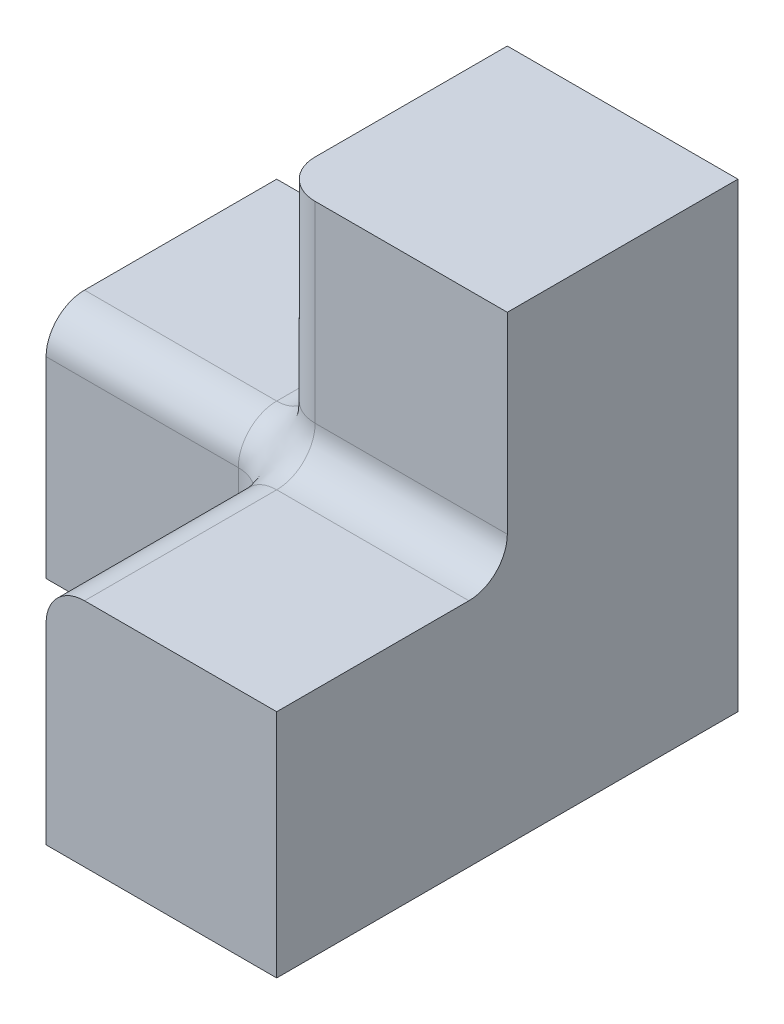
ISO-10303-21;
HEADER;
FILE_DESCRIPTION(('STEP AP214'),'2;1');
FILE_NAME('part.step','',(''),(''),'','','');
FILE_SCHEMA(('AUTOMOTIVE_DESIGN { 1 0 10303 214 1 1 1 1 }'));
ENDSEC;
DATA;
#1=APPLICATION_CONTEXT('core data for automotive mechanical design processes');
#2=APPLICATION_PROTOCOL_DEFINITION('international standard','automotive_design',2000,#1);
#3=PRODUCT_CONTEXT('',#1,'mechanical');
#4=PRODUCT('Part','Part','',(#3));
#5=PRODUCT_RELATED_PRODUCT_CATEGORY('part','',(#4));
#6=PRODUCT_DEFINITION_FORMATION('','',#4);
#7=PRODUCT_DEFINITION_CONTEXT('part definition',#1,'design');
#8=PRODUCT_DEFINITION('design','',#6,#7);
#9=PRODUCT_DEFINITION_SHAPE('','',#8);
#10=(LENGTH_UNIT() NAMED_UNIT(*) SI_UNIT(.MILLI.,.METRE.));
#11=(NAMED_UNIT(*) PLANE_ANGLE_UNIT() SI_UNIT($,.RADIAN.));
#12=(NAMED_UNIT(*) SI_UNIT($,.STERADIAN.) SOLID_ANGLE_UNIT());
#13=UNCERTAINTY_MEASURE_WITH_UNIT(LENGTH_MEASURE(1.E-05),#10,'distance_accuracy_value','');
#14=(GEOMETRIC_REPRESENTATION_CONTEXT(3) GLOBAL_UNCERTAINTY_ASSIGNED_CONTEXT((#13)) GLOBAL_UNIT_ASSIGNED_CONTEXT((#10,
#11,#12)) REPRESENTATION_CONTEXT('',''));
#15=CARTESIAN_POINT('',(0.,0.,0.));
#16=DIRECTION('',(0.,0.,1.));
#17=DIRECTION('',(1.,0.,0.));
#18=AXIS2_PLACEMENT_3D('',#15,#16,#17);
#19=CARTESIAN_POINT('',(-63.5,63.5,0.));
#20=DIRECTION('',(0.,0.,-1.));
#21=DIRECTION('',(-1.,0.,0.));
#22=AXIS2_PLACEMENT_3D('',#19,#20,#21);
#23=CYLINDRICAL_SURFACE('',#22,12.7);
#24=CARTESIAN_POINT('',(-76.2001305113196,63.5001306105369,88.900130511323));
#25=CARTESIAN_POINT('',(-76.1998564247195,63.6182930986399,88.8998607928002));
#26=CARTESIAN_POINT('',(-76.1981078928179,63.7364576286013,88.8997698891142));
#27=CARTESIAN_POINT('',(-76.1915238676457,63.9712600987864,88.8997568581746));
#28=CARTESIAN_POINT('',(-76.1867262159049,64.0878991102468,88.8998326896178));
#29=CARTESIAN_POINT('',(-76.1739907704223,64.3194845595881,88.8999659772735));
#30=CARTESIAN_POINT('',(-76.1660946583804,64.4344332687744,88.9000236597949));
#31=CARTESIAN_POINT('',(-76.1472471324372,64.6625929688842,88.900085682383));
#32=CARTESIAN_POINT('',(-76.1363362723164,64.7758073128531,88.9000906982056));
#33=CARTESIAN_POINT('',(-76.1115941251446,65.0005294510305,88.9000689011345));
#34=CARTESIAN_POINT('',(-76.0977997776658,65.1120413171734,88.9000424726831));
#35=CARTESIAN_POINT('',(-76.0674388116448,65.3334140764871,88.9000010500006));
#36=CARTESIAN_POINT('',(-76.0509049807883,65.4432794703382,88.8999859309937));
#37=CARTESIAN_POINT('',(-76.0151636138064,65.6613914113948,88.8999710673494));
#38=CARTESIAN_POINT('',(-75.9959859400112,65.7696428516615,88.8999711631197));
#39=CARTESIAN_POINT('',(-75.9550323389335,65.9845431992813,88.8999755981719));
#40=CARTESIAN_POINT('',(-75.9332840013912,66.0911973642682,88.8999798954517));
#41=CARTESIAN_POINT('',(-75.8872669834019,66.3029203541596,88.8999891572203));
#42=CARTESIAN_POINT('',(-75.8630236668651,66.4079946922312,88.8999941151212));
#43=CARTESIAN_POINT('',(-75.8120914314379,66.6165718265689,88.9000024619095));
#44=CARTESIAN_POINT('',(-75.7854258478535,66.7200803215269,88.9000058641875));
#45=CARTESIAN_POINT('',(-75.7297223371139,66.9255324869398,88.9000104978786));
#46=CARTESIAN_POINT('',(-75.7007059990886,67.027482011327,88.9000117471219));
#47=CARTESIAN_POINT('',(-75.6403730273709,67.22981241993,88.9000119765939));
#48=CARTESIAN_POINT('',(-75.6090765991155,67.3301993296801,88.900010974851));
#49=CARTESIAN_POINT('',(-75.5442520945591,67.5293978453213,88.900007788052));
#50=CARTESIAN_POINT('',(-75.5107429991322,67.6282156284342,88.9000056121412));
#51=CARTESIAN_POINT('',(-75.4415535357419,67.8242797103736,88.9000011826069));
#52=CARTESIAN_POINT('',(-75.4058907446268,67.9215322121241,88.8999989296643));
#53=CARTESIAN_POINT('',(-75.3324487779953,68.114470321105,88.8999937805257));
#54=CARTESIAN_POINT('',(-75.2946858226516,68.2101621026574,88.8999908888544));
#55=CARTESIAN_POINT('',(-75.217094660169,68.3999836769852,88.899983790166));
#56=CARTESIAN_POINT('',(-75.1772813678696,68.4941195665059,88.8999795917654));
#57=CARTESIAN_POINT('',(-75.0956391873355,68.6808360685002,88.8999709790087));
#58=CARTESIAN_POINT('',(-75.0538239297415,68.7734226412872,88.8999665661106));
#59=CARTESIAN_POINT('',(-74.9682249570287,68.957048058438,88.8999593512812));
#60=CARTESIAN_POINT('',(-74.9244536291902,69.0480926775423,88.8999565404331));
#61=CARTESIAN_POINT('',(-74.8349860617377,69.2286412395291,88.8999539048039));
#62=CARTESIAN_POINT('',(-74.7893010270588,69.3181507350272,88.8999540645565));
#63=CARTESIAN_POINT('',(-74.6960456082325,69.4956348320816,88.8999577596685));
#64=CARTESIAN_POINT('',(-74.6484853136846,69.5836147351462,88.8999612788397));
#65=CARTESIAN_POINT('',(-74.5515148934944,69.758043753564,88.8999708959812));
#66=CARTESIAN_POINT('',(-74.5021138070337,69.8444978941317,88.8999769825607));
#67=CARTESIAN_POINT('',(-74.4014936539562,70.0158778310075,88.8999899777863));
#68=CARTESIAN_POINT('',(-74.3502826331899,70.1008083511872,88.8999968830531));
#69=CARTESIAN_POINT('',(-74.2460715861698,70.2691422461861,88.9000094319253));
#70=CARTESIAN_POINT('',(-74.1930786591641,70.3525500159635,88.9000150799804));
#71=CARTESIAN_POINT('',(-74.0853308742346,70.5178390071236,88.9000235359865));
#72=CARTESIAN_POINT('',(-74.0305822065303,70.5997242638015,88.9000263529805));
#73=CARTESIAN_POINT('',(-73.9193497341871,70.76196934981,88.9000294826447));
#74=CARTESIAN_POINT('',(-73.8628712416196,70.8423328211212,88.9000298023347));
#75=CARTESIAN_POINT('',(-73.7482052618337,71.0015353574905,88.9000297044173));
#76=CARTESIAN_POINT('',(-73.6900222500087,71.0803776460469,88.9000292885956));
#77=CARTESIAN_POINT('',(-73.5719698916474,71.2365358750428,88.9000280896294));
#78=CARTESIAN_POINT('',(-73.5121042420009,71.3138546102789,88.9000273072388));
#79=CARTESIAN_POINT('',(-73.39070680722,71.4669612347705,88.9000251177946));
#80=CARTESIAN_POINT('',(-73.329177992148,71.5427514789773,88.9000237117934));
#81=CARTESIAN_POINT('',(-73.2044725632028,71.6927943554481,88.9000198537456));
#82=CARTESIAN_POINT('',(-73.1412982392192,71.7670488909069,88.9000174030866));
#83=CARTESIAN_POINT('',(-73.0133189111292,71.914011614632,88.9000113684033));
#84=CARTESIAN_POINT('',(-72.9485155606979,71.9867212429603,88.9000077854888));
#85=CARTESIAN_POINT('',(-72.8172946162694,72.1305836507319,88.9000001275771));
#86=CARTESIAN_POINT('',(-72.7508780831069,72.2017373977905,88.8999960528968));
#87=CARTESIAN_POINT('',(-72.6164469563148,72.342475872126,88.8999890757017));
#88=CARTESIAN_POINT('',(-72.5484328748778,72.4120610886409,88.8999861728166));
#89=CARTESIAN_POINT('',(-72.4108227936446,72.5496487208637,88.8999843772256));
#90=CARTESIAN_POINT('',(-72.3412268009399,72.6176511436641,88.8999854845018));
#91=CARTESIAN_POINT('',(-72.2004686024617,72.7520590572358,88.8999897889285));
#92=CARTESIAN_POINT('',(-72.1293059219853,72.8184640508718,88.8999929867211));
#93=CARTESIAN_POINT('',(-71.9854280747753,72.9496626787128,88.9000004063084));
#94=CARTESIAN_POINT('',(-71.9127119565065,73.0144552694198,88.900004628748));
#95=CARTESIAN_POINT('',(-71.7657386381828,73.1424138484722,88.90001340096));
#96=CARTESIAN_POINT('',(-71.6914800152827,73.2055782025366,88.900017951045));
#97=CARTESIAN_POINT('',(-71.5414305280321,73.330263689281,88.9000266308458));
#98=CARTESIAN_POINT('',(-71.4656377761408,73.3917825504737,88.9000307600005));
#99=CARTESIAN_POINT('',(-71.3125259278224,73.5131582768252,88.9000371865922));
#100=CARTESIAN_POINT('',(-71.2352044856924,73.5730121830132,88.9000394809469));
#101=CARTESIAN_POINT('',(-71.0790392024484,73.6910377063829,88.9000409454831));
#102=CARTESIAN_POINT('',(-71.0001925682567,73.7492056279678,88.9000401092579));
#103=CARTESIAN_POINT('',(-70.8409803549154,73.8638386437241,88.9000354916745));
#104=CARTESIAN_POINT('',(-70.7606115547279,73.9202992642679,88.900031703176));
#105=CARTESIAN_POINT('',(-70.5983575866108,74.0314961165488,88.9000222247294));
#106=CARTESIAN_POINT('',(-70.516468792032,74.0862270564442,88.9000165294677));
#107=CARTESIAN_POINT('',(-70.3511762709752,74.1939413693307,88.9000046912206));
#108=CARTESIAN_POINT('',(-70.2677685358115,74.2469185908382,88.899998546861));
#109=CARTESIAN_POINT('',(-70.0994381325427,74.3511000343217,88.8999871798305));
#110=CARTESIAN_POINT('',(-70.0145110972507,74.4022972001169,88.8999819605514));
#111=CARTESIAN_POINT('',(-69.8431404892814,74.5028903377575,88.899973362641));
#112=CARTESIAN_POINT('',(-69.7566922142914,74.552278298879,88.8999699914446));
#113=CARTESIAN_POINT('',(-69.5822759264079,74.6492217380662,88.8999653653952));
#114=CARTESIAN_POINT('',(-69.4943029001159,74.6967681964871,88.89996411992));
#115=CARTESIAN_POINT('',(-69.3168325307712,74.789994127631,88.8999633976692));
#116=CARTESIAN_POINT('',(-69.2273298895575,74.8356635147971,88.899963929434));
#117=CARTESIAN_POINT('',(-69.0467947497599,74.9250976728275,88.899966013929));
#118=CARTESIAN_POINT('',(-68.9557566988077,74.9688512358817,88.8999675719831));
#119=CARTESIAN_POINT('',(-68.7721447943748,75.0544132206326,88.8999709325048));
#120=CARTESIAN_POINT('',(-68.6795651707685,75.0962092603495,88.899972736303));
#121=CARTESIAN_POINT('',(-68.4928643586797,75.177813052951,88.8999761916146));
#122=CARTESIAN_POINT('',(-68.3987372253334,75.2176072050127,88.8999778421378));
#123=CARTESIAN_POINT('',(-68.2089362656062,75.2951616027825,88.8999812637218));
#124=CARTESIAN_POINT('',(-68.1132563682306,75.3329069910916,88.8999830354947));
#125=CARTESIAN_POINT('',(-67.9203454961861,75.4063155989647,88.899987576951));
#126=CARTESIAN_POINT('',(-67.8231083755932,75.4419626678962,88.8999903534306));
#127=CARTESIAN_POINT('',(-67.6270789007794,75.5111229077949,88.8999977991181));
#128=CARTESIAN_POINT('',(-67.5282803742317,75.5446185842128,88.9000024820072));
#129=CARTESIAN_POINT('',(-67.3291242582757,75.6094189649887,88.9000129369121));
#130=CARTESIAN_POINT('',(-67.2287605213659,75.6407047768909,88.9000187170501));
#131=CARTESIAN_POINT('',(-67.026477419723,75.7010167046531,88.9000276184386));
#132=CARTESIAN_POINT('',(-66.924552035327,75.7300226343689,88.9000307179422));
#133=CARTESIAN_POINT('',(-66.7191434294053,75.7856979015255,88.9000269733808));
#134=CARTESIAN_POINT('',(-66.6156543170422,75.8123455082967,88.9000200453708));
#135=CARTESIAN_POINT('',(-66.4071137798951,75.8632376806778,88.8999998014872));
#136=CARTESIAN_POINT('',(-66.3020566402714,75.8874588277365,88.899986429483));
#137=CARTESIAN_POINT('',(-66.0903730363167,75.9334356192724,88.8999634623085));
#138=CARTESIAN_POINT('',(-65.9837410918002,75.9551660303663,88.8999539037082));
#139=CARTESIAN_POINT('',(-65.7688939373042,75.9960936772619,88.8999475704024));
#140=CARTESIAN_POINT('',(-65.6606735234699,76.0152635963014,88.8999509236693));
#141=CARTESIAN_POINT('',(-65.4426249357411,76.0509892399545,88.8999714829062));
#142=CARTESIAN_POINT('',(-65.332791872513,76.0675151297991,88.8999888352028));
#143=CARTESIAN_POINT('',(-65.1114826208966,76.0978535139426,88.9000270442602));
#144=CARTESIAN_POINT('',(-65.0000019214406,76.1116331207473,88.9000479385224));
#145=CARTESIAN_POINT('',(-64.7753573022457,76.136362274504,88.9000734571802));
#146=CARTESIAN_POINT('',(-64.6621893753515,76.1472754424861,88.9000778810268));
#147=CARTESIAN_POINT('',(-64.4341409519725,76.166150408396,88.9000558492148));
#148=CARTESIAN_POINT('',(-64.3192571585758,76.1740724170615,88.9000289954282));
#149=CARTESIAN_POINT('',(-64.0877869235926,76.1868533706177,88.8999496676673));
#150=CARTESIAN_POINT('',(-63.9711981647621,76.191670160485,88.8998968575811));
#151=CARTESIAN_POINT('',(-63.7364065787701,76.1982066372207,88.8998653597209));
#152=CARTESIAN_POINT('',(-63.6182025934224,76.1998849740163,88.8998876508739));
#153=CARTESIAN_POINT('',(-63.5000001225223,76.2000001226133,88.9000001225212));
#154=B_SPLINE_CURVE_WITH_KNOTS('',3,(#24,#25,#26,#27,#28,#29,#30,#31,#32,#33,#34,#35,#36,#37,
#38,#39,#40,#41,#42,#43,#44,#45,#46,#47,#48,#49,#50,#51,#52,#53,#54,#55,#56,#57,#58,#59,#60,#61,
#62,#63,#64,#65,#66,#67,#68,#69,#70,#71,#72,#73,#74,#75,#76,#77,#78,#79,#80,#81,#82,#83,#84,#85,
#86,#87,#88,#89,#90,#91,#92,#93,#94,#95,#96,#97,#98,#99,#100,#101,#102,#103,#104,#105,#106,#107,
#108,#109,#110,#111,#112,#113,#114,#115,#116,#117,#118,#119,#120,#121,#122,#123,#124,#125,#126,
#127,#128,#129,#130,#131,#132,#133,#134,#135,#136,#137,#138,#139,#140,#141,#142,#143,#144,#145,
#146,#147,#148,#149,#150,#151,#152,#153),.UNSPECIFIED.,.F.,.F.,(4,2,2,2,2,2,2,2,2,2,2,2,2,2,2,2,
2,2,2,2,2,2,2,2,2,2,2,2,2,2,2,2,2,2,2,2,2,2,2,2,2,2,2,2,2,2,2,2,2,2,2,2,2,2,2,2,2,2,2,2,2,2,2,2,
4),(0.,0.354487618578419,0.704659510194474,1.05027390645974,1.39144829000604,1.72849393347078,
2.06176380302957,2.39153813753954,2.71804909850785,3.04151862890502,3.36214876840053,
3.68011065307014,3.9955350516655,4.30853747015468,4.61926193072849,4.92785201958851,
5.23444893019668,5.5391935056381,5.84222493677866,6.14367910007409,6.44368792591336,
6.74237947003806,7.03987847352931,7.33630715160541,7.63178593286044,7.92643383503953,
8.22036737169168,8.51369904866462,8.80653761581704,9.09898840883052,9.39115344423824,
9.68313129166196,9.97501677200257,10.2669009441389,10.5588748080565,10.8510329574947,
11.1434737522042,11.4362993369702,11.7296158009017,12.0235328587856,12.3181629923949,
12.6136211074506,12.9100245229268,13.207493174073,13.5061499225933,13.8061208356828,
14.1075352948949,14.4105258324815,14.7152276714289,15.0217780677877,15.3303157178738,
15.6409806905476,15.9539155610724,16.2692641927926,16.587147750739,16.9077079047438,
17.2311122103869,17.5575473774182,17.8872262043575,18.2203963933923,18.5573439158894,
18.8983810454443,19.2438070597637,19.5938288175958,19.9484305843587),.UNSPECIFIED.);
#155=CARTESIAN_POINT('',(-63.5000000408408,76.2000000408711,88.9000000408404));
#156=VERTEX_POINT('',#155);
#157=CARTESIAN_POINT('',(-76.2000652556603,63.5000653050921,88.900065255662));
#158=VERTEX_POINT('',#157);
#159=EDGE_CURVE('E369',#156,#158,#154,.F.);
#160=ORIENTED_EDGE('',*,*,#159,.T.);
#161=DIRECTION('',(0.,0.,1.));
#162=VECTOR('',#161,1.);
#163=CARTESIAN_POINT('',(-76.2,63.5,88.9));
#164=LINE('',#163,#162);
#165=CARTESIAN_POINT('',(-76.2,63.5,152.4));
#166=VERTEX_POINT('',#165);
#167=EDGE_CURVE('E269',#166,#158,#164,.F.);
#168=ORIENTED_EDGE('',*,*,#167,.F.);
#169=CARTESIAN_POINT('',(-63.5,63.5,152.4));
#170=DIRECTION('',(0.,0.,-1.));
#171=DIRECTION('',(-1.,0.,0.));
#172=AXIS2_PLACEMENT_3D('',#169,#170,#171);
#173=CIRCLE('',#172,12.7);
#174=CARTESIAN_POINT('',(-63.5,76.2,152.4));
#175=VERTEX_POINT('',#174);
#176=EDGE_CURVE('E267',#175,#166,#173,.F.);
#177=ORIENTED_EDGE('',*,*,#176,.F.);
#178=DIRECTION('',(0.,0.,1.));
#179=VECTOR('',#178,1.);
#180=CARTESIAN_POINT('',(-63.5,76.2,152.4));
#181=LINE('',#180,#179);
#182=EDGE_CURVE('E266',#156,#175,#181,.T.);
#183=ORIENTED_EDGE('',*,*,#182,.F.);
#184=EDGE_LOOP('',(#160,#168,#177,#183));
#185=FACE_BOUND('',#184,.T.);
#186=ADVANCED_FACE('F89',(#185),#23,.T.);
#187=CARTESIAN_POINT('',(0.,63.5,63.5));
#188=DIRECTION('',(-1.,0.,0.));
#189=DIRECTION('',(0.,0.,1.));
#190=AXIS2_PLACEMENT_3D('',#187,#188,#189);
#191=CYLINDRICAL_SURFACE('',#190,12.7);
#192=CARTESIAN_POINT('',(-88.9000491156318,76.2000491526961,63.5000491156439));
#193=CARTESIAN_POINT('',(-88.8998594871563,76.1998548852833,63.6182265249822));
#194=CARTESIAN_POINT('',(-88.8998288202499,76.1981684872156,63.7364073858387));
#195=CARTESIAN_POINT('',(-88.8998900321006,76.191663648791,63.9711991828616));
#196=CARTESIAN_POINT('',(-88.8999803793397,76.1868847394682,64.0878112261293));
#197=CARTESIAN_POINT('',(-88.900092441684,76.1741366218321,64.319303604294));
#198=CARTESIAN_POINT('',(-88.9001150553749,76.1662107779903,64.4341863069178));
#199=CARTESIAN_POINT('',(-88.9001055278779,76.1473037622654,64.6622105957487));
#200=CARTESIAN_POINT('',(-88.9000740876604,76.1363632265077,64.7753555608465));
#201=CARTESIAN_POINT('',(-88.9000003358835,76.1115851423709,64.9999581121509));
#202=CARTESIAN_POINT('',(-88.8999581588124,76.0977837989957,65.111419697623));
#203=CARTESIAN_POINT('',(-88.8999010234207,76.0674264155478,65.3327110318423));
#204=CARTESIAN_POINT('',(-88.8998857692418,76.0509025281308,65.4425451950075));
#205=CARTESIAN_POINT('',(-88.8998891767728,76.015201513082,65.6606141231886));
#206=CARTESIAN_POINT('',(-88.8999074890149,75.9960536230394,65.7688536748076));
#207=CARTESIAN_POINT('',(-88.8999605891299,75.9551737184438,65.9837428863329));
#208=CARTESIAN_POINT('',(-88.8999952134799,75.9334689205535,66.090397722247));
#209=CARTESIAN_POINT('',(-88.9000560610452,75.8875307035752,66.3021163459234));
#210=CARTESIAN_POINT('',(-88.9000823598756,75.8633228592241,66.4071856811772));
#211=CARTESIAN_POINT('',(-88.9001103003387,75.8124384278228,66.6157340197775));
#212=CARTESIAN_POINT('',(-88.9001121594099,75.7857857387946,66.7192188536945));
#213=CARTESIAN_POINT('',(-88.9000938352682,75.7300877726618,66.924607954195));
#214=CARTESIAN_POINT('',(-88.9000738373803,75.7010645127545,67.0265181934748));
#215=CARTESIAN_POINT('',(-88.9000350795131,75.6407221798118,67.228773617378));
#216=CARTESIAN_POINT('',(-88.9000163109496,75.6094232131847,67.3291248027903));
#217=CARTESIAN_POINT('',(-88.8999886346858,75.5446056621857,67.5282637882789));
#218=CARTESIAN_POINT('',(-88.8999796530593,75.5111057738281,67.6270576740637));
#219=CARTESIAN_POINT('',(-88.899969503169,75.4419431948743,67.8230836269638));
#220=CARTESIAN_POINT('',(-88.8999682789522,75.4062978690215,67.9203218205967));
#221=CARTESIAN_POINT('',(-88.8999680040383,75.3328939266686,68.1132361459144));
#222=CARTESIAN_POINT('',(-88.8999689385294,75.2951514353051,68.208918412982));
#223=CARTESIAN_POINT('',(-88.8999686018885,75.2176004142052,68.3987220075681));
#224=CARTESIAN_POINT('',(-88.8999673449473,75.1778067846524,68.4928494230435));
#225=CARTESIAN_POINT('',(-88.899961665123,75.0962009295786,68.6795479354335));
#226=CARTESIAN_POINT('',(-88.8999572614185,75.0544023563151,68.7721249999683));
#227=CARTESIAN_POINT('',(-88.8999477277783,74.9688343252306,68.9557307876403));
#228=CARTESIAN_POINT('',(-88.8999426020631,74.9250772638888,69.0467652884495));
#229=CARTESIAN_POINT('',(-88.8999353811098,74.8356382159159,69.2272951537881));
#230=CARTESIAN_POINT('',(-88.8999332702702,74.7899674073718,69.3167960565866));
#231=CARTESIAN_POINT('',(-88.8999343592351,74.6967423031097,69.4942662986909));
#232=CARTESIAN_POINT('',(-88.8999375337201,74.6491980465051,69.5822409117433));
#233=CARTESIAN_POINT('',(-88.8999486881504,74.5522617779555,69.7566629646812));
#234=CARTESIAN_POINT('',(-88.8999566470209,74.5028787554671,69.8431154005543));
#235=CARTESIAN_POINT('',(-88.8999745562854,74.4022956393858,70.0144944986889));
#236=CARTESIAN_POINT('',(-88.8999844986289,74.3511035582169,70.0994258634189));
#237=CARTESIAN_POINT('',(-88.9000028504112,74.2469297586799,70.2677625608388));
#238=CARTESIAN_POINT('',(-88.9000112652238,74.1939551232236,70.3511722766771));
#239=CARTESIAN_POINT('',(-88.9000240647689,74.0862423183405,70.5164652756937));
#240=CARTESIAN_POINT('',(-88.9000284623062,74.0315103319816,70.5983525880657));
#241=CARTESIAN_POINT('',(-88.9000328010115,73.9203087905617,70.7606010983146));
#242=CARTESIAN_POINT('',(-88.9000327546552,73.8638445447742,70.8409659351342));
#243=CARTESIAN_POINT('',(-88.9000297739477,73.7492043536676,71.0001702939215));
#244=CARTESIAN_POINT('',(-88.9000268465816,73.6910328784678,71.0790130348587));
#245=CARTESIAN_POINT('',(-88.9000205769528,73.573003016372,71.2351732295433));
#246=CARTESIAN_POINT('',(-88.9000172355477,73.5131483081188,71.3124934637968));
#247=CARTESIAN_POINT('',(-88.9000118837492,73.3917741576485,71.4656060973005));
#248=CARTESIAN_POINT('',(-88.9000098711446,73.3302576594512,71.5414008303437));
#249=CARTESIAN_POINT('',(-88.9000072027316,73.2055786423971,71.6914561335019));
#250=CARTESIAN_POINT('',(-88.9000065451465,73.1424183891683,71.7657185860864));
#251=CARTESIAN_POINT('',(-88.9000055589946,73.014467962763,71.9126996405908));
#252=CARTESIAN_POINT('',(-88.9000052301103,72.9496794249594,71.9854196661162));
#253=CARTESIAN_POINT('',(-88.9000039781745,72.8184872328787,72.1293037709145));
#254=CARTESIAN_POINT('',(-88.9000030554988,72.7520846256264,72.2004688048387));
#255=CARTESIAN_POINT('',(-88.9000010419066,72.6176791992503,72.3412294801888));
#256=CARTESIAN_POINT('',(-88.8999999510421,72.5496768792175,72.4108255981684));
#257=CARTESIAN_POINT('',(-88.9000000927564,72.4120877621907,72.5484342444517));
#258=CARTESIAN_POINT('',(-88.9000013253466,72.3425009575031,72.6164467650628));
#259=CARTESIAN_POINT('',(-88.9000042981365,72.2017586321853,72.7508741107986));
#260=CARTESIAN_POINT('',(-88.9000060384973,72.1306026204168,72.8172884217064));
#261=CARTESIAN_POINT('',(-88.9000096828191,71.9867363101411,72.9485055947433));
#262=CARTESIAN_POINT('',(-88.9000115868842,71.9140250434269,73.0133073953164));
#263=CARTESIAN_POINT('',(-88.9000158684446,71.7670605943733,73.1412852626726));
#264=CARTESIAN_POINT('',(-88.9000182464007,71.6928059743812,73.2044596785));
#265=CARTESIAN_POINT('',(-88.9000236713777,71.5427645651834,73.3291670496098));
#266=CARTESIAN_POINT('',(-88.9000267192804,71.4669758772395,73.3906977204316));
#267=CARTESIAN_POINT('',(-88.900033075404,71.313873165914,73.5120997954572));
#268=CARTESIAN_POINT('',(-88.9000363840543,71.2365567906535,73.5719682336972));
#269=CARTESIAN_POINT('',(-88.9000421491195,71.0804027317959,73.6900257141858));
#270=CARTESIAN_POINT('',(-88.9000446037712,71.0015622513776,73.7482110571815));
#271=CARTESIAN_POINT('',(-88.9000471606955,70.8423617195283,73.8628800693));
#272=CARTESIAN_POINT('',(-88.9000472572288,70.7619984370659,73.9193592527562));
#273=CARTESIAN_POINT('',(-88.9000438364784,70.5997525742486,74.0305920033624));
#274=CARTESIAN_POINT('',(-88.9000403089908,70.5178663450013,74.0853402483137));
#275=CARTESIAN_POINT('',(-88.9000295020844,70.3525744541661,74.1930862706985));
#276=CARTESIAN_POINT('',(-88.9000222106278,70.2691647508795,74.2460778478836));
#277=CARTESIAN_POINT('',(-88.900005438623,70.1008260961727,74.3502852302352));
#278=CARTESIAN_POINT('',(-88.8999959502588,70.0158927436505,74.4014939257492));
#279=CARTESIAN_POINT('',(-88.8999777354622,69.8445071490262,74.5021093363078));
#280=CARTESIAN_POINT('',(-88.8999690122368,69.7580501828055,74.5515080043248));
#281=CARTESIAN_POINT('',(-88.8999555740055,69.5836169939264,74.6484750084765));
#282=CARTESIAN_POINT('',(-88.8999508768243,69.4956357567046,74.6960343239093));
#283=CARTESIAN_POINT('',(-88.8999475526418,69.3181516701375,74.7892905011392));
#284=CARTESIAN_POINT('',(-88.8999489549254,69.2286435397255,74.8349773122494));
#285=CARTESIAN_POINT('',(-88.899957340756,69.0481002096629,74.924451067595));
#286=CARTESIAN_POINT('',(-88.8999643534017,68.957059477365,74.9682268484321));
#287=CARTESIAN_POINT('',(-88.8999804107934,68.7734420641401,75.0538352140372));
#288=CARTESIAN_POINT('',(-88.8999894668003,68.6808596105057,75.09565541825));
#289=CARTESIAN_POINT('',(-88.9000029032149,68.4941467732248,75.1773030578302));
#290=CARTESIAN_POINT('',(-88.9000072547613,68.4000103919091,75.2171167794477));
#291=CARTESIAN_POINT('',(-88.9000045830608,68.2101789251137,75.2946983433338));
#292=CARTESIAN_POINT('',(-88.8999974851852,68.1144776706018,75.332451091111));
#293=CARTESIAN_POINT('',(-88.899980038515,67.9215184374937,75.4058699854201));
#294=CARTESIAN_POINT('',(-88.899969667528,67.8242542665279,75.4415198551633));
#295=CARTESIAN_POINT('',(-88.8999562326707,67.6281738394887,75.5106909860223));
#296=CARTESIAN_POINT('',(-88.8999532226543,67.529351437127,75.5441948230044));
#297=CARTESIAN_POINT('',(-88.8999578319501,67.3301547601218,75.609020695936));
#298=CARTESIAN_POINT('',(-88.8999655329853,67.2297743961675,75.6403240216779));
#299=CARTESIAN_POINT('',(-88.899987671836,67.0274653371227,75.7006797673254));
#300=CARTESIAN_POINT('',(-88.9000021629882,66.9255306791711,75.7297122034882));
#301=CARTESIAN_POINT('',(-88.9000296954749,66.720108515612,75.7854485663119));
#302=CARTESIAN_POINT('',(-88.9000427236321,66.6166151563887,75.8121309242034));
#303=CARTESIAN_POINT('',(-88.9000579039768,66.4080591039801,75.8630873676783));
#304=CARTESIAN_POINT('',(-88.9000599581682,66.302990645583,75.8873378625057));
#305=CARTESIAN_POINT('',(-88.9000485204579,66.0912639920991,75.9333530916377));
#306=CARTESIAN_POINT('',(-88.9000348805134,65.9846001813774,75.9550919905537));
#307=CARTESIAN_POINT('',(-88.899996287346,65.769667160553,75.9960112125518));
#308=CARTESIAN_POINT('',(-88.8999712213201,65.6613926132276,76.0151634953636));
#309=CARTESIAN_POINT('',(-88.8999373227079,65.4432371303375,76.0508553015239));
#310=CARTESIAN_POINT('',(-88.8999286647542,65.3333513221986,76.0673650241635));
#311=CARTESIAN_POINT('',(-88.8999490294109,65.1119611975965,76.0977044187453));
#312=CARTESIAN_POINT('',(-88.899978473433,65.0004525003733,76.11150213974));
#313=CARTESIAN_POINT('',(-88.9000340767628,64.7757615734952,76.1362783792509));
#314=CARTESIAN_POINT('',(-88.9000601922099,64.6625753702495,76.1472209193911));
#315=CARTESIAN_POINT('',(-88.9000688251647,64.4344777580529,76.1661398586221));
#316=CARTESIAN_POINT('',(-88.9000507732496,64.3195630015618,76.1740759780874));
#317=CARTESIAN_POINT('',(-88.8999695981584,64.0880155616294,76.1868641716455));
#318=CARTESIAN_POINT('',(-88.8999058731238,63.9713805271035,76.1916734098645));
#319=CARTESIAN_POINT('',(-88.8998678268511,63.73650962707,76.1982073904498));
#320=CARTESIAN_POINT('',(-88.8998946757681,63.6182726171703,76.1998913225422));
#321=CARTESIAN_POINT('',(-88.9000378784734,63.5000379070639,76.2000378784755));
#322=B_SPLINE_CURVE_WITH_KNOTS('',3,(#192,#193,#194,#195,#196,#197,#198,#199,#200,#201,#202,
#203,#204,#205,#206,#207,#208,#209,#210,#211,#212,#213,#214,#215,#216,#217,#218,#219,#220,#221,
#222,#223,#224,#225,#226,#227,#228,#229,#230,#231,#232,#233,#234,#235,#236,#237,#238,#239,#240,
#241,#242,#243,#244,#245,#246,#247,#248,#249,#250,#251,#252,#253,#254,#255,#256,#257,#258,#259,
#260,#261,#262,#263,#264,#265,#266,#267,#268,#269,#270,#271,#272,#273,#274,#275,#276,#277,#278,
#279,#280,#281,#282,#283,#284,#285,#286,#287,#288,#289,#290,#291,#292,#293,#294,#295,#296,#297,
#298,#299,#300,#301,#302,#303,#304,#305,#306,#307,#308,#309,#310,#311,#312,#313,#314,#315,#316,
#317,#318,#319,#320,#321),.UNSPECIFIED.,.F.,.F.,(4,2,2,2,2,2,2,2,2,2,2,2,2,2,2,2,2,2,2,2,2,2,2,
2,2,2,2,2,2,2,2,2,2,2,2,2,2,2,2,2,2,2,2,2,2,2,2,2,2,2,2,2,2,2,2,2,2,2,2,2,2,2,2,2,4),(0.,
0.354532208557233,0.704619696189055,1.05004171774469,1.39101802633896,1.72791714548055,
2.06109043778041,2.39081466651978,2.71730166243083,3.040732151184,3.36128313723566,
3.67913711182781,3.99446180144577,4.30738779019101,4.61805409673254,4.92659514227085,
5.23314560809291,5.53784350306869,5.84082900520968,6.14224085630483,6.44221292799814,
6.74087321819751,7.03834507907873,7.33474924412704,7.63020529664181,7.92483190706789,
8.21874594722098,8.51206112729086,8.80488694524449,9.09732855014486,9.38948733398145,
9.68146140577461,9.97334556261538,10.2652311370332,10.557209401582,10.8493750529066,
11.1418262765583,11.4346647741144,11.72799598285,12.0219292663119,12.3165778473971,
12.6120583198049,12.9084896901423,13.2059923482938,13.5046876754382,13.8046986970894,
14.106151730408,14.4091785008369,14.7139178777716,15.0205163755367,15.3291214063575,
15.6398654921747,15.9528763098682,16.2682884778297,16.5862208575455,16.9068194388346,
17.2302761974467,17.556809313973,17.8866383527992,18.2199584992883,18.5569968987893,
18.8980969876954,19.2436177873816,19.5937774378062,19.9484781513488),.UNSPECIFIED.);
#323=CARTESIAN_POINT('',(-88.9000189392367,63.500018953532,76.2000189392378));
#324=VERTEX_POINT('',#323);
#325=CARTESIAN_POINT('',(-88.9000245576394,76.2000245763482,63.5000245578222));
#326=VERTEX_POINT('',#325);
#327=EDGE_CURVE('E434',#324,#326,#322,.F.);
#328=ORIENTED_EDGE('',*,*,#327,.T.);
#329=DIRECTION('',(1.,0.,0.));
#330=VECTOR('',#329,1.);
#331=CARTESIAN_POINT('',(-88.9,76.2,63.5));
#332=LINE('',#331,#330);
#333=CARTESIAN_POINT('',(-152.4,76.2,63.5));
#334=VERTEX_POINT('',#333);
#335=EDGE_CURVE('E476',#334,#326,#332,.T.);
#336=ORIENTED_EDGE('',*,*,#335,.F.);
#337=CARTESIAN_POINT('',(-152.4,63.5,63.5));
#338=DIRECTION('',(1.,0.,0.));
#339=DIRECTION('',(0.,0.,-1.));
#340=AXIS2_PLACEMENT_3D('',#337,#338,#339);
#341=CIRCLE('',#340,12.7);
#342=CARTESIAN_POINT('',(-152.4,63.5,76.2));
#343=VERTEX_POINT('',#342);
#344=EDGE_CURVE('E270',#343,#334,#341,.F.);
#345=ORIENTED_EDGE('',*,*,#344,.F.);
#346=DIRECTION('',(1.,0.,0.));
#347=VECTOR('',#346,1.);
#348=CARTESIAN_POINT('',(-152.4,63.5,76.2));
#349=LINE('',#348,#347);
#350=EDGE_CURVE('E272',#324,#343,#349,.F.);
#351=ORIENTED_EDGE('',*,*,#350,.F.);
#352=EDGE_LOOP('',(#328,#336,#345,#351));
#353=FACE_BOUND('',#352,.T.);
#354=ADVANCED_FACE('F91',(#353),#191,.T.);
#355=CARTESIAN_POINT('',(0.,88.9,88.9));
#356=DIRECTION('',(1.,0.,0.));
#357=DIRECTION('',(0.,0.,-1.));
#358=AXIS2_PLACEMENT_3D('',#355,#356,#357);
#359=CYLINDRICAL_SURFACE('',#358,12.7);
#360=CARTESIAN_POINT('',(-63.5000001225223,76.2000001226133,88.9000001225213));
#361=CARTESIAN_POINT('',(-63.5001167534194,76.200119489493,88.7817991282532));
#362=CARTESIAN_POINT('',(-63.5001400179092,76.2017988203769,88.6635966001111));
#363=CARTESIAN_POINT('',(-63.5001069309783,76.2083336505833,88.4288044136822));
#364=CARTESIAN_POINT('',(-63.5000516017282,76.2131479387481,88.3122136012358));
#365=CARTESIAN_POINT('',(-63.4999665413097,76.2259231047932,88.0807386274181));
#366=CARTESIAN_POINT('',(-63.4999364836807,76.2338418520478,87.9658521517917));
#367=CARTESIAN_POINT('',(-63.4999108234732,76.2527131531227,87.737800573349));
#368=CARTESIAN_POINT('',(-63.4999147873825,76.2636258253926,87.6246321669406));
#369=CARTESIAN_POINT('',(-63.4999421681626,76.2883568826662,87.3999890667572));
#370=CARTESIAN_POINT('',(-63.4999653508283,76.3021387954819,87.2885103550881));
#371=CARTESIAN_POINT('',(-63.5000088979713,76.3324826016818,87.0672058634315));
#372=CARTESIAN_POINT('',(-63.5000292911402,76.3490115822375,86.9573755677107));
#373=CARTESIAN_POINT('',(-63.5000546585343,76.3847420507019,86.7393316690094));
#374=CARTESIAN_POINT('',(-63.5000597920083,76.4039137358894,86.6311131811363));
#375=CARTESIAN_POINT('',(-63.5000567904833,76.4448446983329,86.4162694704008));
#376=CARTESIAN_POINT('',(-63.5000487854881,76.4665766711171,86.3096390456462));
#377=CARTESIAN_POINT('',(-63.500028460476,76.5125562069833,86.0979576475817));
#378=CARTESIAN_POINT('',(-63.5000161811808,76.5367785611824,85.9929011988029));
#379=CARTESIAN_POINT('',(-63.499994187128,76.5876690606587,85.7843585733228));
#380=CARTESIAN_POINT('',(-63.499984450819,76.6143138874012,85.6808667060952));
#381=CARTESIAN_POINT('',(-63.4999711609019,76.6699793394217,85.4754494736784));
#382=CARTESIAN_POINT('',(-63.499967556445,76.6989783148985,85.3735182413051));
#383=CARTESIAN_POINT('',(-63.4999669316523,76.75928045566,85.1712265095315));
#384=CARTESIAN_POINT('',(-63.4999698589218,76.7905633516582,85.0708599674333));
#385=CARTESIAN_POINT('',(-63.499979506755,76.8553630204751,84.8717027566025));
#386=CARTESIAN_POINT('',(-63.4999861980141,76.8888607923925,84.772905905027));
#387=CARTESIAN_POINT('',(-63.4999995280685,76.958027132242,84.5768817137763));
#388=CARTESIAN_POINT('',(-63.5000061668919,76.993678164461,84.4796481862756));
#389=CARTESIAN_POINT('',(-63.5000174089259,77.067093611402,84.2867436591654));
#390=CARTESIAN_POINT('',(-63.5000220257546,77.1048418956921,84.1910665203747));
#391=CARTESIAN_POINT('',(-63.5000288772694,77.1823997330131,84.0012689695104));
#392=CARTESIAN_POINT('',(-63.5000311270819,77.2221944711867,83.9071425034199));
#393=CARTESIAN_POINT('',(-63.5000340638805,77.3037976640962,83.7204413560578));
#394=CARTESIAN_POINT('',(-63.500034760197,77.3455925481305,83.6278607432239));
#395=CARTESIAN_POINT('',(-63.5000356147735,77.4311519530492,83.4442464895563));
#396=CARTESIAN_POINT('',(-63.5000357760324,77.4749040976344,83.3532070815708));
#397=CARTESIAN_POINT('',(-63.5000353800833,77.564335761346,83.1726694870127));
#398=CARTESIAN_POINT('',(-63.500034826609,77.6100040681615,83.0831657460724));
#399=CARTESIAN_POINT('',(-63.5000320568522,77.7032279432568,82.9056933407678));
#400=CARTESIAN_POINT('',(-63.500029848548,77.7507734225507,82.817719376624));
#401=CARTESIAN_POINT('',(-63.5000238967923,77.8477155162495,82.6433017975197));
#402=CARTESIAN_POINT('',(-63.5000201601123,77.8971031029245,82.5568531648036));
#403=CARTESIAN_POINT('',(-63.5000117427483,77.9976964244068,82.3854827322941));
#404=CARTESIAN_POINT('',(-63.5000070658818,78.0488941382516,82.300556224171));
#405=CARTESIAN_POINT('',(-63.4999975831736,78.153077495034,82.1322276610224));
#406=CARTESIAN_POINT('',(-63.4999927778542,78.2060560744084,82.0488212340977));
#407=CARTESIAN_POINT('',(-63.4999838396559,78.313773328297,81.8835315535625));
#408=CARTESIAN_POINT('',(-63.4999797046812,78.3685058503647,81.8016442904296));
#409=CARTESIAN_POINT('',(-63.4999727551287,78.4797052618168,81.6393928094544));
#410=CARTESIAN_POINT('',(-63.4999699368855,78.5361668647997,81.5590249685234));
#411=CARTESIAN_POINT('',(-63.4999660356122,78.6508005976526,81.3998134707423));
#412=CARTESIAN_POINT('',(-63.4999649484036,78.708968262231,81.3209665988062));
#413=CARTESIAN_POINT('',(-63.4999646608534,78.8269919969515,81.1647996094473));
#414=CARTESIAN_POINT('',(-63.4999654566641,78.8868443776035,81.0874767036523));
#415=CARTESIAN_POINT('',(-63.4999688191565,79.0082169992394,80.9343618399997));
#416=CARTESIAN_POINT('',(-63.4999713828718,79.0697342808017,80.8585675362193));
#417=CARTESIAN_POINT('',(-63.4999778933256,79.1944175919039,80.7085158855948));
#418=CARTESIAN_POINT('',(-63.4999818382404,79.2575813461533,80.6342566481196));
#419=CARTESIAN_POINT('',(-63.4999904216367,79.3855397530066,80.4872831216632));
#420=CARTESIAN_POINT('',(-63.4999950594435,79.4503327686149,80.4145674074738));
#421=CARTESIAN_POINT('',(-63.5000039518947,79.5815328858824,80.2706910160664));
#422=CARTESIAN_POINT('',(-63.500008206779,79.6479389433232,80.1995293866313));
#423=CARTESIAN_POINT('',(-63.5000147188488,79.7823490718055,80.0587733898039));
#424=CARTESIAN_POINT('',(-63.500016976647,79.8503526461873,79.989178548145));
#425=CARTESIAN_POINT('',(-63.5000170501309,79.9879421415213,79.8515703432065));
#426=CARTESIAN_POINT('',(-63.5000148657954,80.0575280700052,79.7835569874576));
#427=CARTESIAN_POINT('',(-63.5000082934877,80.1982669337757,79.649126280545));
#428=CARTESIAN_POINT('',(-63.5000039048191,80.2694203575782,79.5827094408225));
#429=CARTESIAN_POINT('',(-63.4999946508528,80.4132811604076,79.4514869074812));
#430=CARTESIAN_POINT('',(-63.4999897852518,80.485989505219,79.3866822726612));
#431=CARTESIAN_POINT('',(-63.4999808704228,80.6329493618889,79.2587000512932));
#432=CARTESIAN_POINT('',(-63.4999768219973,80.7072023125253,79.1955241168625));
#433=CARTESIAN_POINT('',(-63.499970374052,80.8572426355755,79.0708160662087));
#434=CARTESIAN_POINT('',(-63.4999679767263,80.9330319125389,79.0092862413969));
#435=CARTESIAN_POINT('',(-63.4999652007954,81.0861379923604,78.8878881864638));
#436=CARTESIAN_POINT('',(-63.4999648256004,81.1634571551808,78.8280229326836));
#437=CARTESIAN_POINT('',(-63.499966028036,81.3196177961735,78.7099729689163));
#438=CARTESIAN_POINT('',(-63.4999676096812,81.3984620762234,78.6517919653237));
#439=CARTESIAN_POINT('',(-63.4999723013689,81.5576693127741,78.5371308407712));
#440=CARTESIAN_POINT('',(-63.4999754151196,81.6380354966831,78.4806552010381));
#441=CARTESIAN_POINT('',(-63.4999825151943,81.8002844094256,78.369426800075));
#442=CARTESIAN_POINT('',(-63.4999865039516,81.8821707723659,78.3146793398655));
#443=CARTESIAN_POINT('',(-63.4999946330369,82.0474593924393,78.2069312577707));
#444=CARTESIAN_POINT('',(-63.4999987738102,82.1308656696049,78.1539368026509));
#445=CARTESIAN_POINT('',(-63.5000065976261,82.2991949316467,78.0497209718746));
#446=CARTESIAN_POINT('',(-63.5000102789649,82.3841223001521,77.9985066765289));
#447=CARTESIAN_POINT('',(-63.5000168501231,82.5554959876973,77.8978799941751));
#448=CARTESIAN_POINT('',(-63.5000197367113,82.6419470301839,77.8484756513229));
#449=CARTESIAN_POINT('',(-63.500024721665,82.8163716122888,77.7515004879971));
#450=CARTESIAN_POINT('',(-63.5000268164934,82.9043501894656,77.7039387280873));
#451=CARTESIAN_POINT('',(-63.5000306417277,83.0818345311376,77.6106833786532));
#452=CARTESIAN_POINT('',(-63.5000323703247,83.1713456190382,77.5649999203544));
#453=CARTESIAN_POINT('',(-63.5000356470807,83.3518999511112,77.4755383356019));
#454=CARTESIAN_POINT('',(-63.5000371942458,83.4429487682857,77.431771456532));
#455=CARTESIAN_POINT('',(-63.500038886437,83.6265826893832,77.3461815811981));
#456=CARTESIAN_POINT('',(-63.5000390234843,83.719173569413,77.3043709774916));
#457=CARTESIAN_POINT('',(-63.5000366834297,83.9058959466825,77.2227352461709));
#458=CARTESIAN_POINT('',(-63.5000341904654,84.0000333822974,77.1829237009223));
#459=CARTESIAN_POINT('',(-63.5000262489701,84.1898540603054,77.1053317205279));
#460=CARTESIAN_POINT('',(-63.5000207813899,84.2855433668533,77.0675661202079));
#461=CARTESIAN_POINT('',(-63.5000078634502,84.4784740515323,76.9941162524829));
#462=CARTESIAN_POINT('',(-63.5000003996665,84.5757215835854,76.9584481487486));
#463=CARTESIAN_POINT('',(-63.499985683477,84.7717758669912,76.8892482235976));
#464=CARTESIAN_POINT('',(-63.4999784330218,84.8705888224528,76.8557339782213));
#465=CARTESIAN_POINT('',(-63.4999675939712,85.0697800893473,76.790901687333));
#466=CARTESIAN_POINT('',(-63.4999640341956,85.1701645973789,76.7596026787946));
#467=CARTESIAN_POINT('',(-63.4999628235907,85.3724937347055,76.6992682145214));
#468=CARTESIAN_POINT('',(-63.4999652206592,85.4744444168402,76.6702530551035));
#469=CARTESIAN_POINT('',(-63.4999755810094,85.6799022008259,76.6145553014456));
#470=CARTESIAN_POINT('',(-63.4999835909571,85.7834151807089,76.5878943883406));
#471=CARTESIAN_POINT('',(-63.5000032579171,85.9920032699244,76.5369735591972));
#472=CARTESIAN_POINT('',(-63.5000149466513,86.0970840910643,76.5127370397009));
#473=CARTESIAN_POINT('',(-63.5000377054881,86.3088202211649,76.4667336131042));
#474=CARTESIAN_POINT('',(-63.5000487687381,86.4154810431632,76.4449920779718));
#475=CARTESIAN_POINT('',(-63.500065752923,86.630392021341,76.4040513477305));
#476=CARTESIAN_POINT('',(-63.5000716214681,86.7386474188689,76.3848796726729));
#477=CARTESIAN_POINT('',(-63.5000543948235,86.9567572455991,76.349135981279));
#478=CARTESIAN_POINT('',(-63.5000309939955,87.0666165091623,76.3325934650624));
#479=CARTESIAN_POINT('',(-63.4999749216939,87.287976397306,76.3022175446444));
#480=CARTESIAN_POINT('',(-63.499942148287,87.399481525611,76.2884169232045));
#481=CARTESIAN_POINT('',(-63.499906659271,87.6241889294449,76.2636612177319));
#482=CARTESIAN_POINT('',(-63.4999043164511,87.737395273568,76.2527430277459));
#483=CARTESIAN_POINT('',(-63.4999465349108,87.9655350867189,76.2338756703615));
#484=CARTESIAN_POINT('',(-63.4999917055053,88.0804718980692,76.2259668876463));
#485=CARTESIAN_POINT('',(-63.5000993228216,88.3120381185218,76.2132055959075));
#486=CARTESIAN_POINT('',(-63.5001619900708,88.4286698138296,76.2083948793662));
#487=CARTESIAN_POINT('',(-63.5001573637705,88.6634929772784,76.2018184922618));
#488=CARTESIAN_POINT('',(-63.5000884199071,88.7816855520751,76.2000920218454));
#489=CARTESIAN_POINT('',(-63.4998765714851,88.8998764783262,76.1998765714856));
#490=B_SPLINE_CURVE_WITH_KNOTS('',3,(#360,#361,#362,#363,#364,#365,#366,#367,#368,#369,#370,
#371,#372,#373,#374,#375,#376,#377,#378,#379,#380,#381,#382,#383,#384,#385,#386,#387,#388,#389,
#390,#391,#392,#393,#394,#395,#396,#397,#398,#399,#400,#401,#402,#403,#404,#405,#406,#407,#408,
#409,#410,#411,#412,#413,#414,#415,#416,#417,#418,#419,#420,#421,#422,#423,#424,#425,#426,#427,
#428,#429,#430,#431,#432,#433,#434,#435,#436,#437,#438,#439,#440,#441,#442,#443,#444,#445,#446,
#447,#448,#449,#450,#451,#452,#453,#454,#455,#456,#457,#458,#459,#460,#461,#462,#463,#464,#465,
#466,#467,#468,#469,#470,#471,#472,#473,#474,#475,#476,#477,#478,#479,#480,#481,#482,#483,#484,
#485,#486,#487,#488,#489),.UNSPECIFIED.,.F.,.F.,(4,2,2,2,2,2,2,2,2,2,2,2,2,2,2,2,2,2,2,2,2,2,2,
2,2,2,2,2,2,2,2,2,2,2,2,2,2,2,2,2,2,2,2,2,2,2,2,2,2,2,2,2,2,2,2,2,2,2,2,2,2,2,2,2,4),(0.,
0.354597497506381,0.704625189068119,1.05005852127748,1.39109684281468,1.72803923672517,
2.06120261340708,2.39087670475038,2.71730833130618,3.04071149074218,3.36127773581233,
3.67917246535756,3.99452635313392,4.30745837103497,4.61811730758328,4.92665050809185,
5.23319981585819,5.53790296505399,5.84089532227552,6.14231124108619,6.44228322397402,
6.74094032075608,7.03840843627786,7.33481070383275,7.63026764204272,7.92489714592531,
8.21881436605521,8.51213152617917,8.80495772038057,9.0973987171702,9.38955678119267,
9.68153050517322,9.97341462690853,10.2653001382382,10.557277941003,10.8494426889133,
11.1418929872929,11.4347311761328,11.7280630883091,12.021997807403,12.3166474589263,
12.6121270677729,12.9085545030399,13.2060505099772,13.5047387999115,13.8047461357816,
14.1062023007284,14.4092392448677,14.7139898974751,15.0205891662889,15.3291753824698,
15.6398913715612,15.9528849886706,16.2683047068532,16.5862688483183,16.9069084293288,
17.2303923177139,17.5569187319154,17.886701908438,18.2199576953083,18.5569854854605,
18.8981381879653,19.2437198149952,19.5938707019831,19.9484411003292),.UNSPECIFIED.);
#491=CARTESIAN_POINT('',(-63.4999382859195,88.8999382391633,76.199938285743));
#492=VERTEX_POINT('',#491);
#493=EDGE_CURVE('E317',#156,#492,#490,.T.);
#494=ORIENTED_EDGE('',*,*,#493,.F.);
#495=DIRECTION('',(1.,0.,0.));
#496=VECTOR('',#495,1.);
#497=CARTESIAN_POINT('',(0.,76.2,88.9));
#498=LINE('',#497,#496);
#499=CARTESIAN_POINT('',(0.,76.2,88.9));
#500=VERTEX_POINT('',#499);
#501=EDGE_CURVE('E322',#500,#156,#498,.F.);
#502=ORIENTED_EDGE('',*,*,#501,.F.);
#503=CARTESIAN_POINT('',(0.,88.9,88.9));
#504=DIRECTION('',(-1.,0.,0.));
#505=DIRECTION('',(0.,0.,1.));
#506=AXIS2_PLACEMENT_3D('',#503,#504,#505);
#507=CIRCLE('',#506,12.7);
#508=CARTESIAN_POINT('',(0.,88.9,76.2));
#509=VERTEX_POINT('',#508);
#510=EDGE_CURVE('E261',#509,#500,#507,.T.);
#511=ORIENTED_EDGE('',*,*,#510,.F.);
#512=DIRECTION('',(1.,0.,0.));
#513=VECTOR('',#512,1.);
#514=CARTESIAN_POINT('',(0.,88.9,76.2));
#515=LINE('',#514,#513);
#516=EDGE_CURVE('E257',#492,#509,#515,.T.);
#517=ORIENTED_EDGE('',*,*,#516,.F.);
#518=EDGE_LOOP('',(#494,#502,#511,#517));
#519=FACE_BOUND('',#518,.T.);
#520=ADVANCED_FACE('F324',(#519),#359,.F.);
#521=CARTESIAN_POINT('',(-88.9,88.9,0.));
#522=DIRECTION('',(0.,0.,1.));
#523=DIRECTION('',(1.,0.,0.));
#524=AXIS2_PLACEMENT_3D('',#521,#522,#523);
#525=CYLINDRICAL_SURFACE('',#524,12.7);
#526=CARTESIAN_POINT('',(-88.9,88.9,0.));
#527=DIRECTION('',(0.,0.,1.));
#528=DIRECTION('',(1.,0.,0.));
#529=AXIS2_PLACEMENT_3D('',#526,#527,#528);
#530=CIRCLE('',#529,12.7);
#531=CARTESIAN_POINT('',(-88.9,76.2,0.));
#532=VERTEX_POINT('',#531);
#533=CARTESIAN_POINT('',(-76.2,88.9,0.));
#534=VERTEX_POINT('',#533);
#535=EDGE_CURVE('E263',#532,#534,#530,.T.);
#536=ORIENTED_EDGE('',*,*,#535,.F.);
#537=DIRECTION('',(0.,0.,1.));
#538=VECTOR('',#537,1.);
#539=CARTESIAN_POINT('',(-88.9,76.2,0.));
#540=LINE('',#539,#538);
#541=EDGE_CURVE('E309',#326,#532,#540,.F.);
#542=ORIENTED_EDGE('',*,*,#541,.F.);
#543=CARTESIAN_POINT('',(-76.1999785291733,88.8999785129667,63.4999785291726));
#544=CARTESIAN_POINT('',(-76.2001353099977,88.7817454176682,63.5001317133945));
#545=CARTESIAN_POINT('',(-76.2018186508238,88.6635098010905,63.5001579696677));
#546=CARTESIAN_POINT('',(-76.2083421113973,88.4286326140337,63.5001096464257));
#547=CARTESIAN_POINT('',(-76.2131417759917,88.311989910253,63.5000363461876));
#548=CARTESIAN_POINT('',(-76.2259134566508,88.0804287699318,63.4999387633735));
#549=CARTESIAN_POINT('',(-76.2338425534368,87.9655079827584,63.499913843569));
#550=CARTESIAN_POINT('',(-76.2527562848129,87.7374056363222,63.4999173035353));
#551=CARTESIAN_POINT('',(-76.2637003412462,87.6242207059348,63.499945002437));
#552=CARTESIAN_POINT('',(-76.288486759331,87.3995377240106,63.5000105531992));
#553=CARTESIAN_POINT('',(-76.3022929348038,87.2880356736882,63.5000482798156));
#554=CARTESIAN_POINT('',(-76.3326448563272,87.0666546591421,63.5000807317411));
#555=CARTESIAN_POINT('',(-76.3491588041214,86.9567713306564,63.5000759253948));
#556=CARTESIAN_POINT('',(-76.3848419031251,86.7386118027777,63.5000340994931));
#557=CARTESIAN_POINT('',(-76.4039815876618,86.6303307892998,63.4999974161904));
#558=CARTESIAN_POINT('',(-76.44490160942,86.4153994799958,63.4999596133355));
#559=CARTESIAN_POINT('',(-76.4666533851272,86.3087437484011,63.4999581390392));
#560=CARTESIAN_POINT('',(-76.5126863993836,86.0970298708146,63.499963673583));
#561=CARTESIAN_POINT('',(-76.5369419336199,85.9919661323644,63.4999706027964));
#562=CARTESIAN_POINT('',(-76.5878982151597,85.7834104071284,63.4999857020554));
#563=CARTESIAN_POINT('',(-76.6145756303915,85.6799127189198,63.4999938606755));
#564=CARTESIAN_POINT('',(-76.6702961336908,85.4744766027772,63.500005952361));
#565=CARTESIAN_POINT('',(-76.6993177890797,85.3725323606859,63.5000099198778));
#566=CARTESIAN_POINT('',(-76.7596548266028,85.1702064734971,63.5000137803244));
#567=CARTESIAN_POINT('',(-76.7909501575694,85.0698188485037,63.5000137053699));
#568=CARTESIAN_POINT('',(-76.8557687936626,84.8706153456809,63.5000111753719));
#569=CARTESIAN_POINT('',(-76.8892732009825,84.7717933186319,63.5000087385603));
#570=CARTESIAN_POINT('',(-76.9584531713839,84.5757203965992,63.5000037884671));
#571=CARTESIAN_POINT('',(-76.994111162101,84.4784633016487,63.5000012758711));
#572=CARTESIAN_POINT('',(-77.0675455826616,84.2855177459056,63.4999988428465));
#573=CARTESIAN_POINT('',(-77.105305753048,84.1898230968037,63.4999989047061));
#574=CARTESIAN_POINT('',(-77.1828937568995,83.9999980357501,63.5000026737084));
#575=CARTESIAN_POINT('',(-77.2227066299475,83.9058615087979,63.5000063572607));
#576=CARTESIAN_POINT('',(-77.3043503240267,83.7191458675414,63.5000161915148));
#577=CARTESIAN_POINT('',(-77.3461674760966,83.6265607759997,63.5000223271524));
#578=CARTESIAN_POINT('',(-77.4317714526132,83.4429393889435,63.5000341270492));
#579=CARTESIAN_POINT('',(-77.4755458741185,83.3518973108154,63.5000397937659));
#580=CARTESIAN_POINT('',(-77.5650189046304,83.1713531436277,63.5000474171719));
#581=CARTESIAN_POINT('',(-77.610706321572,83.0818455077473,63.5000493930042));
#582=CARTESIAN_POINT('',(-77.703964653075,82.9043633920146,63.5000481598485));
#583=CARTESIAN_POINT('',(-77.7515255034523,82.8163836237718,63.500044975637));
#584=CARTESIAN_POINT('',(-77.8484958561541,82.6419536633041,63.5000348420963));
#585=CARTESIAN_POINT('',(-77.8978963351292,82.555498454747,63.5000279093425));
#586=CARTESIAN_POINT('',(-77.9985149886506,82.3841160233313,63.5000129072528));
#587=CARTESIAN_POINT('',(-78.0497251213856,82.2991840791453,63.5000048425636));
#588=CARTESIAN_POINT('',(-78.1539344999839,82.1308474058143,63.4999900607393));
#589=CARTESIAN_POINT('',(-78.2069266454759,82.0474382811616,63.4999833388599));
#590=CARTESIAN_POINT('',(-78.3146728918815,81.8821466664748,63.4999727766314));
#591=CARTESIAN_POINT('',(-78.3694208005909,81.8002601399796,63.499968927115));
#592=CARTESIAN_POINT('',(-78.4806524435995,81.63801324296,63.4999644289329));
#593=CARTESIAN_POINT('',(-78.5371308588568,81.5576492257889,63.4999637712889));
#594=CARTESIAN_POINT('',(-78.6517984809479,81.3984473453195,63.4999649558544));
#595=CARTESIAN_POINT('',(-78.7099832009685,81.3196062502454,63.499966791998));
#596=CARTESIAN_POINT('',(-78.828039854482,81.1634513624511,63.4999717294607));
#597=CARTESIAN_POINT('',(-78.8879080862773,81.0861347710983,63.4999748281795));
#598=CARTESIAN_POINT('',(-79.0093100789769,80.9330319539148,63.499981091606));
#599=CARTESIAN_POINT('',(-79.0708408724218,80.8572433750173,63.4999842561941));
#600=CARTESIAN_POINT('',(-79.1955484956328,80.7072021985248,63.4999899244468));
#601=CARTESIAN_POINT('',(-79.2587230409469,80.6329477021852,63.4999924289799));
#602=CARTESIAN_POINT('',(-79.3867008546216,80.48598319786,63.4999966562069));
#603=CARTESIAN_POINT('',(-79.4515024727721,80.4132717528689,63.4999983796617));
#604=CARTESIAN_POINT('',(-79.5827188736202,80.2694046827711,63.500001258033));
#605=CARTESIAN_POINT('',(-79.6491325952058,80.1982480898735,63.5000024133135));
#606=CARTESIAN_POINT('',(-79.7835586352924,80.0575044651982,63.5000040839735));
#607=CARTESIAN_POINT('',(-79.8515704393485,79.9879169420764,63.5000045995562));
#608=CARTESIAN_POINT('',(-79.9891779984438,79.850326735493,63.5000036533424));
#609=CARTESIAN_POINT('',(-80.0587737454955,79.782324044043,63.5000021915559));
#610=CARTESIAN_POINT('',(-80.199533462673,79.6479176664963,63.4999992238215));
#611=CARTESIAN_POINT('',(-80.2706979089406,79.5815144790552,63.4999977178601));
#612=CARTESIAN_POINT('',(-80.4145804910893,79.4503207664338,63.4999949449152));
#613=CARTESIAN_POINT('',(-80.4872995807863,79.385531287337,63.4999936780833));
#614=CARTESIAN_POINT('',(-80.6342788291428,79.2575790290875,63.4999908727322));
#615=CARTESIAN_POINT('',(-80.7085404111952,79.1944178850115,63.4999893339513));
#616=CARTESIAN_POINT('',(-80.8585945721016,79.0697376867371,63.4999855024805));
#617=CARTESIAN_POINT('',(-80.9343890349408,79.0082208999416,63.4999832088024));
#618=CARTESIAN_POINT('',(-81.0875018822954,78.8868469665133,63.4999780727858));
#619=CARTESIAN_POINT('',(-81.1648226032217,78.8269927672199,63.4999752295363));
#620=CARTESIAN_POINT('',(-81.3209838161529,78.7089639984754,63.4999700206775));
#621=CARTESIAN_POINT('',(-81.3998270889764,78.650793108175,63.4999676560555));
#622=CARTESIAN_POINT('',(-81.5590316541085,78.5361532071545,63.4999649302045));
#623=CARTESIAN_POINT('',(-81.6393961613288,78.4796886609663,63.4999645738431));
#624=CARTESIAN_POINT('',(-81.8016429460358,78.3684853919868,63.4999671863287));
#625=CARTESIAN_POINT('',(-81.8835288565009,78.3137519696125,63.4999701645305));
#626=CARTESIAN_POINT('',(-82.0488186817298,78.2060358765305,63.4999797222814));
#627=CARTESIAN_POINT('',(-82.1322266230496,78.1530593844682,63.4999863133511));
#628=CARTESIAN_POINT('',(-82.300560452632,78.0488825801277,63.5000017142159));
#629=CARTESIAN_POINT('',(-82.3854907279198,77.9976893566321,63.5000105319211));
#630=CARTESIAN_POINT('',(-82.5568687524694,77.897105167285,63.500027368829));
#631=CARTESIAN_POINT('',(-82.6433212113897,77.8477222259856,63.5000353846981));
#632=CARTESIAN_POINT('',(-82.817743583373,77.7507864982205,63.5000470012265));
#633=CARTESIAN_POINT('',(-82.9057184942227,77.7032427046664,63.500050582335));
#634=CARTESIAN_POINT('',(-83.0831880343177,77.6100171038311,63.5000511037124));
#635=CARTESIAN_POINT('',(-83.172687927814,77.5643453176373,63.5000480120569));
#636=CARTESIAN_POINT('',(-83.3532144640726,77.4749027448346,63.5000373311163));
#637=CARTESIAN_POINT('',(-83.4442466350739,77.4311431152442,63.5000297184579));
#638=CARTESIAN_POINT('',(-83.6278485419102,77.34557078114,63.5000160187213));
#639=CARTESIAN_POINT('',(-83.720424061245,77.3037704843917,63.5000099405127));
#640=CARTESIAN_POINT('',(-83.9071215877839,77.2221634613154,63.500003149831));
#641=CARTESIAN_POINT('',(-84.0012495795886,77.1823704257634,63.5000024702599));
#642=CARTESIAN_POINT('',(-84.1910562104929,77.1048224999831,63.5000052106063));
#643=CARTESIAN_POINT('',(-84.2867409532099,77.067082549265,63.5000086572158));
#644=CARTESIAN_POINT('',(-84.4796617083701,76.9936849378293,63.5000147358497));
#645=CARTESIAN_POINT('',(-84.5769038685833,76.9580434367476,63.5000173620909));
#646=CARTESIAN_POINT('',(-84.7729403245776,76.8888908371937,63.5000173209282));
#647=CARTESIAN_POINT('',(-84.8717407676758,76.8553971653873,63.5000146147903));
#648=CARTESIAN_POINT('',(-85.0708971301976,76.7905970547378,63.5000043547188));
#649=CARTESIAN_POINT('',(-85.1712591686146,76.7593094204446,63.4999967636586));
#650=CARTESIAN_POINT('',(-85.373535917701,76.6989913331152,63.499981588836));
#651=CARTESIAN_POINT('',(-85.4754566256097,76.6699809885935,63.4999740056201));
#652=CARTESIAN_POINT('',(-85.6808528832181,76.6142928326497,63.4999648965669));
#653=CARTESIAN_POINT('',(-85.7843343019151,76.5876366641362,63.4999634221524));
#654=CARTESIAN_POINT('',(-85.9928624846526,76.5367304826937,63.4999699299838));
#655=CARTESIAN_POINT('',(-86.097914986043,76.5125039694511,63.4999779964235));
#656=CARTESIAN_POINT('',(-86.3095977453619,76.4665258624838,63.4999996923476));
#657=CARTESIAN_POINT('',(-86.4162335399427,76.4447997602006,63.5000133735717));
#658=CARTESIAN_POINT('',(-86.6310955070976,76.4038891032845,63.500036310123));
#659=CARTESIAN_POINT('',(-86.7393269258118,76.3847321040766,63.5000455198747));
#660=CARTESIAN_POINT('',(-86.9573955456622,76.3490307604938,63.5000486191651));
#661=CARTESIAN_POINT('',(-87.0672376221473,76.3325161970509,63.5000423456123));
#662=CARTESIAN_POINT('',(-87.2885529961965,76.3021866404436,63.500012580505));
#663=CARTESIAN_POINT('',(-87.400030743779,76.2884041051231,63.4999888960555));
#664=CARTESIAN_POINT('',(-87.6246596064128,76.2636569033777,63.4999455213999));
#665=CARTESIAN_POINT('',(-87.737814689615,76.2527282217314,63.4999258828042));
#666=CARTESIAN_POINT('',(-87.9658430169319,76.2338275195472,63.499922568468));
#667=CARTESIAN_POINT('',(-88.0807195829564,76.2258954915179,63.4999393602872));
#668=CARTESIAN_POINT('',(-88.3121931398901,76.2131174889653,63.5000217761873));
#669=CARTESIAN_POINT('',(-88.4287924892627,76.2083144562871,63.5000880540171));
#670=CARTESIAN_POINT('',(-88.6636109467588,76.2018110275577,63.5001521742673));
#671=CARTESIAN_POINT('',(-88.781831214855,76.2001522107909,63.5001491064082));
#672=CARTESIAN_POINT('',(-88.9000491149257,76.2000491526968,63.5000491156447));
#673=B_SPLINE_CURVE_WITH_KNOTS('',3,(#543,#544,#545,#546,#547,#548,#549,#550,#551,#552,#553,
#554,#555,#556,#557,#558,#559,#560,#561,#562,#563,#564,#565,#566,#567,#568,#569,#570,#571,#572,
#573,#574,#575,#576,#577,#578,#579,#580,#581,#582,#583,#584,#585,#586,#587,#588,#589,#590,#591,
#592,#593,#594,#595,#596,#597,#598,#599,#600,#601,#602,#603,#604,#605,#606,#607,#608,#609,#610,
#611,#612,#613,#614,#615,#616,#617,#618,#619,#620,#621,#622,#623,#624,#625,#626,#627,#628,#629,
#630,#631,#632,#633,#634,#635,#636,#637,#638,#639,#640,#641,#642,#643,#644,#645,#646,#647,#648,
#649,#650,#651,#652,#653,#654,#655,#656,#657,#658,#659,#660,#661,#662,#663,#664,#665,#666,#667,
#668,#669,#670,#671,#672),.UNSPECIFIED.,.F.,.F.,(4,2,2,2,2,2,2,2,2,2,2,2,2,2,2,2,2,2,2,2,2,2,2,
2,2,2,2,2,2,2,2,2,2,2,2,2,2,2,2,2,2,2,2,2,2,2,2,2,2,2,2,2,2,2,2,2,2,2,2,2,2,2,2,2,4),(0.,
0.354696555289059,0.704878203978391,1.05041538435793,1.39151185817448,1.72853346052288,
2.06184866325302,2.39169000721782,2.71820665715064,3.04165345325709,3.3622611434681,
3.68021238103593,3.99563800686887,4.30864802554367,4.61938042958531,4.92797538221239,
5.23457348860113,5.53931629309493,5.84234486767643,6.14379735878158,6.44380667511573,
6.74250011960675,7.04000140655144,7.3364322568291,7.63191293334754,7.92656199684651,
8.22049564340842,8.51382697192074,8.80666544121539,9.09911663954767,9.39128233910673,
9.68326068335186,9.97514628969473,10.2670304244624,10.5590044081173,10.8511629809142,
11.1436043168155,11.4364300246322,11.7297454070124,12.023659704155,12.3182860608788,
12.6137410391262,12.9101436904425,13.2076144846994,13.5062746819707,13.8062468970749,
14.1076574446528,14.4106400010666,14.7153357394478,15.0218870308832,15.3304321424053,
15.6411056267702,15.9540441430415,16.2693896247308,16.5872634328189,16.9078076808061,
17.2312018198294,17.5576454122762,17.8873498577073,18.2205419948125,18.5574822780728,
18.8984857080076,19.2438915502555,19.5939430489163,19.9485922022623),.UNSPECIFIED.);
#674=CARTESIAN_POINT('',(-76.1999892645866,88.8999892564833,63.4999892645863));
#675=VERTEX_POINT('',#674);
#676=EDGE_CURVE('E428',#675,#326,#673,.T.);
#677=ORIENTED_EDGE('',*,*,#676,.F.);
#678=DIRECTION('',(0.,0.,1.));
#679=VECTOR('',#678,1.);
#680=CARTESIAN_POINT('',(-76.2,88.9,0.));
#681=LINE('',#680,#679);
#682=EDGE_CURVE('E264',#534,#675,#681,.T.);
#683=ORIENTED_EDGE('',*,*,#682,.F.);
#684=EDGE_LOOP('',(#536,#542,#677,#683));
#685=FACE_BOUND('',#684,.T.);
#686=ADVANCED_FACE('F333',(#685),#525,.F.);
#687=CARTESIAN_POINT('',(-88.9,76.2,88.9));
#688=DIRECTION('',(0.,1.,0.));
#689=DIRECTION('',(0.,0.,1.));
#690=AXIS2_PLACEMENT_3D('',#687,#688,#689);
#691=CYLINDRICAL_SURFACE('',#690,12.7);
#692=DIRECTION('',(0.,-1.,0.));
#693=VECTOR('',#692,1.);
#694=CARTESIAN_POINT('',(-76.2,0.,88.9));
#695=LINE('',#694,#693);
#696=CARTESIAN_POINT('',(-76.2,0.,88.9));
#697=VERTEX_POINT('',#696);
#698=EDGE_CURVE('E253',#158,#697,#695,.T.);
#699=ORIENTED_EDGE('',*,*,#698,.F.);
#700=CARTESIAN_POINT('',(-88.9000378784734,63.500037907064,76.2000378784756));
#701=CARTESIAN_POINT('',(-88.7818009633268,63.5000937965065,76.2000957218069));
#702=CARTESIAN_POINT('',(-88.6635625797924,63.5000936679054,76.2017515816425));
#703=CARTESIAN_POINT('',(-88.4287401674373,63.500056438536,76.2082837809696));
#704=CARTESIAN_POINT('',(-88.3121549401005,63.500019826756,76.2131172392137));
#705=CARTESIAN_POINT('',(-88.0807009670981,63.4999824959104,76.2259424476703));
#706=CARTESIAN_POINT('',(-87.9658298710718,63.4999813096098,76.2338916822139));
#707=CARTESIAN_POINT('',(-87.7377903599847,63.4999912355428,76.2528017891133));
#708=CARTESIAN_POINT('',(-87.6246186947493,63.5000021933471,76.2637235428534));
#709=CARTESIAN_POINT('',(-87.3999424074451,63.5000130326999,76.2884415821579));
#710=CARTESIAN_POINT('',(-87.2884338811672,63.500013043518,76.3022023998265));
#711=CARTESIAN_POINT('',(-87.0670605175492,63.4999995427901,76.3324930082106));
#712=CARTESIAN_POINT('',(-86.9571912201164,63.4999861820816,76.3489901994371));
#713=CARTESIAN_POINT('',(-86.739089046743,63.4999678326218,76.3846821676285));
#714=CARTESIAN_POINT('',(-86.6308511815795,63.4999627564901,76.4038464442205));
#715=CARTESIAN_POINT('',(-86.4159967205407,63.4999724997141,76.4447980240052));
#716=CARTESIAN_POINT('',(-86.3093747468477,63.4999871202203,76.4665571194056));
#717=CARTESIAN_POINT('',(-86.0977152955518,63.5000148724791,76.5125942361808));
#718=CARTESIAN_POINT('',(-85.9926723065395,63.5000280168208,76.5368469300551));
#719=CARTESIAN_POINT('',(-85.7841452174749,63.5000438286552,76.5877850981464));
#720=CARTESIAN_POINT('',(-85.6806555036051,63.500046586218,76.6144475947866));
#721=CARTESIAN_POINT('',(-85.4752264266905,63.5000408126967,76.6701308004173));
#722=CARTESIAN_POINT('',(-85.3732813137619,63.50003237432,76.6991302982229));
#723=CARTESIAN_POINT('',(-85.1709501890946,63.5000097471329,76.7594211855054));
#724=CARTESIAN_POINT('',(-85.0705582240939,63.499995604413,76.7906925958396));
#725=CARTESIAN_POINT('',(-84.8713482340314,63.4999690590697,76.8554675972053));
#726=CARTESIAN_POINT('',(-84.7725240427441,63.4999566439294,76.8889522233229));
#727=CARTESIAN_POINT('',(-84.5764532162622,63.4999400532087,76.9581012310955));
#728=CARTESIAN_POINT('',(-84.4792003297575,63.4999358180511,76.9937478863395));
#729=CARTESIAN_POINT('',(-84.2862710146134,63.4999395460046,77.067169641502));
#730=CARTESIAN_POINT('',(-84.1905883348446,63.499947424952,77.1049283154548));
#731=CARTESIAN_POINT('',(-84.0007929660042,63.4999741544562,77.1825210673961));
#732=CARTESIAN_POINT('',(-83.9066741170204,63.499992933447,77.2223400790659));
#733=CARTESIAN_POINT('',(-83.7199944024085,63.5000348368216,77.3039982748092));
#734=CARTESIAN_POINT('',(-83.6274275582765,63.5000579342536,77.3458237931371));
#735=CARTESIAN_POINT('',(-83.4438363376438,63.5000983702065,77.4314394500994));
#736=CARTESIAN_POINT('',(-83.3528062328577,63.500115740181,77.4752173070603));
#737=CARTESIAN_POINT('',(-83.1722732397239,63.5001348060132,77.5646853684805));
#738=CARTESIAN_POINT('',(-83.0827649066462,63.5001365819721,77.6103645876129));
#739=CARTESIAN_POINT('',(-82.90526540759,63.5001196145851,77.7035912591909));
#740=CARTESIAN_POINT('',(-82.8172690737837,63.5001009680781,77.7511288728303));
#741=CARTESIAN_POINT('',(-82.6427929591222,63.5000470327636,77.8480397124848));
#742=CARTESIAN_POINT('',(-82.5563082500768,63.5000118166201,77.897404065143));
#743=CARTESIAN_POINT('',(-82.3848722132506,63.4999466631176,77.997957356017));
#744=CARTESIAN_POINT('',(-82.2999161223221,63.4999167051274,78.0491381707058));
#745=CARTESIAN_POINT('',(-82.1315589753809,63.4998888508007,78.1533216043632));
#746=CARTESIAN_POINT('',(-82.0481533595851,63.4998908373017,78.2063168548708));
#747=CARTESIAN_POINT('',(-81.8828767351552,63.4999054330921,78.3140771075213));
#748=CARTESIAN_POINT('',(-81.8010016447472,63.4999180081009,78.3688358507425));
#749=CARTESIAN_POINT('',(-81.6387769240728,63.4999461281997,78.4800893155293));
#750=CARTESIAN_POINT('',(-81.5584236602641,63.4999616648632,78.5365787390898));
#751=CARTESIAN_POINT('',(-81.3992383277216,63.4999907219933,78.6512642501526));
#752=CARTESIAN_POINT('',(-81.3204030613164,63.5000042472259,78.7094558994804));
#753=CARTESIAN_POINT('',(-81.1642543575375,63.5000276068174,78.8275219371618));
#754=CARTESIAN_POINT('',(-81.0869381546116,63.5000374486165,78.887392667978));
#755=CARTESIAN_POINT('',(-80.9338316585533,63.5000532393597,79.0087962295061));
#756=CARTESIAN_POINT('',(-80.8580390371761,63.5000591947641,79.070326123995));
#757=CARTESIAN_POINT('',(-80.7079866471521,63.5000677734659,79.1950298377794));
#758=CARTESIAN_POINT('',(-80.6337249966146,63.5000704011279,79.2582013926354));
#759=CARTESIAN_POINT('',(-80.4867438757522,63.5000729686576,79.3861718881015));
#760=CARTESIAN_POINT('',(-80.4140229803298,63.5000729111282,79.4509691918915));
#761=CARTESIAN_POINT('',(-80.2701348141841,63.5000703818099,79.5821756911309));
#762=CARTESIAN_POINT('',(-80.1989665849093,63.5000679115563,79.6485838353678));
#763=CARTESIAN_POINT('',(-80.0581971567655,63.5000601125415,79.7829970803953));
#764=CARTESIAN_POINT('',(-79.9885954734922,63.5000547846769,79.8510016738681));
#765=CARTESIAN_POINT('',(-79.8509743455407,63.5000398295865,79.988593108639));
#766=CARTESIAN_POINT('',(-79.7829548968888,63.5000302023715,80.0581799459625));
#767=CARTESIAN_POINT('',(-79.6485137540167,63.5000098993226,80.1989214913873));
#768=CARTESIAN_POINT('',(-79.5820925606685,63.4999992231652,80.2700766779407));
#769=CARTESIAN_POINT('',(-79.4508635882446,63.4999790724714,80.4139423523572));
#770=CARTESIAN_POINT('',(-79.3860568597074,63.4999695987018,80.4866537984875));
#771=CARTESIAN_POINT('',(-79.2580727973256,63.4999532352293,80.633621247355));
#772=CARTESIAN_POINT('',(-79.1948971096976,63.4999463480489,80.7078786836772));
#773=CARTESIAN_POINT('',(-79.0701917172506,63.4999358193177,80.8579291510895));
#774=CARTESIAN_POINT('',(-79.0086642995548,63.499932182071,80.9337240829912));
#775=CARTESIAN_POINT('',(-78.8872729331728,63.4999282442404,81.0868423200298));
#776=CARTESIAN_POINT('',(-78.8274119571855,63.4999279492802,81.164167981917));
#777=CARTESIAN_POINT('',(-78.7093721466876,63.4999303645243,81.3203421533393));
#778=CARTESIAN_POINT('',(-78.6511970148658,63.4999330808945,81.3991934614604));
#779=CARTESIAN_POINT('',(-78.5365490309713,63.4999409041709,81.5584150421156));
#780=CARTESIAN_POINT('',(-78.4800806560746,63.4999460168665,81.6387885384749));
#781=CARTESIAN_POINT('',(-78.3688680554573,63.4999578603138,81.8010521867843));
#782=CARTESIAN_POINT('',(-78.3141291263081,63.4999645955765,81.8829459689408));
#783=CARTESIAN_POINT('',(-78.2063992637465,63.4999788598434,82.0482493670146));
#784=CARTESIAN_POINT('',(-78.1534144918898,63.4999863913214,82.1316629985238));
#785=CARTESIAN_POINT('',(-78.0492189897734,63.5000014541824,82.300006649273));
#786=CARTESIAN_POINT('',(-77.9980153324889,63.5000089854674,82.384941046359));
#787=CARTESIAN_POINT('',(-77.8974104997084,63.5000233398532,82.5563280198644));
#788=CARTESIAN_POINT('',(-77.8480173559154,63.5000301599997,82.6427853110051));
#789=CARTESIAN_POINT('',(-77.7510645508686,63.5000424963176,82.8172209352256));
#790=CARTESIAN_POINT('',(-77.7035139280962,63.5000480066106,82.9052042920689));
#791=CARTESIAN_POINT('',(-77.6102798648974,63.5000572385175,83.0826957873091));
#792=CARTESIAN_POINT('',(-77.5646065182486,63.5000609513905,83.172209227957));
#793=CARTESIAN_POINT('',(-77.4751635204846,63.5000661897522,83.3527652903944));
#794=CARTESIAN_POINT('',(-77.4314050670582,63.5000677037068,83.4438134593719));
#795=CARTESIAN_POINT('',(-77.3458312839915,63.5000681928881,83.6274438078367));
#796=CARTESIAN_POINT('',(-77.3040283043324,63.5000671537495,83.7200317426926));
#797=CARTESIAN_POINT('',(-77.2224078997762,63.5000621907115,83.9067466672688));
#798=CARTESIAN_POINT('',(-77.1826040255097,63.5000582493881,84.0008795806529));
#799=CARTESIAN_POINT('',(-77.1050275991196,63.5000473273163,84.1906897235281));
#800=CARTESIAN_POINT('',(-77.0672698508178,63.5000403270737,84.2863730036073));
#801=CARTESIAN_POINT('',(-76.9938352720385,63.5000237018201,84.4792895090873));
#802=CARTESIAN_POINT('',(-76.9581745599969,63.5000140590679,84.5765288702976));
#803=CARTESIAN_POINT('',(-76.8889879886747,63.4999934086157,84.7725637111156));
#804=CARTESIAN_POINT('',(-76.8554796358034,63.4999823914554,84.8713653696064));
#805=CARTESIAN_POINT('',(-76.7906569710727,63.4999617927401,85.0705302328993));
#806=CARTESIAN_POINT('',(-76.759361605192,63.4999522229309,85.170899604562));
#807=CARTESIAN_POINT('',(-76.6990323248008,63.4999369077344,85.3731947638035));
#808=CARTESIAN_POINT('',(-76.6700186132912,63.499931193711,85.4751265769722));
#809=CARTESIAN_POINT('',(-76.6143229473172,63.4999246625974,85.680544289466));
#810=CARTESIAN_POINT('',(-76.5876626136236,63.4999238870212,85.7840360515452));
#811=CARTESIAN_POINT('',(-76.5367446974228,63.4999280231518,85.9925820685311));
#812=CARTESIAN_POINT('',(-76.5125105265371,63.4999329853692,86.0976420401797));
#813=CARTESIAN_POINT('',(-76.4665177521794,63.4999486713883,86.3093406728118));
#814=CARTESIAN_POINT('',(-76.4447846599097,63.4999594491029,86.4159848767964));
#815=CARTESIAN_POINT('',(-76.4038694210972,63.4999854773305,86.6308724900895));
#816=CARTESIAN_POINT('',(-76.3847151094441,63.5000007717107,86.7391211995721));
#817=CARTESIAN_POINT('',(-76.3490360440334,63.5000323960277,86.9572391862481));
#818=CARTESIAN_POINT('',(-76.332541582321,63.5000487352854,87.0671134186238));
#819=CARTESIAN_POINT('',(-76.3022654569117,63.5000768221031,87.2885018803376));
#820=CARTESIAN_POINT('',(-76.2885166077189,63.5000885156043,87.4000205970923));
#821=CARTESIAN_POINT('',(-76.2638222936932,63.500100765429,87.6247145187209));
#822=CARTESIAN_POINT('',(-76.2529122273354,63.5001011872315,87.7378936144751));
#823=CARTESIAN_POINT('',(-76.2340003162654,63.5000890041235,87.9659238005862));
#824=CARTESIAN_POINT('',(-76.2260366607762,63.5000762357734,88.0807780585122));
#825=CARTESIAN_POINT('',(-76.2131433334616,63.5000455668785,88.3121800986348));
#826=CARTESIAN_POINT('',(-76.2082551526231,63.5000276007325,88.4287302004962));
#827=CARTESIAN_POINT('',(-76.2016896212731,63.500034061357,88.6635625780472));
#828=CARTESIAN_POINT('',(-76.2000584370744,63.5000590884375,88.7818461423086));
#829=CARTESIAN_POINT('',(-76.2001305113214,63.5001306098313,88.9001305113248));
#830=B_SPLINE_CURVE_WITH_KNOTS('',3,(#700,#701,#702,#703,#704,#705,#706,#707,#708,#709,#710,
#711,#712,#713,#714,#715,#716,#717,#718,#719,#720,#721,#722,#723,#724,#725,#726,#727,#728,#729,
#730,#731,#732,#733,#734,#735,#736,#737,#738,#739,#740,#741,#742,#743,#744,#745,#746,#747,#748,
#749,#750,#751,#752,#753,#754,#755,#756,#757,#758,#759,#760,#761,#762,#763,#764,#765,#766,#767,
#768,#769,#770,#771,#772,#773,#774,#775,#776,#777,#778,#779,#780,#781,#782,#783,#784,#785,#786,
#787,#788,#789,#790,#791,#792,#793,#794,#795,#796,#797,#798,#799,#800,#801,#802,#803,#804,#805,
#806,#807,#808,#809,#810,#811,#812,#813,#814,#815,#816,#817,#818,#819,#820,#821,#822,#823,#824,
#825,#826,#827,#828,#829),.UNSPECIFIED.,.F.,.F.,(4,2,2,2,2,2,2,2,2,2,2,2,2,2,2,2,2,2,2,2,2,2,2,
2,2,2,2,2,2,2,2,2,2,2,2,2,2,2,2,2,2,2,2,2,2,2,2,2,2,2,2,2,2,2,2,2,2,2,2,2,2,2,2,2,4),(0.,
0.354703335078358,0.704715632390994,1.05010946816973,1.39116102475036,1.72818515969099,
2.06144986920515,2.39117624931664,2.71759866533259,3.04098317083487,3.36155687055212,
3.67949257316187,3.99490926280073,4.3079061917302,4.61861474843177,4.92717437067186,
5.23373065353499,5.53843395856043,5.84143491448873,6.14287853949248,6.44289894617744,
6.74161574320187,7.03913291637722,7.33555913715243,7.63102934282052,7.92567108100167,
8.21960317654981,8.51293831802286,8.80578460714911,9.09824640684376,9.39042471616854,
9.68241722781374,9.97431817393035,10.2662183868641,10.5582089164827,10.8503847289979,
11.1428447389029,11.4356914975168,11.729030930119,12.022972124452,12.3176271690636,
12.613111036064,12.9095414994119,13.2070390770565,13.5057269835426,13.8057310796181,
14.1071798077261,14.4102041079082,14.714937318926,15.0215151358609,15.3300759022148,
15.6407612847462,15.9537172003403,16.2690903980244,16.5869989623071,16.9075764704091,
17.2309976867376,17.5574700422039,17.8872237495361,18.2205017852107,18.5575516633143,
18.8986222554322,19.2439703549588,19.5938828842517,19.948721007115),.UNSPECIFIED.);
#831=EDGE_CURVE('E439',#324,#158,#830,.T.);
#832=ORIENTED_EDGE('',*,*,#831,.F.);
#833=DIRECTION('',(0.,-1.,0.));
#834=VECTOR('',#833,1.);
#835=CARTESIAN_POINT('',(-88.9,76.2,76.2));
#836=LINE('',#835,#834);
#837=CARTESIAN_POINT('',(-88.9,0.,76.2));
#838=VERTEX_POINT('',#837);
#839=EDGE_CURVE('E258',#838,#324,#836,.F.);
#840=ORIENTED_EDGE('',*,*,#839,.F.);
#841=CARTESIAN_POINT('',(-88.9,0.,88.9));
#842=DIRECTION('',(0.,1.,0.));
#843=DIRECTION('',(0.,0.,1.));
#844=AXIS2_PLACEMENT_3D('',#841,#842,#843);
#845=CIRCLE('',#844,12.7);
#846=EDGE_CURVE('E255',#697,#838,#845,.T.);
#847=ORIENTED_EDGE('',*,*,#846,.F.);
#848=EDGE_LOOP('',(#699,#832,#840,#847));
#849=FACE_BOUND('',#848,.T.);
#850=ADVANCED_FACE('F289',(#849),#691,.F.);
#851=CARTESIAN_POINT('',(-63.5,152.4,63.5));
#852=DIRECTION('',(0.,-1.,0.));
#853=DIRECTION('',(0.,0.,-1.));
#854=AXIS2_PLACEMENT_3D('',#851,#852,#853);
#855=CYLINDRICAL_SURFACE('',#854,12.7);
#856=DIRECTION('',(0.,-1.,0.));
#857=VECTOR('',#856,1.);
#858=CARTESIAN_POINT('',(-76.2,152.4,63.5));
#859=LINE('',#858,#857);
#860=CARTESIAN_POINT('',(-76.2,152.4,63.5));
#861=VERTEX_POINT('',#860);
#862=EDGE_CURVE('E254',#675,#861,#859,.F.);
#863=ORIENTED_EDGE('',*,*,#862,.F.);
#864=CARTESIAN_POINT('',(-74.3313750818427,88.900077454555,70.1312516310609));
#865=CARTESIAN_POINT('',(-74.366724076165,88.900085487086,70.0735264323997));
#866=CARTESIAN_POINT('',(-74.401596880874,88.9000813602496,70.0155099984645));
#867=CARTESIAN_POINT('',(-74.4704933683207,88.9000602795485,69.8987530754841));
#868=CARTESIAN_POINT('',(-74.5045143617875,88.9000432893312,69.8400109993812));
#869=CARTESIAN_POINT('',(-74.5717092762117,88.9000080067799,69.7218143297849));
#870=CARTESIAN_POINT('',(-74.6048803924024,88.8999897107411,69.6623581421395));
#871=CARTESIAN_POINT('',(-74.6703681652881,88.8999575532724,69.5427441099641));
#872=CARTESIAN_POINT('',(-74.7026819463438,88.89994370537,69.4825846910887));
#873=CARTESIAN_POINT('',(-74.766443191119,88.8999233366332,69.361573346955));
#874=CARTESIAN_POINT('',(-74.797887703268,88.8999168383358,69.3007198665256));
#875=CARTESIAN_POINT('',(-74.8598963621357,88.8999115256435,69.1783246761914));
#876=CARTESIAN_POINT('',(-74.8904574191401,88.8999127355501,69.1167814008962));
#877=CARTESIAN_POINT('',(-74.9506856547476,88.8999214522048,68.9930031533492));
#878=CARTESIAN_POINT('',(-74.9803494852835,88.8999289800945,68.9307665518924));
#879=CARTESIAN_POINT('',(-75.0387699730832,88.8999472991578,68.8055925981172));
#880=CARTESIAN_POINT('',(-75.0675229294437,88.8999581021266,68.7426535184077));
#881=CARTESIAN_POINT('',(-75.12410371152,88.8999792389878,68.6160726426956));
#882=CARTESIAN_POINT('',(-75.1519275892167,88.8999895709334,68.5524290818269));
#883=CARTESIAN_POINT('',(-75.206631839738,88.9000067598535,68.4244385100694));
#884=CARTESIAN_POINT('',(-75.2335080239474,88.9000136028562,68.360089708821));
#885=CARTESIAN_POINT('',(-75.2862995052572,88.900021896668,68.230687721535));
#886=CARTESIAN_POINT('',(-75.312210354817,88.9000233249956,68.1656327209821));
#887=CARTESIAN_POINT('',(-75.3630549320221,88.9000202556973,68.0348175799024));
#888=CARTESIAN_POINT('',(-75.3879839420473,88.900015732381,67.969055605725));
#889=CARTESIAN_POINT('',(-75.4368496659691,88.9000016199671,67.8368260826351));
#890=CARTESIAN_POINT('',(-75.4607813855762,88.8999920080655,67.7703566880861));
#891=CARTESIAN_POINT('',(-75.5076380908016,88.8999697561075,67.636712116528));
#892=CARTESIAN_POINT('',(-75.5305577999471,88.8999571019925,67.5695350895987));
#893=CARTESIAN_POINT('',(-75.5753762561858,88.8999315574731,67.4344749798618));
#894=CARTESIAN_POINT('',(-75.5972694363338,88.8999186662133,67.3665900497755));
#895=CARTESIAN_POINT('',(-75.6400201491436,88.8998956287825,67.2301133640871));
#896=CARTESIAN_POINT('',(-75.6608718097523,88.8998854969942,67.1615197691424));
#897=CARTESIAN_POINT('',(-75.7015236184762,88.8998705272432,67.0236240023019));
#898=CARTESIAN_POINT('',(-75.7213175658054,88.8998657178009,66.9543200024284));
#899=CARTESIAN_POINT('',(-75.7598362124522,88.8998629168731,66.8150002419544));
#900=CARTESIAN_POINT('',(-75.7785543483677,88.8998649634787,66.744982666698));
#901=CARTESIAN_POINT('',(-75.81490122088,88.8998759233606,66.6042308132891));
#902=CARTESIAN_POINT('',(-75.832522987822,88.899884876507,66.5334947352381));
#903=CARTESIAN_POINT('',(-75.8666541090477,88.8999078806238,66.3912990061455));
#904=CARTESIAN_POINT('',(-75.8831560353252,88.8999219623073,66.3198375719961));
#905=CARTESIAN_POINT('',(-75.9150216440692,88.8999517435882,66.176182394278));
#906=CARTESIAN_POINT('',(-75.9303773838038,88.8999674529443,66.1039868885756));
#907=CARTESIAN_POINT('',(-75.9599209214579,88.8999944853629,65.9588529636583));
#908=CARTESIAN_POINT('',(-75.9741001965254,88.9000057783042,65.8859128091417));
#909=CARTESIAN_POINT('',(-76.0012608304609,88.9000191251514,65.7392810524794));
#910=CARTESIAN_POINT('',(-76.0142330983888,88.9000211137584,65.6655877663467));
#911=CARTESIAN_POINT('',(-76.0389579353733,88.9000203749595,65.5174489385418));
#912=CARTESIAN_POINT('',(-76.0507010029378,88.900017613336,65.4430018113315));
#913=CARTESIAN_POINT('',(-76.0729461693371,88.9000141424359,65.2933573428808));
#914=CARTESIAN_POINT('',(-76.0834384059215,88.9000134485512,65.2181585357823));
#915=CARTESIAN_POINT('',(-76.1031558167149,88.9000177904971,65.06701049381));
#916=CARTESIAN_POINT('',(-76.1123706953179,88.9000228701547,64.9910599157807));
#917=CARTESIAN_POINT('',(-76.1294992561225,88.9000361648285,64.8384030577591));
#918=CARTESIAN_POINT('',(-76.1374020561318,88.9000444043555,64.7616955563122));
#919=CARTESIAN_POINT('',(-76.1518646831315,88.9000556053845,64.6075151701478));
#920=CARTESIAN_POINT('',(-76.1584128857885,88.9000585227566,64.5300411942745));
#921=CARTESIAN_POINT('',(-76.1701210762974,88.9000490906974,64.3743185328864));
#922=CARTESIAN_POINT('',(-76.1752686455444,88.9000366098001,64.2960689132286));
#923=CARTESIAN_POINT('',(-76.1841363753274,88.8999946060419,64.1387947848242));
#924=CARTESIAN_POINT('',(-76.1878435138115,88.8999649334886,64.0597695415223));
#925=CARTESIAN_POINT('',(-76.1938056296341,88.8999032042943,63.9009656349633));
#926=CARTESIAN_POINT('',(-76.1960474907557,88.8998711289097,63.8211864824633));
#927=CARTESIAN_POINT('',(-76.1990961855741,88.8998650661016,63.6609310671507));
#928=CARTESIAN_POINT('',(-76.1998908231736,88.8998915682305,63.580454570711));
#929=CARTESIAN_POINT('',(-76.1999785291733,88.8999785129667,63.4999785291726));
#930=B_SPLINE_CURVE_WITH_KNOTS('',3,(#864,#865,#866,#867,#868,#869,#870,#871,#872,#873,#874,
#875,#876,#877,#878,#879,#880,#881,#882,#883,#884,#885,#886,#887,#888,#889,#890,#891,#892,#893,
#894,#895,#896,#897,#898,#899,#900,#901,#902,#903,#904,#905,#906,#907,#908,#909,#910,#911,#912,
#913,#914,#915,#916,#917,#918,#919,#920,#921,#922,#923,#924,#925,#926,#927,#928,#929),
.UNSPECIFIED.,.F.,.F.,(4,2,2,2,2,2,2,2,2,2,2,2,2,2,2,2,2,2,2,2,2,2,2,2,2,2,2,2,2,2,2,2,4),(0.,
0.203063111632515,0.406702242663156,0.610944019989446,0.815801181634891,1.02128483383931,
1.22741662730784,1.43424095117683,1.64181917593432,1.85018934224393,2.05938752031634,
2.26945333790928,2.48042889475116,2.69235802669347,2.90528600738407,3.11925971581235,
3.33432822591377,3.55054370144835,3.76796242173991,3.98664574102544,4.20666081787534,
4.4280810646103,4.65098616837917,4.87545332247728,5.10154416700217,5.3293138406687,
5.55882412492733,5.79015192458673,6.02338926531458,6.25863177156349,6.49595405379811,
6.73537260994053,6.97679962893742),.UNSPECIFIED.);
#931=CARTESIAN_POINT('',(-74.331340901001,88.9000458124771,70.1312184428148));
#932=VERTEX_POINT('',#931);
#933=EDGE_CURVE('E109',#675,#932,#930,.F.);
#934=ORIENTED_EDGE('',*,*,#933,.T.);
#935=CARTESIAN_POINT('',(-70.1313052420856,88.9000637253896,74.331344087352));
#936=CARTESIAN_POINT('',(-70.1579974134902,88.9000620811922,74.315000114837));
#937=CARTESIAN_POINT('',(-70.1846279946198,88.8998557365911,74.2985563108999));
#938=CARTESIAN_POINT('',(-70.2377600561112,88.8990614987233,74.2654737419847));
#939=CARTESIAN_POINT('',(-70.2642615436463,88.8984736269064,74.2488349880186));
#940=CARTESIAN_POINT('',(-70.3171329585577,88.8969441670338,74.2153650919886));
#941=CARTESIAN_POINT('',(-70.3435028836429,88.8960025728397,74.1985339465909));
#942=CARTESIAN_POINT('',(-70.3961089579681,88.893793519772,74.1646817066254));
#943=CARTESIAN_POINT('',(-70.4223450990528,88.8925260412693,74.1476606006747));
#944=CARTESIAN_POINT('',(-70.4746813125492,88.8896930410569,74.1134308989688));
#945=CARTESIAN_POINT('',(-70.5007813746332,88.8881274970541,74.0962222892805));
#946=CARTESIAN_POINT('',(-70.5528431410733,88.8847261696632,74.0616200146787));
#947=CARTESIAN_POINT('',(-70.5788048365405,88.8828903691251,74.0442263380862));
#948=CARTESIAN_POINT('',(-70.6305875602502,88.8789763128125,74.0092563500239));
#949=CARTESIAN_POINT('',(-70.656408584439,88.8768980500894,73.991680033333));
#950=CARTESIAN_POINT('',(-70.7079076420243,88.8725268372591,73.9563471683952));
#951=CARTESIAN_POINT('',(-70.733585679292,88.8702338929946,73.938590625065));
#952=CARTESIAN_POINT('',(-70.784797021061,88.8654610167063,73.9028992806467));
#953=CARTESIAN_POINT('',(-70.8103303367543,88.8629810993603,73.884964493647));
#954=CARTESIAN_POINT('',(-70.8612528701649,88.8578622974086,73.8489169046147));
#955=CARTESIAN_POINT('',(-70.8866420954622,88.8552234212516,73.8308041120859));
#956=CARTESIAN_POINT('',(-70.937277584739,88.8498145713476,73.7944002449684));
#957=CARTESIAN_POINT('',(-70.9625238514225,88.8470446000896,73.7761091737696));
#958=CARTESIAN_POINT('',(-71.0128744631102,88.8414013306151,73.7393483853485));
#959=CARTESIAN_POINT('',(-71.0379788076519,88.8385280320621,73.7208786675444));
#960=CARTESIAN_POINT('',(-71.0880465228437,88.8327057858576,73.6837601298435));
#961=CARTESIAN_POINT('',(-71.113009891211,88.8297568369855,73.6651113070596));
#962=CARTESIAN_POINT('',(-71.1627965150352,88.8238108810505,73.6276340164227));
#963=CARTESIAN_POINT('',(-71.1876197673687,88.8208138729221,73.6088055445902));
#964=CARTESIAN_POINT('',(-71.2371269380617,88.8147993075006,73.5709683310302));
#965=CARTESIAN_POINT('',(-71.2618108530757,88.8117817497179,73.5519595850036));
#966=CARTESIAN_POINT('',(-71.3110400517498,88.805753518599,73.5137611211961));
#967=CARTESIAN_POINT('',(-71.335585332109,88.8027428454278,73.4945713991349));
#968=CARTESIAN_POINT('',(-71.3845377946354,88.7967557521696,73.456010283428));
#969=CARTESIAN_POINT('',(-71.408944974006,88.7937793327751,73.4366388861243));
#970=CARTESIAN_POINT('',(-71.4576209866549,88.7878832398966,73.3977142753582));
#971=CARTESIAN_POINT('',(-71.4818898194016,88.7849635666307,73.3781610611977));
#972=CARTESIAN_POINT('',(-71.530288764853,88.7792034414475,73.3388727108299));
#973=CARTESIAN_POINT('',(-71.5544188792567,88.7763629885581,73.3191375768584));
#974=CARTESIAN_POINT('',(-71.6025399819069,88.7707837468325,73.2794852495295));
#975=CARTESIAN_POINT('',(-71.6265309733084,88.7680449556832,73.2595680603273));
#976=CARTESIAN_POINT('',(-71.6743733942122,88.7626914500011,73.2195514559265));
#977=CARTESIAN_POINT('',(-71.6982248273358,88.7600767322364,73.199452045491));
#978=CARTESIAN_POINT('',(-71.7457876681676,88.7549937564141,73.1590708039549));
#979=CARTESIAN_POINT('',(-71.76949907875,88.7525254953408,73.1387889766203));
#980=CARTESIAN_POINT('',(-71.8167813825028,88.747757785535,73.0980426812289));
#981=CARTESIAN_POINT('',(-71.8403522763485,88.7454583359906,73.0775782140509));
#982=CARTESIAN_POINT('',(-71.8873530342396,88.7410505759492,73.0364663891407));
#983=CARTESIAN_POINT('',(-71.9107828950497,88.7389422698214,73.0158190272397));
#984=CARTESIAN_POINT('',(-71.9575006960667,88.7349391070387,72.9743414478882));
#985=CARTESIAN_POINT('',(-71.9807886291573,88.7330442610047,72.9535112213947));
#986=CARTESIAN_POINT('',(-72.0272198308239,88.7294770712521,72.9116697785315));
#987=CARTESIAN_POINT('',(-72.0503630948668,88.7278047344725,72.8906585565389));
#988=CARTESIAN_POINT('',(-72.0965019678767,88.7246917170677,72.8484573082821));
#989=CARTESIAN_POINT('',(-72.1194975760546,88.7232510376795,72.8272672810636));
#990=CARTESIAN_POINT('',(-72.1653381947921,88.7206105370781,72.7847106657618));
#991=CARTESIAN_POINT('',(-72.1881832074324,88.7194107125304,72.7633440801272));
#992=CARTESIAN_POINT('',(-72.2337197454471,88.7172611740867,72.7204366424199));
#993=CARTESIAN_POINT('',(-72.2564112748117,88.7163114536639,72.6988957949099));
#994=CARTESIAN_POINT('',(-72.3016380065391,88.7146714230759,72.6556421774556));
#995=CARTESIAN_POINT('',(-72.3241732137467,88.7139811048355,72.6339294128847));
#996=CARTESIAN_POINT('',(-72.3690845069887,88.7128692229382,72.5903343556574));
#997=CARTESIAN_POINT('',(-72.3914605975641,88.7124476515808,72.5684520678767));
#998=CARTESIAN_POINT('',(-72.4360509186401,88.7118826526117,72.5245203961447));
#999=CARTESIAN_POINT('',(-72.4582651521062,88.7117392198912,72.50247101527));
#1000=CARTESIAN_POINT('',(-72.5025290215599,88.7117399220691,72.4582076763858));
#1001=CARTESIAN_POINT('',(-72.5245786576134,88.7118840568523,72.4359937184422));
#1002=CARTESIAN_POINT('',(-72.5685108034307,88.7124504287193,72.3914039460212));
#1003=CARTESIAN_POINT('',(-72.5903933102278,88.712872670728,72.3690281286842));
#1004=CARTESIAN_POINT('',(-72.6339887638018,88.7139858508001,72.3241173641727));
#1005=CARTESIAN_POINT('',(-72.6557017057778,88.7146767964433,72.3015824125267));
#1006=CARTESIAN_POINT('',(-72.6989556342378,88.7163180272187,72.2563561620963));
#1007=CARTESIAN_POINT('',(-72.7204966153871,88.7172683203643,72.233664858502));
#1008=CARTESIAN_POINT('',(-72.7634042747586,88.7194189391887,72.1881287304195));
#1009=CARTESIAN_POINT('',(-72.7847709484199,88.7206192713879,72.1652839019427));
#1010=CARTESIAN_POINT('',(-72.8273276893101,88.7232607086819,72.1194435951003));
#1011=CARTESIAN_POINT('',(-72.8485177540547,88.7247018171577,72.0964481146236));
#1012=CARTESIAN_POINT('',(-72.8907190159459,88.727815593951,72.0503094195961));
#1013=CARTESIAN_POINT('',(-72.9117302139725,88.7294882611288,72.0271662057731));
#1014=CARTESIAN_POINT('',(-72.9535715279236,88.73305598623,71.9807349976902));
#1015=CARTESIAN_POINT('',(-72.974401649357,88.734951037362,71.9574470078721));
#1016=CARTESIAN_POINT('',(-73.0158789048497,88.7389544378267,71.910728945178));
#1017=CARTESIAN_POINT('',(-73.0365260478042,88.7410627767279,71.8872988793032));
#1018=CARTESIAN_POINT('',(-73.0776373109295,88.745470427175,71.840297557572));
#1019=CARTESIAN_POINT('',(-73.0981014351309,88.7477697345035,71.8167263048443));
#1020=CARTESIAN_POINT('',(-73.1388469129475,88.7525369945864,71.7694431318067));
#1021=CARTESIAN_POINT('',(-73.1591282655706,88.7550049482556,71.7457312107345));
#1022=CARTESIAN_POINT('',(-73.1995084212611,88.760087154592,71.6981672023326));
#1023=CARTESIAN_POINT('',(-73.2196072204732,88.7627014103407,71.6743151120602));
#1024=CARTESIAN_POINT('',(-73.2596224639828,88.76805385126,71.6264712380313));
#1025=CARTESIAN_POINT('',(-73.2795389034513,88.770792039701,71.602479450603));
#1026=CARTESIAN_POINT('',(-73.3191895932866,88.7763699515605,71.5543566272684));
#1027=CARTESIAN_POINT('',(-73.3389238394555,88.7792096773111,71.5302255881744));
#1028=CARTESIAN_POINT('',(-73.3782102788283,88.7849682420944,71.481824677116));
#1029=CARTESIAN_POINT('',(-73.397762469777,88.7878870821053,71.4575548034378));
#1030=CARTESIAN_POINT('',(-73.4366849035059,88.7937814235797,71.4088766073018));
#1031=CARTESIAN_POINT('',(-73.4560551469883,88.7967569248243,71.384468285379));
#1032=CARTESIAN_POINT('',(-73.4946138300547,88.8027421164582,71.3355134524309));
#1033=CARTESIAN_POINT('',(-73.5138022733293,88.8057518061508,71.3109669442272));
#1034=CARTESIAN_POINT('',(-73.5519980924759,88.8117780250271,71.2617352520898));
#1035=CARTESIAN_POINT('',(-73.5710054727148,88.8147945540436,71.2370500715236));
#1036=CARTESIAN_POINT('',(-73.6088399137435,88.8208070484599,71.1875403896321));
#1037=CARTESIAN_POINT('',(-73.6276669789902,88.8238030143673,71.1627158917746));
#1038=CARTESIAN_POINT('',(-73.6651414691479,88.8297469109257,71.1129268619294));
#1039=CARTESIAN_POINT('',(-73.6837888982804,88.8326948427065,71.0879623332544));
#1040=CARTESIAN_POINT('',(-73.7209047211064,88.8385151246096,71.0378924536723));
#1041=CARTESIAN_POINT('',(-73.739373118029,88.8413874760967,71.0127871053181));
#1042=CARTESIAN_POINT('',(-73.7761314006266,88.8470289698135,70.9624347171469));
#1043=CARTESIAN_POINT('',(-73.7944212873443,88.8497981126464,70.937187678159));
#1044=CARTESIAN_POINT('',(-73.8308229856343,88.8552054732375,70.8865509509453));
#1045=CARTESIAN_POINT('',(-73.8489347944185,88.8578436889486,70.8611612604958));
#1046=CARTESIAN_POINT('',(-73.8849806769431,88.8629613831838,70.8102381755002));
#1047=CARTESIAN_POINT('',(-73.9029147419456,88.8654408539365,70.7847047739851));
#1048=CARTESIAN_POINT('',(-73.9386049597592,88.8702130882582,70.7334936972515));
#1049=CARTESIAN_POINT('',(-73.9563610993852,88.8725058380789,70.7078160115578));
#1050=CARTESIAN_POINT('',(-73.9916935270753,88.8768769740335,70.6563181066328));
#1051=CARTESIAN_POINT('',(-74.0092698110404,88.8789553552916,70.6304978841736));
#1052=CARTESIAN_POINT('',(-74.0442401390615,88.8828699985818,70.5787171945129));
#1053=CARTESIAN_POINT('',(-74.0616341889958,88.8847062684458,70.5527567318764));
#1054=CARTESIAN_POINT('',(-74.0962376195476,88.8881088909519,70.5006978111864));
#1055=CARTESIAN_POINT('',(-74.1134470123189,88.8896752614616,70.4745993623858));
#1056=CARTESIAN_POINT('',(-74.1476786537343,88.8925102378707,70.4222666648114));
#1057=CARTESIAN_POINT('',(-74.1647009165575,88.8937788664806,70.3960324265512));
#1058=CARTESIAN_POINT('',(-74.1985557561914,88.8959904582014,70.3434303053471));
#1059=CARTESIAN_POINT('',(-74.2153883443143,88.8969334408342,70.3170624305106));
#1060=CARTESIAN_POINT('',(-74.2488612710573,88.898465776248,70.264195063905));
#1061=CARTESIAN_POINT('',(-74.2655016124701,88.8990551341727,70.2376955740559));
#1062=CARTESIAN_POINT('',(-74.2985872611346,88.8998522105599,70.1845671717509));
#1063=CARTESIAN_POINT('',(-74.3150325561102,88.9000599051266,70.1579382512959));
#1064=CARTESIAN_POINT('',(-74.3313777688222,88.9000627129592,70.1312475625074));
#1065=B_SPLINE_CURVE_WITH_KNOTS('',3,(#935,#936,#937,#938,#939,#940,#941,#942,#943,#944,#945,
#946,#947,#948,#949,#950,#951,#952,#953,#954,#955,#956,#957,#958,#959,#960,#961,#962,#963,#964,
#965,#966,#967,#968,#969,#970,#971,#972,#973,#974,#975,#976,#977,#978,#979,#980,#981,#982,#983,
#984,#985,#986,#987,#988,#989,#990,#991,#992,#993,#994,#995,#996,#997,#998,#999,#1000,#1001,
#1002,#1003,#1004,#1005,#1006,#1007,#1008,#1009,#1010,#1011,#1012,#1013,#1014,#1015,#1016,#1017,
#1018,#1019,#1020,#1021,#1022,#1023,#1024,#1025,#1026,#1027,#1028,#1029,#1030,#1031,#1032,#1033,
#1034,#1035,#1036,#1037,#1038,#1039,#1040,#1041,#1042,#1043,#1044,#1045,#1046,#1047,#1048,#1049,
#1050,#1051,#1052,#1053,#1054,#1055,#1056,#1057,#1058,#1059,#1060,#1061,#1062,#1063,#1064),
.UNSPECIFIED.,.F.,.F.,(4,2,2,2,2,2,2,2,2,2,2,2,2,2,2,2,2,2,2,2,2,2,2,2,2,2,2,2,2,2,2,2,2,2,2,2,
2,2,2,2,2,2,2,2,2,2,2,2,2,2,2,2,2,2,2,2,2,2,2,2,2,2,2,2,4),(0.,0.0938941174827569,
0.18778295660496,0.281673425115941,0.375569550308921,0.469472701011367,0.563381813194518,
0.657293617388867,0.751202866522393,0.845104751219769,0.93900164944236,1.0328967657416,
1.12679218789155,1.22068912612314,1.3145881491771,1.40848941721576,1.50239291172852,
1.59629830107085,1.69020405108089,1.78410864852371,1.8780111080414,1.97191112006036,
2.06580919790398,2.15970682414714,2.25360659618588,2.34751103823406,2.441418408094,
2.53532627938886,2.62923285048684,2.72313697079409,2.81703816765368,2.91093667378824,
3.00483345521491,3.09873019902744,3.19262860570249,3.28652966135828,3.38043361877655,
3.47434002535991,3.56824775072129,3.66215501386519,3.75605940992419,3.8499592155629,
3.94385694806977,4.0377551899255,4.13165541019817,4.22555810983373,4.31946296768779,
4.41336898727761,4.50727464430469,4.60117839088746,4.69507986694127,4.78897901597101,
4.88287595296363,4.97677119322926,5.07066588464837,5.16456204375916,5.25846279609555,
5.35237045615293,5.44628025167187,5.54018700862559,5.63408754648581,5.72798091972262,
5.82186866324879,5.91575504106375,6.00964729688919),.UNSPECIFIED.);
#1066=CARTESIAN_POINT('',(-70.1312441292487,88.9000462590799,74.3313247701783));
#1067=VERTEX_POINT('',#1066);
#1068=EDGE_CURVE('E12',#932,#1067,#1065,.F.);
#1069=ORIENTED_EDGE('',*,*,#1068,.T.);
#1070=CARTESIAN_POINT('',(-63.4998765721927,88.8998764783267,76.1998765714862));
#1071=CARTESIAN_POINT('',(-63.5803836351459,88.8999410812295,76.1999419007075));
#1072=CARTESIAN_POINT('',(-63.660890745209,88.899974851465,76.1992081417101));
#1073=CARTESIAN_POINT('',(-63.8211390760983,88.9000054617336,76.1961841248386));
#1074=CARTESIAN_POINT('',(-63.9008805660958,88.9000026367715,76.1939081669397));
#1075=CARTESIAN_POINT('',(-64.0596155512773,88.8999851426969,76.1878677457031));
#1076=CARTESIAN_POINT('',(-64.1386095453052,88.899970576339,76.1841163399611));
#1077=CARTESIAN_POINT('',(-64.2958437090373,88.8999409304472,76.1751778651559));
#1078=CARTESIAN_POINT('',(-64.3740845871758,88.899925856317,76.1700032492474));
#1079=CARTESIAN_POINT('',(-64.5298024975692,88.8999019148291,76.1582635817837));
#1080=CARTESIAN_POINT('',(-64.6072804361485,88.8998929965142,76.1517105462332));
#1081=CARTESIAN_POINT('',(-64.7614759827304,88.8998836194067,76.1372518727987));
#1082=CARTESIAN_POINT('',(-64.8381946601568,88.8998830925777,76.1293576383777));
#1083=CARTESIAN_POINT('',(-64.9908885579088,88.8998884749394,76.1122480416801));
#1084=CARTESIAN_POINT('',(-65.0668649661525,88.8998943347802,76.1030432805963));
#1085=CARTESIAN_POINT('',(-65.2180768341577,88.8999106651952,76.083341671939));
#1086=CARTESIAN_POINT('',(-65.2933136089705,88.8999211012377,76.0728549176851));
#1087=CARTESIAN_POINT('',(-65.4430453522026,88.8999440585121,76.0506167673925));
#1088=CARTESIAN_POINT('',(-65.517541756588,88.8999565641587,76.0388750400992));
#1089=CARTESIAN_POINT('',(-65.6657921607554,88.8999812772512,76.0141532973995));
#1090=CARTESIAN_POINT('',(-65.7395477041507,88.8999934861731,76.0011825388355));
#1091=CARTESIAN_POINT('',(-65.8863164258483,88.9000157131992,75.9740284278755));
#1092=CARTESIAN_POINT('',(-65.9593312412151,88.9000257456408,75.959853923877));
#1093=CARTESIAN_POINT('',(-66.10461934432,88.9000424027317,75.9303175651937));
#1094=CARTESIAN_POINT('',(-66.176894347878,88.900049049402,75.9149641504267));
#1095=CARTESIAN_POINT('',(-66.3207044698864,88.9000584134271,75.8830948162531));
#1096=CARTESIAN_POINT('',(-66.3922413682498,88.9000611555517,75.8665869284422));
#1097=CARTESIAN_POINT('',(-66.5345776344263,88.900062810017,75.8324330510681));
#1098=CARTESIAN_POINT('',(-66.6053788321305,88.900061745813,75.8147946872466));
#1099=CARTESIAN_POINT('',(-66.746246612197,88.9000563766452,75.7784037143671));
#1100=CARTESIAN_POINT('',(-66.8163150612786,88.9000520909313,75.7596583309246));
#1101=CARTESIAN_POINT('',(-66.9557206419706,88.9000412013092,75.7210765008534));
#1102=CARTESIAN_POINT('',(-67.0250596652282,88.9000346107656,75.7012468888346));
#1103=CARTESIAN_POINT('',(-67.1630098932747,88.9000202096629,75.660518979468));
#1104=CARTESIAN_POINT('',(-67.2316230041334,88.9000124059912,75.6396271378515));
#1105=CARTESIAN_POINT('',(-67.368124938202,88.899996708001,75.5967962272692));
#1106=CARTESIAN_POINT('',(-67.4360156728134,88.8999888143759,75.5748632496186));
#1107=CARTESIAN_POINT('',(-67.5710762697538,88.8999739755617,75.5299705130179));
#1108=CARTESIAN_POINT('',(-67.6382480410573,88.8999670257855,75.507016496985));
#1109=CARTESIAN_POINT('',(-67.7718738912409,88.8999549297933,75.460101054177));
#1110=CARTESIAN_POINT('',(-67.8383298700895,88.8999497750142,75.4361450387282));
#1111=CARTESIAN_POINT('',(-67.9705269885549,88.8999418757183,75.3872438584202));
#1112=CARTESIAN_POINT('',(-68.0362700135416,88.8999391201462,75.3623037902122));
#1113=CARTESIAN_POINT('',(-68.167043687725,88.8999363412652,75.3114516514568));
#1114=CARTESIAN_POINT('',(-68.2320762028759,88.8999363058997,75.2855443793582));
#1115=CARTESIAN_POINT('',(-68.3614308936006,88.8999389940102,75.2327738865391));
#1116=CARTESIAN_POINT('',(-68.4257549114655,88.8999417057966,75.2059151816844));
#1117=CARTESIAN_POINT('',(-68.5536942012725,88.8999496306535,75.1512568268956));
#1118=CARTESIAN_POINT('',(-68.6173112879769,88.899954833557,75.1234614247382));
#1119=CARTESIAN_POINT('',(-68.7438378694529,88.8999672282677,75.0669436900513));
#1120=CARTESIAN_POINT('',(-68.8067491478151,88.8999744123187,75.0382253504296));
#1121=CARTESIAN_POINT('',(-68.9318648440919,88.8999900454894,74.9798748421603));
#1122=CARTESIAN_POINT('',(-68.9940710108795,88.8999984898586,74.9502464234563));
#1123=CARTESIAN_POINT('',(-69.1177768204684,88.9000157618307,74.890088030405));
#1124=CARTESIAN_POINT('',(-69.1792781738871,88.9000245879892,74.8595615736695));
#1125=CARTESIAN_POINT('',(-69.3015743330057,88.9000416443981,74.7976186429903));
#1126=CARTESIAN_POINT('',(-69.3623708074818,88.9000498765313,74.7662054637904));
#1127=CARTESIAN_POINT('',(-69.4832568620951,88.9000647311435,74.7024999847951));
#1128=CARTESIAN_POINT('',(-69.5433480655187,88.9000713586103,74.6702107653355));
#1129=CARTESIAN_POINT('',(-69.662822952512,88.9000820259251,74.6047635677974));
#1130=CARTESIAN_POINT('',(-69.72220821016,88.9000860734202,74.5716084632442));
#1131=CARTESIAN_POINT('',(-69.840270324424,88.9000906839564,74.5044393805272));
#1132=CARTESIAN_POINT('',(-69.8989487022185,88.9000912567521,74.4704280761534));
#1133=CARTESIAN_POINT('',(-70.0155960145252,88.9000882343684,74.4015562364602));
#1134=CARTESIAN_POINT('',(-70.0735664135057,88.9000846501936,74.3666981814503));
#1135=CARTESIAN_POINT('',(-70.1312528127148,88.9000786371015,74.3313762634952));
#1136=B_SPLINE_CURVE_WITH_KNOTS('',3,(#1070,#1071,#1072,#1073,#1074,#1075,#1076,#1077,#1078,
#1079,#1080,#1081,#1082,#1083,#1084,#1085,#1086,#1087,#1088,#1089,#1090,#1091,#1092,#1093,#1094,
#1095,#1096,#1097,#1098,#1099,#1100,#1101,#1102,#1103,#1104,#1105,#1106,#1107,#1108,#1109,#1110,
#1111,#1112,#1113,#1114,#1115,#1116,#1117,#1118,#1119,#1120,#1121,#1122,#1123,#1124,#1125,#1126,
#1127,#1128,#1129,#1130,#1131,#1132,#1133,#1134,#1135),.UNSPECIFIED.,.F.,.F.,(4,2,2,2,2,2,2,2,2,
2,2,2,2,2,2,2,2,2,2,2,2,2,2,2,2,2,2,2,2,2,2,2,4),(0.,0.241516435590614,0.480823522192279,
0.71805876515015,0.953280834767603,1.18653162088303,1.4178902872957,1.64747383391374,
1.87535399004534,2.10159023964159,2.32624066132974,2.549362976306,2.77101496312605,
2.99125446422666,3.21013915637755,3.42772621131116,3.64407193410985,3.85923143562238,
4.07325837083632,4.28620475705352,4.4981208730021,4.70905523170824,4.91905461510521,
5.12816415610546,5.33642745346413,5.54388670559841,5.75058285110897,5.95655570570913,
6.16184408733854,6.36648592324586,6.57051833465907,6.77397769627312,6.97689966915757),.UNSPECIFIED.);
#1137=EDGE_CURVE('E103',#1067,#492,#1136,.F.);
#1138=ORIENTED_EDGE('',*,*,#1137,.T.);
#1139=DIRECTION('',(0.,-1.,0.));
#1140=VECTOR('',#1139,1.);
#1141=CARTESIAN_POINT('',(-63.5,152.4,76.2));
#1142=LINE('',#1141,#1140);
#1143=CARTESIAN_POINT('',(-63.5,152.4,76.2));
#1144=VERTEX_POINT('',#1143);
#1145=EDGE_CURVE('E207',#1144,#492,#1142,.T.);
#1146=ORIENTED_EDGE('',*,*,#1145,.F.);
#1147=CARTESIAN_POINT('',(-63.5,152.4,63.5));
#1148=DIRECTION('',(0.,-1.,0.));
#1149=DIRECTION('',(0.,0.,-1.));
#1150=AXIS2_PLACEMENT_3D('',#1147,#1148,#1149);
#1151=CIRCLE('',#1150,12.7);
#1152=EDGE_CURVE('E251',#861,#1144,#1151,.F.);
#1153=ORIENTED_EDGE('',*,*,#1152,.F.);
#1154=EDGE_LOOP('',(#863,#934,#1069,#1138,#1146,#1153));
#1155=FACE_BOUND('',#1154,.T.);
#1156=ADVANCED_FACE('F279',(#1155),#855,.T.);
#1157=CARTESIAN_POINT('',(0.,152.4,0.));
#1158=DIRECTION('',(0.,-1.,0.));
#1159=DIRECTION('',(0.,0.,-1.));
#1160=AXIS2_PLACEMENT_3D('',#1157,#1158,#1159);
#1161=PLANE('',#1160);
#1162=DIRECTION('',(0.,0.,1.));
#1163=VECTOR('',#1162,1.);
#1164=CARTESIAN_POINT('',(-76.2,152.4,0.));
#1165=LINE('',#1164,#1163);
#1166=CARTESIAN_POINT('',(-76.2,152.4,0.));
#1167=VERTEX_POINT('',#1166);
#1168=EDGE_CURVE('E218',#1167,#861,#1165,.T.);
#1169=ORIENTED_EDGE('',*,*,#1168,.T.);
#1170=ORIENTED_EDGE('',*,*,#1152,.T.);
#1171=DIRECTION('',(1.,0.,0.));
#1172=VECTOR('',#1171,1.);
#1173=CARTESIAN_POINT('',(0.,152.4,76.2));
#1174=LINE('',#1173,#1172);
#1175=CARTESIAN_POINT('',(0.,152.4,76.2));
#1176=VERTEX_POINT('',#1175);
#1177=EDGE_CURVE('E222',#1144,#1176,#1174,.T.);
#1178=ORIENTED_EDGE('',*,*,#1177,.T.);
#1179=DIRECTION('',(0.,0.,-1.));
#1180=VECTOR('',#1179,1.);
#1181=CARTESIAN_POINT('',(0.,152.4,0.));
#1182=LINE('',#1181,#1180);
#1183=CARTESIAN_POINT('',(0.,152.4,0.));
#1184=VERTEX_POINT('',#1183);
#1185=EDGE_CURVE('E202',#1176,#1184,#1182,.T.);
#1186=ORIENTED_EDGE('',*,*,#1185,.T.);
#1187=DIRECTION('',(-1.,0.,0.));
#1188=VECTOR('',#1187,1.);
#1189=CARTESIAN_POINT('',(0.,152.4,0.));
#1190=LINE('',#1189,#1188);
#1191=EDGE_CURVE('E211',#1184,#1167,#1190,.T.);
#1192=ORIENTED_EDGE('',*,*,#1191,.T.);
#1193=EDGE_LOOP('',(#1169,#1170,#1178,#1186,#1192));
#1194=FACE_BOUND('',#1193,.T.);
#1195=ADVANCED_FACE('F220',(#1194),#1161,.F.);
#1196=CARTESIAN_POINT('',(0.,152.4,76.2));
#1197=DIRECTION('',(0.,0.,-1.));
#1198=DIRECTION('',(-1.,0.,0.));
#1199=AXIS2_PLACEMENT_3D('',#1196,#1197,#1198);
#1200=PLANE('',#1199);
#1201=ORIENTED_EDGE('',*,*,#1145,.T.);
#1202=ORIENTED_EDGE('',*,*,#516,.T.);
#1203=DIRECTION('',(0.,-1.,0.));
#1204=VECTOR('',#1203,1.);
#1205=CARTESIAN_POINT('',(0.,152.4,76.2));
#1206=LINE('',#1205,#1204);
#1207=EDGE_CURVE('E233',#1176,#509,#1206,.T.);
#1208=ORIENTED_EDGE('',*,*,#1207,.F.);
#1209=ORIENTED_EDGE('',*,*,#1177,.F.);
#1210=EDGE_LOOP('',(#1201,#1202,#1208,#1209));
#1211=FACE_BOUND('',#1210,.T.);
#1212=ADVANCED_FACE('F362',(#1211),#1200,.F.);
#1213=CARTESIAN_POINT('',(-76.2,152.4,0.));
#1214=DIRECTION('',(1.,0.,0.));
#1215=DIRECTION('',(0.,0.,-1.));
#1216=AXIS2_PLACEMENT_3D('',#1213,#1214,#1215);
#1217=PLANE('',#1216);
#1218=DIRECTION('',(0.,-1.,0.));
#1219=VECTOR('',#1218,1.);
#1220=CARTESIAN_POINT('',(-76.2,152.4,0.));
#1221=LINE('',#1220,#1219);
#1222=EDGE_CURVE('E214',#1167,#534,#1221,.T.);
#1223=ORIENTED_EDGE('',*,*,#1222,.T.);
#1224=ORIENTED_EDGE('',*,*,#682,.T.);
#1225=ORIENTED_EDGE('',*,*,#862,.T.);
#1226=ORIENTED_EDGE('',*,*,#1168,.F.);
#1227=EDGE_LOOP('',(#1223,#1224,#1225,#1226));
#1228=FACE_BOUND('',#1227,.T.);
#1229=ADVANCED_FACE('F357',(#1228),#1217,.F.);
#1230=CARTESIAN_POINT('',(0.,0.,0.));
#1231=DIRECTION('',(0.,1.,0.));
#1232=DIRECTION('',(0.,0.,1.));
#1233=AXIS2_PLACEMENT_3D('',#1230,#1231,#1232);
#1234=PLANE('',#1233);
#1235=DIRECTION('',(0.,0.,-1.));
#1236=VECTOR('',#1235,1.);
#1237=CARTESIAN_POINT('',(0.,0.,152.4));
#1238=LINE('',#1237,#1236);
#1239=CARTESIAN_POINT('',(0.,0.,152.4));
#1240=VERTEX_POINT('',#1239);
#1241=CARTESIAN_POINT('',(0.,0.,0.));
#1242=VERTEX_POINT('',#1241);
#1243=EDGE_CURVE('E205',#1240,#1242,#1238,.T.);
#1244=ORIENTED_EDGE('',*,*,#1243,.F.);
#1245=DIRECTION('',(1.,0.,0.));
#1246=VECTOR('',#1245,1.);
#1247=CARTESIAN_POINT('',(-76.2,0.,152.4));
#1248=LINE('',#1247,#1246);
#1249=CARTESIAN_POINT('',(-76.2,0.,152.4));
#1250=VERTEX_POINT('',#1249);
#1251=EDGE_CURVE('E243',#1250,#1240,#1248,.T.);
#1252=ORIENTED_EDGE('',*,*,#1251,.F.);
#1253=DIRECTION('',(0.,0.,1.));
#1254=VECTOR('',#1253,1.);
#1255=CARTESIAN_POINT('',(-76.2,0.,76.2));
#1256=LINE('',#1255,#1254);
#1257=EDGE_CURVE('E538',#697,#1250,#1256,.T.);
#1258=ORIENTED_EDGE('',*,*,#1257,.F.);
#1259=ORIENTED_EDGE('',*,*,#846,.T.);
#1260=DIRECTION('',(1.,0.,0.));
#1261=VECTOR('',#1260,1.);
#1262=CARTESIAN_POINT('',(-152.4,0.,76.2));
#1263=LINE('',#1262,#1261);
#1264=CARTESIAN_POINT('',(-152.4,0.,76.2));
#1265=VERTEX_POINT('',#1264);
#1266=EDGE_CURVE('E535',#1265,#838,#1263,.T.);
#1267=ORIENTED_EDGE('',*,*,#1266,.F.);
#1268=DIRECTION('',(0.,0.,1.));
#1269=VECTOR('',#1268,1.);
#1270=CARTESIAN_POINT('',(-152.4,0.,0.));
#1271=LINE('',#1270,#1269);
#1272=CARTESIAN_POINT('',(-152.4,0.,0.));
#1273=VERTEX_POINT('',#1272);
#1274=EDGE_CURVE('E529',#1273,#1265,#1271,.T.);
#1275=ORIENTED_EDGE('',*,*,#1274,.F.);
#1276=DIRECTION('',(-1.,0.,0.));
#1277=VECTOR('',#1276,1.);
#1278=CARTESIAN_POINT('',(0.,0.,0.));
#1279=LINE('',#1278,#1277);
#1280=EDGE_CURVE('E527',#1242,#1273,#1279,.T.);
#1281=ORIENTED_EDGE('',*,*,#1280,.F.);
#1282=EDGE_LOOP('',(#1244,#1252,#1258,#1259,#1267,#1275,#1281));
#1283=FACE_BOUND('',#1282,.T.);
#1284=ADVANCED_FACE('F525',(#1283),#1234,.F.);
#1285=CARTESIAN_POINT('',(-76.2,76.2,152.4));
#1286=DIRECTION('',(0.,0.,-1.));
#1287=DIRECTION('',(-1.,0.,0.));
#1288=AXIS2_PLACEMENT_3D('',#1285,#1286,#1287);
#1289=PLANE('',#1288);
#1290=DIRECTION('',(1.,0.,0.));
#1291=VECTOR('',#1290,1.);
#1292=CARTESIAN_POINT('',(-76.2,76.2,152.4));
#1293=LINE('',#1292,#1291);
#1294=CARTESIAN_POINT('',(0.,76.2,152.4));
#1295=VERTEX_POINT('',#1294);
#1296=EDGE_CURVE('E521',#175,#1295,#1293,.T.);
#1297=ORIENTED_EDGE('',*,*,#1296,.F.);
#1298=ORIENTED_EDGE('',*,*,#176,.T.);
#1299=DIRECTION('',(0.,-1.,0.));
#1300=VECTOR('',#1299,1.);
#1301=CARTESIAN_POINT('',(-76.2,76.2,152.4));
#1302=LINE('',#1301,#1300);
#1303=EDGE_CURVE('E475',#166,#1250,#1302,.T.);
#1304=ORIENTED_EDGE('',*,*,#1303,.T.);
#1305=ORIENTED_EDGE('',*,*,#1251,.T.);
#1306=DIRECTION('',(0.,-1.,0.));
#1307=VECTOR('',#1306,1.);
#1308=CARTESIAN_POINT('',(0.,76.2,152.4));
#1309=LINE('',#1308,#1307);
#1310=EDGE_CURVE('E519',#1295,#1240,#1309,.T.);
#1311=ORIENTED_EDGE('',*,*,#1310,.F.);
#1312=EDGE_LOOP('',(#1297,#1298,#1304,#1305,#1311));
#1313=FACE_BOUND('',#1312,.T.);
#1314=ADVANCED_FACE('F555',(#1313),#1289,.F.);
#1315=CARTESIAN_POINT('',(-76.2,76.2,76.2));
#1316=DIRECTION('',(1.,0.,0.));
#1317=DIRECTION('',(0.,0.,-1.));
#1318=AXIS2_PLACEMENT_3D('',#1315,#1316,#1317);
#1319=PLANE('',#1318);
#1320=ORIENTED_EDGE('',*,*,#1303,.F.);
#1321=ORIENTED_EDGE('',*,*,#167,.T.);
#1322=ORIENTED_EDGE('',*,*,#698,.T.);
#1323=ORIENTED_EDGE('',*,*,#1257,.T.);
#1324=EDGE_LOOP('',(#1320,#1321,#1322,#1323));
#1325=FACE_BOUND('',#1324,.T.);
#1326=ADVANCED_FACE('F474',(#1325),#1319,.F.);
#1327=CARTESIAN_POINT('',(-152.4,76.2,76.2));
#1328=DIRECTION('',(0.,0.,-1.));
#1329=DIRECTION('',(-1.,0.,0.));
#1330=AXIS2_PLACEMENT_3D('',#1327,#1328,#1329);
#1331=PLANE('',#1330);
#1332=ORIENTED_EDGE('',*,*,#839,.T.);
#1333=ORIENTED_EDGE('',*,*,#350,.T.);
#1334=DIRECTION('',(0.,-1.,0.));
#1335=VECTOR('',#1334,1.);
#1336=CARTESIAN_POINT('',(-152.4,76.2,76.2));
#1337=LINE('',#1336,#1335);
#1338=EDGE_CURVE('E542',#343,#1265,#1337,.T.);
#1339=ORIENTED_EDGE('',*,*,#1338,.T.);
#1340=ORIENTED_EDGE('',*,*,#1266,.T.);
#1341=EDGE_LOOP('',(#1332,#1333,#1339,#1340));
#1342=FACE_BOUND('',#1341,.T.);
#1343=ADVANCED_FACE('F552',(#1342),#1331,.F.);
#1344=CARTESIAN_POINT('',(-152.4,76.2,0.));
#1345=DIRECTION('',(1.,0.,0.));
#1346=DIRECTION('',(0.,0.,-1.));
#1347=AXIS2_PLACEMENT_3D('',#1344,#1345,#1346);
#1348=PLANE('',#1347);
#1349=ORIENTED_EDGE('',*,*,#1338,.F.);
#1350=ORIENTED_EDGE('',*,*,#344,.T.);
#1351=DIRECTION('',(0.,0.,1.));
#1352=VECTOR('',#1351,1.);
#1353=CARTESIAN_POINT('',(-152.4,76.2,0.));
#1354=LINE('',#1353,#1352);
#1355=CARTESIAN_POINT('',(-152.4,76.2,0.));
#1356=VERTEX_POINT('',#1355);
#1357=EDGE_CURVE('E260',#1356,#334,#1354,.T.);
#1358=ORIENTED_EDGE('',*,*,#1357,.F.);
#1359=DIRECTION('',(0.,-1.,0.));
#1360=VECTOR('',#1359,1.);
#1361=CARTESIAN_POINT('',(-152.4,76.2,0.));
#1362=LINE('',#1361,#1360);
#1363=EDGE_CURVE('E208',#1356,#1273,#1362,.T.);
#1364=ORIENTED_EDGE('',*,*,#1363,.T.);
#1365=ORIENTED_EDGE('',*,*,#1274,.T.);
#1366=EDGE_LOOP('',(#1349,#1350,#1358,#1364,#1365));
#1367=FACE_BOUND('',#1366,.T.);
#1368=ADVANCED_FACE('F548',(#1367),#1348,.F.);
#1369=CARTESIAN_POINT('',(0.,76.2,0.));
#1370=DIRECTION('',(0.,0.,1.));
#1371=DIRECTION('',(1.,0.,0.));
#1372=AXIS2_PLACEMENT_3D('',#1369,#1370,#1371);
#1373=PLANE('',#1372);
#1374=ORIENTED_EDGE('',*,*,#1280,.T.);
#1375=ORIENTED_EDGE('',*,*,#1363,.F.);
#1376=DIRECTION('',(-1.,0.,0.));
#1377=VECTOR('',#1376,1.);
#1378=CARTESIAN_POINT('',(0.,76.2,0.));
#1379=LINE('',#1378,#1377);
#1380=EDGE_CURVE('E242',#532,#1356,#1379,.T.);
#1381=ORIENTED_EDGE('',*,*,#1380,.F.);
#1382=ORIENTED_EDGE('',*,*,#535,.T.);
#1383=ORIENTED_EDGE('',*,*,#1222,.F.);
#1384=ORIENTED_EDGE('',*,*,#1191,.F.);
#1385=DIRECTION('',(0.,-1.,0.));
#1386=VECTOR('',#1385,1.);
#1387=CARTESIAN_POINT('',(0.,76.2,0.));
#1388=LINE('',#1387,#1386);
#1389=EDGE_CURVE('E197',#1184,#1242,#1388,.T.);
#1390=ORIENTED_EDGE('',*,*,#1389,.T.);
#1391=EDGE_LOOP('',(#1374,#1375,#1381,#1382,#1383,#1384,#1390));
#1392=FACE_BOUND('',#1391,.T.);
#1393=ADVANCED_FACE('F212',(#1392),#1373,.F.);
#1394=CARTESIAN_POINT('',(0.,76.2,152.4));
#1395=DIRECTION('',(-1.,0.,0.));
#1396=DIRECTION('',(0.,0.,1.));
#1397=AXIS2_PLACEMENT_3D('',#1394,#1395,#1396);
#1398=PLANE('',#1397);
#1399=ORIENTED_EDGE('',*,*,#1243,.T.);
#1400=ORIENTED_EDGE('',*,*,#1389,.F.);
#1401=ORIENTED_EDGE('',*,*,#1185,.F.);
#1402=ORIENTED_EDGE('',*,*,#1207,.T.);
#1403=ORIENTED_EDGE('',*,*,#510,.T.);
#1404=DIRECTION('',(0.,0.,-1.));
#1405=VECTOR('',#1404,1.);
#1406=CARTESIAN_POINT('',(0.,76.2,152.4));
#1407=LINE('',#1406,#1405);
#1408=EDGE_CURVE('E239',#1295,#500,#1407,.T.);
#1409=ORIENTED_EDGE('',*,*,#1408,.F.);
#1410=ORIENTED_EDGE('',*,*,#1310,.T.);
#1411=EDGE_LOOP('',(#1399,#1400,#1401,#1402,#1403,#1409,#1410));
#1412=FACE_BOUND('',#1411,.T.);
#1413=ADVANCED_FACE('F199',(#1412),#1398,.F.);
#1414=CARTESIAN_POINT('',(0.,76.2,0.));
#1415=DIRECTION('',(0.,1.,0.));
#1416=DIRECTION('',(0.,0.,1.));
#1417=AXIS2_PLACEMENT_3D('',#1414,#1415,#1416);
#1418=PLANE('',#1417);
#1419=ORIENTED_EDGE('',*,*,#1357,.T.);
#1420=ORIENTED_EDGE('',*,*,#335,.T.);
#1421=ORIENTED_EDGE('',*,*,#541,.T.);
#1422=ORIENTED_EDGE('',*,*,#1380,.T.);
#1423=EDGE_LOOP('',(#1419,#1420,#1421,#1422));
#1424=FACE_BOUND('',#1423,.T.);
#1425=ADVANCED_FACE('F554',(#1424),#1418,.T.);
#1426=ORIENTED_EDGE('',*,*,#501,.T.);
#1427=ORIENTED_EDGE('',*,*,#182,.T.);
#1428=ORIENTED_EDGE('',*,*,#1296,.T.);
#1429=ORIENTED_EDGE('',*,*,#1408,.T.);
#1430=EDGE_LOOP('',(#1426,#1427,#1428,#1429));
#1431=FACE_BOUND('',#1430,.T.);
#1432=ADVANCED_FACE('F389',(#1431),#1418,.T.);
#1433=CARTESIAN_POINT('',(-74.6908502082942,68.217605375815,100.5988558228));
#1434=CARTESIAN_POINT('',(-75.2656465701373,67.4710381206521,98.5320521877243));
#1435=CARTESIAN_POINT('',(-75.5773271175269,66.4611564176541,96.2021326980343));
#1436=CARTESIAN_POINT('',(-76.812579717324,66.375543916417,94.7957853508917));
#1437=CARTESIAN_POINT('',(-75.5145536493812,62.0634525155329,87.476135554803));
#1438=CARTESIAN_POINT('',(-76.9374842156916,60.4743714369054,82.8774424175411));
#1439=CARTESIAN_POINT('',(-78.887901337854,60.7349724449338,81.4478357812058));
#1440=CARTESIAN_POINT('',(-81.0078423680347,60.5850957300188,79.0283693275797));
#1441=CARTESIAN_POINT('',(-83.9264228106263,61.2344611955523,77.4075422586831));
#1442=CARTESIAN_POINT('',(-85.0643851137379,61.5226523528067,76.8455282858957));
#1443=CARTESIAN_POINT('',(-86.2961835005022,61.9047504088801,76.37735039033));
#1444=CARTESIAN_POINT('',(-87.8262016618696,62.5852933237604,76.2073922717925));
#1445=CARTESIAN_POINT('',(-88.6328857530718,62.9755130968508,76.1805594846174));
#1446=CARTESIAN_POINT('',(-89.4968821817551,63.423088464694,76.2110390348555));
#1447=CARTESIAN_POINT('',(-90.4181140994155,63.9048571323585,76.2526181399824));
#1448=CARTESIAN_POINT('',(-91.3347681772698,64.3820445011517,76.2896194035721));
#1449=CARTESIAN_POINT('',(-92.796923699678,65.098334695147,76.2589645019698));
#1450=CARTESIAN_POINT('',(-93.8962166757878,65.5980612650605,76.1583714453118));
#1451=CARTESIAN_POINT('',(-95.8712093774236,66.4501582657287,75.8862885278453));
#1452=CARTESIAN_POINT('',(-97.2638617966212,67.0130612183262,75.6185937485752));
#1453=CARTESIAN_POINT('',(-98.6186337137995,67.5380550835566,75.313018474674));
#1454=CARTESIAN_POINT('',(-99.5436866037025,67.8889775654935,75.0892817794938));
#1455=CARTESIAN_POINT('',(-100.463822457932,68.2349793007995,74.8606280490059));
#1456=CARTESIAN_POINT('',(-100.545159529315,68.2655393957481,74.8403651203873));
#1457=CARTESIAN_POINT('',(-100.626453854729,68.2960567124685,74.8200594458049));
#1458=CARTESIAN_POINT('',(-100.70770318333,68.3265289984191,74.7997087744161));
#1459=CARTESIAN_POINT('',(-74.6636512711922,68.266605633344,100.571656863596));
#1460=CARTESIAN_POINT('',(-75.2389846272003,67.5205757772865,98.5053902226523));
#1461=CARTESIAN_POINT('',(-75.5564825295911,66.5165158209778,96.1812880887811));
#1462=CARTESIAN_POINT('',(-76.778700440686,66.4178587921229,94.7619060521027));
#1463=CARTESIAN_POINT('',(-75.5389768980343,62.1641139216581,87.5005587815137));
#1464=CARTESIAN_POINT('',(-76.9359319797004,60.5490377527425,82.8758901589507));
#1465=CARTESIAN_POINT('',(-78.880659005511,60.8039443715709,81.4405934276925));
#1466=CARTESIAN_POINT('',(-81.0016498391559,60.655118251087,79.0221767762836));
#1467=CARTESIAN_POINT('',(-83.9221480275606,61.3064029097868,77.4032674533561));
#1468=CARTESIAN_POINT('',(-85.061154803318,61.5956393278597,76.8422979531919));
#1469=CARTESIAN_POINT('',(-86.2987267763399,61.9835153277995,76.3798936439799));
#1470=CARTESIAN_POINT('',(-87.8295413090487,62.6648552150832,76.2107318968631));
#1471=CARTESIAN_POINT('',(-88.6351928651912,63.0540416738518,76.1828665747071));
#1472=CARTESIAN_POINT('',(-89.4962403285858,63.498665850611,76.2103971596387));
#1473=CARTESIAN_POINT('',(-90.4137973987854,63.9767568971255,76.2483014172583));
#1474=CARTESIAN_POINT('',(-91.3260192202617,64.4495086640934,76.2808704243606));
#1475=CARTESIAN_POINT('',(-92.782199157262,65.1598187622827,76.244239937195));
#1476=CARTESIAN_POINT('',(-93.8782965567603,65.6563473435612,76.1404513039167));
#1477=CARTESIAN_POINT('',(-95.8494373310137,66.5045895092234,75.8645164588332));
#1478=CARTESIAN_POINT('',(-97.240523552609,67.0659250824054,75.5952554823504));
#1479=CARTESIAN_POINT('',(-98.5942738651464,67.5898965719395,75.2886586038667));
#1480=CARTESIAN_POINT('',(-99.5188683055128,67.9403602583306,75.0644634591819));
#1481=CARTESIAN_POINT('',(-100.438723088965,68.2860807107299,74.8355286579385));
#1482=CARTESIAN_POINT('',(-100.52003665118,68.3166172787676,74.8152422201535));
#1483=CARTESIAN_POINT('',(-100.601308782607,68.3471123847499,74.7949143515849));
#1484=CARTESIAN_POINT('',(-100.682537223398,68.3775637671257,74.7745427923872));
#1485=CARTESIAN_POINT('',(-74.6365797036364,68.3157333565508,100.544585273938));
#1486=CARTESIAN_POINT('',(-75.2124527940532,67.5702436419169,98.4788583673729));
#1487=CARTESIAN_POINT('',(-75.5358977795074,66.5721352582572,96.160703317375));
#1488=CARTESIAN_POINT('',(-76.7450450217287,66.4603976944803,94.7282506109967));
#1489=CARTESIAN_POINT('',(-75.5627050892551,62.2640797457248,87.5242869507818));
#1490=CARTESIAN_POINT('',(-76.9351173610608,60.6244422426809,82.8750755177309));
#1491=CARTESIAN_POINT('',(-78.873262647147,60.8727621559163,81.4331970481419));
#1492=CARTESIAN_POINT('',(-80.995723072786,60.7254067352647,79.0162499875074));
#1493=CARTESIAN_POINT('',(-83.9180208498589,61.3784923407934,77.3991402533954));
#1494=CARTESIAN_POINT('',(-85.0581111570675,61.6688131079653,76.8392542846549));
#1495=CARTESIAN_POINT('',(-86.301263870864,62.0622740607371,76.3824307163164));
#1496=CARTESIAN_POINT('',(-87.832769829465,62.7443058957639,76.2139603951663));
#1497=CARTESIAN_POINT('',(-88.6373578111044,63.1324279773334,76.1850314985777));
#1498=CARTESIAN_POINT('',(-89.4954583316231,63.5741029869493,76.2096151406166));
#1499=CARTESIAN_POINT('',(-90.409369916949,64.0485457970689,76.243873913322));
#1500=CARTESIAN_POINT('',(-91.3172434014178,64.5169459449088,76.2720945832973));
#1501=CARTESIAN_POINT('',(-92.767560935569,65.2213892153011,76.2296016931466));
#1502=CARTESIAN_POINT('',(-93.8605114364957,65.7147685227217,76.1226661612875));
#1503=CARTESIAN_POINT('',(-95.8278380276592,66.5591936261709,75.8429171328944));
#1504=CARTESIAN_POINT('',(-97.2173523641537,67.118956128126,75.5720842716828));
#1505=CARTESIAN_POINT('',(-98.570070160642,67.6418943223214,75.2644548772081));
#1506=CARTESIAN_POINT('',(-99.4941955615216,67.9918886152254,75.0397906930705));
#1507=CARTESIAN_POINT('',(-100.413758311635,68.3373168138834,74.8105638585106));
#1508=CARTESIAN_POINT('',(-100.495047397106,68.3678288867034,74.7902529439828));
#1509=CARTESIAN_POINT('',(-100.576296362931,68.3983008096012,74.7699019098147));
#1510=CARTESIAN_POINT('',(-100.657502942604,68.4287303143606,74.7495084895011));
#1511=CARTESIAN_POINT('',(-74.6095660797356,68.3649190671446,100.517571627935));
#1512=CARTESIAN_POINT('',(-75.1859806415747,67.6199712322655,98.4523861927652));
#1513=CARTESIAN_POINT('',(-75.5154968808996,66.6279386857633,96.1403023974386));
#1514=CARTESIAN_POINT('',(-76.7115321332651,66.5030792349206,94.6947377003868));
#1515=CARTESIAN_POINT('',(-75.5855616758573,62.3631733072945,87.5471435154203));
#1516=CARTESIAN_POINT('',(-76.9349980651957,60.7005425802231,82.8749561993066));
#1517=CARTESIAN_POINT('',(-78.8656380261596,60.9413515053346,81.4255724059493));
#1518=CARTESIAN_POINT('',(-80.9900062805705,60.7959053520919,79.0105331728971));
#1519=CARTESIAN_POINT('',(-83.9139535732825,61.4506417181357,77.3950729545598));
#1520=CARTESIAN_POINT('',(-85.055164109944,61.7420835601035,76.8363072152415));
#1521=CARTESIAN_POINT('',(-86.3036814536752,62.1409131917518,76.3848482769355));
#1522=CARTESIAN_POINT('',(-87.8357658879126,62.823523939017,76.2169564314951));
#1523=CARTESIAN_POINT('',(-88.6392540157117,63.2105453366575,76.1869276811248));
#1524=CARTESIAN_POINT('',(-89.4944123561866,63.6492759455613,76.208569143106));
#1525=CARTESIAN_POINT('',(-90.4047132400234,64.1201053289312,76.2392172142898));
#1526=CARTESIAN_POINT('',(-91.3083302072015,64.584245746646,76.2631813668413));
#1527=CARTESIAN_POINT('',(-92.7529083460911,65.282945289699,76.2149490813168));
#1528=CARTESIAN_POINT('',(-93.8427677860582,65.7732312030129,76.1049224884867));
#1529=CARTESIAN_POINT('',(-95.8063303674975,66.6138894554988,75.8214094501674));
#1530=CARTESIAN_POINT('',(-97.1942719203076,67.172077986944,75.5490038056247));
#1531=CARTESIAN_POINT('',(-98.545950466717,67.6939761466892,75.2403351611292));
#1532=CARTESIAN_POINT('',(-99.4695975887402,68.0434917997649,75.0151926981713));
#1533=CARTESIAN_POINT('',(-100.388857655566,68.3886170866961,74.7856631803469));
#1534=CARTESIAN_POINT('',(-100.47012131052,68.4191037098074,74.7653268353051));
#1535=CARTESIAN_POINT('',(-100.551346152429,68.4495514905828,74.744951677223));
#1536=CARTESIAN_POINT('',(-100.632529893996,68.4799581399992,74.7245354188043));
#1537=CARTESIAN_POINT('',(-74.4372083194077,68.6785384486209,100.345213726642));
#1538=CARTESIAN_POINT('',(-75.0170806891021,67.937051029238,98.2834860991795));
#1539=CARTESIAN_POINT('',(-75.386072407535,66.9845237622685,96.0108777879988));
#1540=CARTESIAN_POINT('',(-76.4981913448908,66.7756846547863,94.4813967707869));
#1541=CARTESIAN_POINT('',(-75.7246390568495,62.9884628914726,87.6862207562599));
#1542=CARTESIAN_POINT('',(-76.9384102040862,61.1900645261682,82.8783681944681));
#1543=CARTESIAN_POINT('',(-78.8150751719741,61.3768577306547,81.3750094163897));
#1544=CARTESIAN_POINT('',(-80.9545348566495,61.246514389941,78.9750616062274));
#1545=CARTESIAN_POINT('',(-83.8878342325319,61.9106098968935,77.3689534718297));
#1546=CARTESIAN_POINT('',(-85.036417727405,62.20943026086,76.8175606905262));
#1547=CARTESIAN_POINT('',(-86.3176083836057,62.6409578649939,76.3987750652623));
#1548=CARTESIAN_POINT('',(-87.8526195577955,63.3264975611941,76.2338099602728));
#1549=CARTESIAN_POINT('',(-88.6488167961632,63.7062225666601,76.1964903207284));
#1550=CARTESIAN_POINT('',(-89.4852651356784,64.1262290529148,76.1994217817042));
#1551=CARTESIAN_POINT('',(-90.3727975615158,64.5742727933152,76.207301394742));
#1552=CARTESIAN_POINT('',(-91.2499045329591,65.0118832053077,76.2047555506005));
#1553=CARTESIAN_POINT('',(-92.658724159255,65.6747972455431,76.1207647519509));
#1554=CARTESIAN_POINT('',(-93.7292724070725,66.1457573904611,75.9914269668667));
#1555=CARTESIAN_POINT('',(-95.669228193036,66.9627910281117,75.6843071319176));
#1556=CARTESIAN_POINT('',(-97.0471641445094,67.5109664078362,75.4018958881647));
#1557=CARTESIAN_POINT('',(-98.3921981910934,68.0262150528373,75.0865827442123));
#1558=CARTESIAN_POINT('',(-99.3127446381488,68.3726276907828,74.8583396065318));
#1559=CARTESIAN_POINT('',(-100.230008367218,68.7157551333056,74.6268137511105));
#1560=CARTESIAN_POINT('',(-100.311103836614,68.7460734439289,74.6063092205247));
#1561=CARTESIAN_POINT('',(-100.392168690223,68.7763611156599,74.5857740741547));
#1562=CARTESIAN_POINT('',(-100.473200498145,68.8066157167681,74.5652058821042));
#1563=CARTESIAN_POINT('',(-74.2615666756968,68.9888714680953,100.169571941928));
#1564=CARTESIAN_POINT('',(-74.8448909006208,68.2508385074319,98.1112961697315));
#1565=CARTESIAN_POINT('',(-75.2579010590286,67.3423629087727,95.8827063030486));
#1566=CARTESIAN_POINT('',(-76.2841256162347,67.0475645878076,94.2673309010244));
#1567=CARTESIAN_POINT('',(-75.8136816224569,63.5636798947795,87.7752631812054));
#1568=CARTESIAN_POINT('',(-76.9668303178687,61.7046133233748,82.9067881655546));
#1569=CARTESIAN_POINT('',(-78.7490608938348,61.7969008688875,81.3089950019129));
#1570=CARTESIAN_POINT('',(-80.923177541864,61.7012406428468,78.943704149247));
#1571=CARTESIAN_POINT('',(-83.8569665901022,62.3658261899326,77.3380856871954));
#1572=CARTESIAN_POINT('',(-85.01444851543,62.6735516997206,76.795591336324));
#1573=CARTESIAN_POINT('',(-86.3172725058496,63.126728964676,76.3984390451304));
#1574=CARTESIAN_POINT('',(-87.8502244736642,63.8102079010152,76.2314147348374));
#1575=CARTESIAN_POINT('',(-88.6368741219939,64.1803781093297,76.1845475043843));
#1576=CARTESIAN_POINT('',(-89.4552886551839,64.5823371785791,76.1694451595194));
#1577=CARTESIAN_POINT('',(-90.3218845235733,65.0094285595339,76.1563882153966));
#1578=CARTESIAN_POINT('',(-91.1769456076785,65.4249764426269,76.1317964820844));
#1579=CARTESIAN_POINT('',(-92.5557309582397,66.0578335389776,76.0177714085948));
#1580=CARTESIAN_POINT('',(-93.6098792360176,66.512381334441,75.8720336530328));
#1581=CARTESIAN_POINT('',(-95.5292381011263,67.3088025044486,75.5443168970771));
#1582=CARTESIAN_POINT('',(-96.8975738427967,67.8473704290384,75.2523054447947));
#1583=CARTESIAN_POINT('',(-98.2359869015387,68.3559930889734,74.9303713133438));
#1584=CARTESIAN_POINT('',(-99.1531872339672,68.6990570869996,74.6987820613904));
#1585=CARTESIAN_POINT('',(-100.068038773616,69.0397705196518,74.4648440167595));
#1586=CARTESIAN_POINT('',(-100.148928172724,69.0698826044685,74.4441334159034));
#1587=CARTESIAN_POINT('',(-100.229794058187,69.0999711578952,74.4233993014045));
#1588=CARTESIAN_POINT('',(-100.310633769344,69.1300335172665,74.4026390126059));
#1589=CARTESIAN_POINT('',(-73.8632738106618,69.6743886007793,99.7712787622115));
#1590=CARTESIAN_POINT('',(-74.4552081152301,68.9449722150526,97.7216130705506));
#1591=CARTESIAN_POINT('',(-74.965751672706,68.1341036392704,95.5905566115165));
#1592=CARTESIAN_POINT('',(-75.8164176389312,67.6636142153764,93.7996226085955));
#1593=CARTESIAN_POINT('',(-75.9130623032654,64.7472461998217,87.8746435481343));
#1594=CARTESIAN_POINT('',(-77.0614732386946,62.8834382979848,83.0014307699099));
#1595=CARTESIAN_POINT('',(-78.5868622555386,62.7186904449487,81.1467960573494));
#1596=CARTESIAN_POINT('',(-80.8562457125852,62.7183689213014,78.8767720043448));
#1597=CARTESIAN_POINT('',(-83.7754823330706,63.368391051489,77.2566011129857));
#1598=CARTESIAN_POINT('',(-84.9634263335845,63.7066016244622,76.7445688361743));
#1599=CARTESIAN_POINT('',(-86.2842049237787,64.1777470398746,76.3653711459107));
#1600=CARTESIAN_POINT('',(-87.803933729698,64.8479928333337,76.185123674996));
#1601=CARTESIAN_POINT('',(-88.5677218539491,65.1952842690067,76.1153949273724));
#1602=CARTESIAN_POINT('',(-89.3489738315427,65.5600527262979,76.0631300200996));
#1603=CARTESIAN_POINT('',(-90.1764069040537,65.9479517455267,76.0109102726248));
#1604=CARTESIAN_POINT('',(-90.9903658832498,66.3223665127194,75.9452164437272));
#1605=CARTESIAN_POINT('',(-92.3081444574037,66.8941707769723,75.7701845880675));
#1606=CARTESIAN_POINT('',(-93.3332855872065,67.3196895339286,75.5954396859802));
#1607=CARTESIAN_POINT('',(-95.2102581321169,68.0736923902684,75.2253366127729));
#1608=CARTESIAN_POINT('',(-96.5592778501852,68.5929297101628,74.9140091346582));
#1609=CARTESIAN_POINT('',(-97.8820732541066,69.0859229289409,74.576457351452));
#1610=CARTESIAN_POINT('',(-98.7914218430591,69.4211292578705,74.3370163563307));
#1611=CARTESIAN_POINT('',(-99.7000638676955,69.7556284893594,74.0968687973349));
#1612=CARTESIAN_POINT('',(-99.7804157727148,69.7852026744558,74.0756207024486));
#1613=CARTESIAN_POINT('',(-99.8607549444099,69.814764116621,74.0543598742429));
#1614=CARTESIAN_POINT('',(-99.9410780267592,69.8443094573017,74.0330829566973));
#1615=CARTESIAN_POINT('',(-73.4438091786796,70.3387179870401,99.3518138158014));
#1616=CARTESIAN_POINT('',(-74.0553613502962,69.6289342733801,97.3217659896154));
#1617=CARTESIAN_POINT('',(-74.6303044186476,68.8825138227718,95.2551090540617));
#1618=CARTESIAN_POINT('',(-75.3708932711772,68.3018641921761,93.3540979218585));
#1619=CARTESIAN_POINT('',(-75.8597405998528,65.7779948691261,87.8213215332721));
#1620=CARTESIAN_POINT('',(-77.1018038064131,64.0079099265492,83.0417610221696));
#1621=CARTESIAN_POINT('',(-78.5184396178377,63.734326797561,81.078373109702));
#1622=CARTESIAN_POINT('',(-80.7042387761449,63.6503578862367,78.7247647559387));
#1623=CARTESIAN_POINT('',(-83.6820049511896,64.3589537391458,77.1631234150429));
#1624=CARTESIAN_POINT('',(-84.854269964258,64.681473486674,76.6354121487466));
#1625=CARTESIAN_POINT('',(-86.1764160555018,65.1539874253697,76.257581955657));
#1626=CARTESIAN_POINT('',(-87.6651239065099,65.7931888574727,76.0463135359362));
#1627=CARTESIAN_POINT('',(-88.4139722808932,66.1255292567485,75.9616450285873));
#1628=CARTESIAN_POINT('',(-89.1667961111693,66.4618481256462,75.8809519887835));
#1629=CARTESIAN_POINT('',(-89.956785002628,66.8122747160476,75.7912880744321));
#1630=CARTESIAN_POINT('',(-90.7311568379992,67.1470724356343,75.6860070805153));
#1631=CARTESIAN_POINT('',(-92.0228113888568,67.692732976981,75.484851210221));
#1632=CARTESIAN_POINT('',(-93.0254359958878,68.0957182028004,75.2875897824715));
#1633=CARTESIAN_POINT('',(-94.8753361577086,68.8226282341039,74.890414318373));
#1634=CARTESIAN_POINT('',(-96.2012379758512,69.3187302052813,74.5559689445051));
#1635=CARTESIAN_POINT('',(-97.5101168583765,69.7977964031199,74.2045006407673));
#1636=CARTESIAN_POINT('',(-98.4101008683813,70.12363108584,73.9556950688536));
#1637=CARTESIAN_POINT('',(-99.3097979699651,70.4491786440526,73.7066025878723));
#1638=CARTESIAN_POINT('',(-99.3893626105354,70.4779649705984,73.6845672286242));
#1639=CARTESIAN_POINT('',(-99.468918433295,70.5067424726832,73.6625230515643));
#1640=CARTESIAN_POINT('',(-99.548461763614,70.5355074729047,73.6404663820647));
#1641=CARTESIAN_POINT('',(-72.7503511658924,71.3177467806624,98.6583553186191));
#1642=CARTESIAN_POINT('',(-73.3974375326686,70.6435240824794,96.6638416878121));
#1643=CARTESIAN_POINT('',(-74.0316297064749,69.9563974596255,94.6564338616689));
#1644=CARTESIAN_POINT('',(-74.7122944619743,69.315778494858,92.6954986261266));
#1645=CARTESIAN_POINT('',(-75.6254366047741,67.2165242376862,87.5870170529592));
#1646=CARTESIAN_POINT('',(-77.0629837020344,65.6420707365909,83.0029404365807));
#1647=CARTESIAN_POINT('',(-78.3591548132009,65.2479319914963,80.9190878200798));
#1648=CARTESIAN_POINT('',(-80.5001980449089,65.1191733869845,78.5207235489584));
#1649=CARTESIAN_POINT('',(-83.4541035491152,65.8038905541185,76.9352215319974));
#1650=CARTESIAN_POINT('',(-84.6143584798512,66.1143911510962,76.3955001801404));
#1651=CARTESIAN_POINT('',(-85.9020066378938,66.5523811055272,75.9831720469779));
#1652=CARTESIAN_POINT('',(-87.3386364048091,67.1394651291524,75.7198255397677));
#1653=CARTESIAN_POINT('',(-88.061579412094,67.4458806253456,75.6092516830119));
#1654=CARTESIAN_POINT('',(-88.7890255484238,67.7568026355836,75.5031809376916));
#1655=CARTESIAN_POINT('',(-89.554446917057,68.0826431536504,75.3889494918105));
#1656=CARTESIAN_POINT('',(-90.3034644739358,68.3920674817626,75.2583142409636));
#1657=CARTESIAN_POINT('',(-91.5349006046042,68.8774641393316,74.9969399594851));
#1658=CARTESIAN_POINT('',(-92.514849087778,69.2577561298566,74.7770024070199));
#1659=CARTESIAN_POINT('',(-94.3026082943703,69.9224782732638,74.3176859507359));
#1660=CARTESIAN_POINT('',(-95.6062939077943,70.3963472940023,73.9610243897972));
#1661=CARTESIAN_POINT('',(-96.8868407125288,70.84706002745,73.5812240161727));
#1662=CARTESIAN_POINT('',(-97.7696546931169,71.1557117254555,73.3152484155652));
#1663=CARTESIAN_POINT('',(-98.6530594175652,71.4649546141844,73.0498635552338));
#1664=CARTESIAN_POINT('',(-98.7311874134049,71.4923032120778,73.0263915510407));
#1665=CARTESIAN_POINT('',(-98.8093088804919,71.5196452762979,73.0029130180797));
#1666=CARTESIAN_POINT('',(-98.8874187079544,71.5469756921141,72.9794228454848));
#1667=CARTESIAN_POINT('',(-72.1805741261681,72.0106623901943,98.0885779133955));
#1668=CARTESIAN_POINT('',(-72.8570654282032,71.3658668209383,96.1234692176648));
#1669=CARTESIAN_POINT('',(-73.5332365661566,70.7207508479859,94.1580403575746));
#1670=CARTESIAN_POINT('',(-74.2031623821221,70.0693848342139,92.1863661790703));
#1671=CARTESIAN_POINT('',(-75.3649761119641,68.2189898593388,87.3265561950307));
#1672=CARTESIAN_POINT('',(-76.921813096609,66.7639162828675,82.8617694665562));
#1673=CARTESIAN_POINT('',(-78.191178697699,66.3429518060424,80.7511113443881));
#1674=CARTESIAN_POINT('',(-80.3444096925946,66.2263901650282,78.3649348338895));
#1675=CARTESIAN_POINT('',(-83.2316614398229,66.8444032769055,76.7127790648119));
#1676=CARTESIAN_POINT('',(-84.375940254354,67.1389157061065,76.1570816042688));
#1677=CARTESIAN_POINT('',(-85.642732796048,67.5560343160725,75.72389786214));
#1678=CARTESIAN_POINT('',(-87.0282175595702,68.0919347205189,75.4094063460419));
#1679=CARTESIAN_POINT('',(-87.7201889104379,68.3673551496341,75.2678608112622));
#1680=CARTESIAN_POINT('',(-88.4246593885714,68.6552841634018,75.1388144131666));
#1681=CARTESIAN_POINT('',(-89.1690464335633,68.9600744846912,75.0035486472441));
#1682=CARTESIAN_POINT('',(-89.9070390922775,69.2584655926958,74.8618884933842));
#1683=CARTESIAN_POINT('',(-91.1223954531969,69.727770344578,74.5844344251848));
#1684=CARTESIAN_POINT('',(-92.0688973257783,70.0745904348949,74.3310502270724));
#1685=CARTESIAN_POINT('',(-93.828081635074,70.7107161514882,73.8431589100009));
#1686=CARTESIAN_POINT('',(-95.10269117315,71.1554871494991,73.4574213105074));
#1687=CARTESIAN_POINT('',(-96.3641988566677,71.5871464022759,73.0585818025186));
#1688=CARTESIAN_POINT('',(-97.2335994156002,71.882374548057,72.7791927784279));
#1689=CARTESIAN_POINT('',(-98.102105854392,72.1767079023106,72.4989096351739));
#1690=CARTESIAN_POINT('',(-98.1789061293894,72.2027277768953,72.47410991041));
#1691=CARTESIAN_POINT('',(-98.2556905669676,72.2287318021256,72.4492943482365));
#1692=CARTESIAN_POINT('',(-98.3324542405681,72.2547150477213,72.424458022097));
#1693=CARTESIAN_POINT('',(-71.1666316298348,73.0650836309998,97.0746348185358));
#1694=CARTESIAN_POINT('',(-71.8996372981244,72.4768450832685,95.1660404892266));
#1695=CARTESIAN_POINT('',(-72.6295628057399,71.8855240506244,93.2543659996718));
#1696=CARTESIAN_POINT('',(-73.3423665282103,71.2770683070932,91.3255697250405));
#1697=CARTESIAN_POINT('',(-74.8095157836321,69.732239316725,86.7710952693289));
#1698=CARTESIAN_POINT('',(-76.5692161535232,68.4801822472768,82.5091719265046));
#1699=CARTESIAN_POINT('',(-77.8523746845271,68.0730211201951,80.4123067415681));
#1700=CARTESIAN_POINT('',(-80.0012434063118,67.9520939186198,78.0217679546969));
#1701=CARTESIAN_POINT('',(-82.7974138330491,68.4789569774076,76.2785308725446));
#1702=CARTESIAN_POINT('',(-83.9042315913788,68.7359800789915,75.6853723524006));
#1703=CARTESIAN_POINT('',(-85.1142700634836,69.0963017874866,75.1954345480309));
#1704=CARTESIAN_POINT('',(-86.4111921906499,69.5435726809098,74.7923803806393));
#1705=CARTESIAN_POINT('',(-87.0606440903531,69.7764415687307,74.6083153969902));
#1706=CARTESIAN_POINT('',(-87.7265820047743,70.0258089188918,74.4407364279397));
#1707=CARTESIAN_POINT('',(-88.4340151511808,70.2936174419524,74.2685167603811));
#1708=CARTESIAN_POINT('',(-89.1470636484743,70.5670455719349,74.1019124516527));
#1709=CARTESIAN_POINT('',(-90.3342319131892,71.0081409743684,73.7962703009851));
#1710=CARTESIAN_POINT('',(-91.2564525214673,71.3306614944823,73.518604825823));
#1711=CARTESIAN_POINT('',(-92.9571654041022,71.9082716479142,72.9722421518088));
#1712=CARTESIAN_POINT('',(-94.1897267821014,72.3109627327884,72.5444563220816));
#1713=CARTESIAN_POINT('',(-95.4134882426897,72.704847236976,72.1078705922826));
#1714=CARTESIAN_POINT('',(-96.2540589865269,72.9712238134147,71.7996517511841));
#1715=CARTESIAN_POINT('',(-97.0965621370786,73.2395342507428,71.4933653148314));
#1716=CARTESIAN_POINT('',(-97.1710785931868,73.2632685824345,71.4662817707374));
#1717=CARTESIAN_POINT('',(-97.2455898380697,73.2869976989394,71.4391930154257));
#1718=CARTESIAN_POINT('',(-97.3200863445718,73.3107120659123,71.4120895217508));
#1719=CARTESIAN_POINT('',(-70.422178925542,73.7149749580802,96.3301817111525));
#1720=CARTESIAN_POINT('',(-71.1947651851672,73.1663468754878,94.4611679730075));
#1721=CARTESIAN_POINT('',(-71.9701672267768,72.6205367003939,92.5949700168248));
#1722=CARTESIAN_POINT('',(-72.7225916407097,72.0517315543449,90.7057944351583));
#1723=CARTESIAN_POINT('',(-74.3540386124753,70.6713242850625,86.3156176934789));
#1724=CARTESIAN_POINT('',(-76.2510129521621,69.556644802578,82.1909683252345));
#1725=CARTESIAN_POINT('',(-77.5658697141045,69.1812058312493,80.1258013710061));
#1726=CARTESIAN_POINT('',(-79.7140869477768,69.0596266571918,77.7346111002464));
#1727=CARTESIAN_POINT('',(-82.4445897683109,69.5207725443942,75.925706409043));
#1728=CARTESIAN_POINT('',(-83.5253184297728,69.7516868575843,75.3064587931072));
#1729=CARTESIAN_POINT('',(-84.6861091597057,70.0627236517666,74.7672732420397));
#1730=CARTESIAN_POINT('',(-85.9269765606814,70.4538975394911,74.3081643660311));
#1731=CARTESIAN_POINT('',(-86.546750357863,70.657065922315,74.0944212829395));
#1732=CARTESIAN_POINT('',(-87.1856882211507,70.8794128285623,73.8998422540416));
#1733=CARTESIAN_POINT('',(-87.8654950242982,71.1195741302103,73.6999962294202));
#1734=CARTESIAN_POINT('',(-88.5576069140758,71.372049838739,73.5124553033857));
#1735=CARTESIAN_POINT('',(-89.7224778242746,71.7908310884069,73.1845158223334));
#1736=CARTESIAN_POINT('',(-90.6335768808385,72.1022216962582,72.8957288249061));
#1737=CARTESIAN_POINT('',(-92.2966869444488,72.6422005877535,72.3117632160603));
#1738=CARTESIAN_POINT('',(-93.504706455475,73.0203312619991,71.8594356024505));
#1739=CARTESIAN_POINT('',(-94.6937619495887,73.3794836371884,71.3881438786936));
#1740=CARTESIAN_POINT('',(-95.5192313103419,73.6307474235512,71.0648236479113));
#1741=CARTESIAN_POINT('',(-96.3402402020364,73.8775473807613,70.7370429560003));
#1742=CARTESIAN_POINT('',(-96.4128106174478,73.8993342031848,70.7080133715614));
#1743=CARTESIAN_POINT('',(-96.4853344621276,73.9210744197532,70.6789372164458));
#1744=CARTESIAN_POINT('',(-96.5578049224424,73.9427612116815,70.6498076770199));
#1745=CARTESIAN_POINT('',(-69.0992710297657,74.6710848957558,95.0072731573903));
#1746=CARTESIAN_POINT('',(-69.9478617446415,74.1985186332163,93.2142638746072));
#1747=CARTESIAN_POINT('',(-70.7859053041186,73.7153972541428,91.4107074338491));
#1748=CARTESIAN_POINT('',(-71.6241023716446,73.2324295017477,89.6073045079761));
#1749=CARTESIAN_POINT('',(-73.5046884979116,72.1013494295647,85.4662669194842));
#1750=CARTESIAN_POINT('',(-75.6285372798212,71.2137156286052,81.5684919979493));
#1751=CARTESIAN_POINT('',(-77.000766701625,70.8956926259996,79.5606977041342));
#1752=CARTESIAN_POINT('',(-79.154237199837,70.7793706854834,77.1747607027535));
#1753=CARTESIAN_POINT('',(-81.7760644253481,71.1317589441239,75.2571804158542));
#1754=CARTESIAN_POINT('',(-82.8012613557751,71.3070996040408,74.5824010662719));
#1755=CARTESIAN_POINT('',(-83.8938638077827,71.5498966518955,73.9750272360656));
#1756=CARTESIAN_POINT('',(-85.0450457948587,71.8513174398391,73.4262329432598));
#1757=CARTESIAN_POINT('',(-85.6190872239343,72.0087189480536,73.1667574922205));
#1758=CARTESIAN_POINT('',(-86.2098312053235,72.1828356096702,72.9239845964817));
#1759=CARTESIAN_POINT('',(-86.8395483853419,72.3728694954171,72.6740489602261));
#1760=CARTESIAN_POINT('',(-87.4883221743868,72.581974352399,72.443169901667));
#1761=CARTESIAN_POINT('',(-88.601994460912,72.9495183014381,72.0640317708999));
#1762=CARTESIAN_POINT('',(-89.4898737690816,73.2376717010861,71.7520250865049));
#1763=CARTESIAN_POINT('',(-91.1044808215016,73.7291110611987,71.1195564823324));
#1764=CARTESIAN_POINT('',(-92.2543338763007,74.0490312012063,70.6090621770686));
#1765=CARTESIAN_POINT('',(-93.4021303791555,74.3668935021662,70.0965115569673));
#1766=CARTESIAN_POINT('',(-94.1790775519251,74.5695985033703,69.7246691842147));
#1767=CARTESIAN_POINT('',(-94.9651770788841,74.7814627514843,69.3619791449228));
#1768=CARTESIAN_POINT('',(-95.0347499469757,74.8002497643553,69.3299520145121));
#1769=CARTESIAN_POINT('',(-95.1043513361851,74.8190653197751,69.2979534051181));
#1770=CARTESIAN_POINT('',(-95.173961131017,74.8378892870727,69.2659632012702));
#1771=CARTESIAN_POINT('',(-68.0128491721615,75.2749597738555,93.9208508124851));
#1772=CARTESIAN_POINT('',(-68.9168482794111,74.8578437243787,92.1832499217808));
#1773=CARTESIAN_POINT('',(-69.8242757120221,74.4441585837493,90.4490773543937));
#1774=CARTESIAN_POINT('',(-70.7236650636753,74.022429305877,88.7068667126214));
#1775=CARTESIAN_POINT('',(-72.7837487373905,73.0709822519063,84.7453266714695));
#1776=CARTESIAN_POINT('',(-75.0928634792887,72.368754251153,81.0328177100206));
#1777=CARTESIAN_POINT('',(-76.4980725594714,72.0837357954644,79.0580030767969));
#1778=CARTESIAN_POINT('',(-78.672889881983,71.9887767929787,76.6934129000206));
#1779=CARTESIAN_POINT('',(-81.2027588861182,72.2491374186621,74.6838743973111));
#1780=CARTESIAN_POINT('',(-82.1899026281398,72.386396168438,73.9710418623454));
#1781=CARTESIAN_POINT('',(-83.2259940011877,72.5726394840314,73.3071569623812));
#1782=CARTESIAN_POINT('',(-84.314351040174,72.8111879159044,72.6955377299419));
#1783=CARTESIAN_POINT('',(-84.8563949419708,72.9365677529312,72.4040647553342));
#1784=CARTESIAN_POINT('',(-85.4135950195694,73.0771152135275,72.1277479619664));
#1785=CARTESIAN_POINT('',(-86.0065449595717,73.2303541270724,71.8410450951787));
#1786=CARTESIAN_POINT('',(-86.6120239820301,73.3961315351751,71.5668712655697));
#1787=CARTESIAN_POINT('',(-87.6661934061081,73.7041276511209,71.1282302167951));
#1788=CARTESIAN_POINT('',(-88.5282346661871,73.966423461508,70.7903854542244));
#1789=CARTESIAN_POINT('',(-90.1105194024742,74.4255162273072,70.1255946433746));
#1790=CARTESIAN_POINT('',(-91.2251688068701,74.7102063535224,69.5798968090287));
#1791=CARTESIAN_POINT('',(-92.3056754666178,74.9607278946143,69.0000562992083));
#1792=CARTESIAN_POINT('',(-93.0726796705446,75.1534823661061,68.6182709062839));
#1793=CARTESIAN_POINT('',(-93.8210715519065,75.3276105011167,68.2178732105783));
#1794=CARTESIAN_POINT('',(-93.8871077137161,75.3428581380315,68.1823093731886));
#1795=CARTESIAN_POINT('',(-93.9529833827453,75.3579451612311,68.1465850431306));
#1796=CARTESIAN_POINT('',(-94.0186891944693,75.3728621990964,68.110690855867));
#1797=CARTESIAN_POINT('',(-66.5066927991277,75.9056144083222,92.4146938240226));
#1798=CARTESIAN_POINT('',(-67.4779313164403,75.5557885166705,90.7443323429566));
#1799=CARTESIAN_POINT('',(-68.4454902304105,75.2022802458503,89.0702912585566));
#1800=CARTESIAN_POINT('',(-69.4605456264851,74.8963043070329,87.4437466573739));
#1801=CARTESIAN_POINT('',(-71.8217855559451,74.2462408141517,83.7833628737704));
#1802=CARTESIAN_POINT('',(-74.3250129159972,73.7382719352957,80.26496652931));
#1803=CARTESIAN_POINT('',(-75.827306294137,73.5504110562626,78.3872361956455));
#1804=CARTESIAN_POINT('',(-77.9872977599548,73.4406150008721,76.0078201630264));
#1805=CARTESIAN_POINT('',(-80.419131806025,73.6028666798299,73.9002467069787));
#1806=CARTESIAN_POINT('',(-81.3517921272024,73.6856008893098,73.1329307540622));
#1807=CARTESIAN_POINT('',(-82.3247266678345,73.8086397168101,72.4058890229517));
#1808=CARTESIAN_POINT('',(-83.3321739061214,73.9662172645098,71.7133599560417));
#1809=CARTESIAN_POINT('',(-83.8320783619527,74.0494258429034,71.3797475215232));
#1810=CARTESIAN_POINT('',(-84.34030767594,74.1409655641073,71.0544599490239));
#1811=CARTESIAN_POINT('',(-84.8802434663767,74.2411503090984,70.7147429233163));
#1812=CARTESIAN_POINT('',(-85.432196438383,74.3533613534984,70.3870431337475));
#1813=CARTESIAN_POINT('',(-86.3928872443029,74.5678083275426,69.8549235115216));
#1814=CARTESIAN_POINT('',(-87.1870672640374,74.7621915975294,69.4492174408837));
#1815=CARTESIAN_POINT('',(-88.6876814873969,75.1395521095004,68.7027560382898));
#1816=CARTESIAN_POINT('',(-89.7876762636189,75.4095766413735,68.1424036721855));
#1817=CARTESIAN_POINT('',(-90.810742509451,75.6026144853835,67.5051226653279));
#1818=CARTESIAN_POINT('',(-91.4821584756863,75.6997086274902,67.0277491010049));
#1819=CARTESIAN_POINT('',(-92.1893119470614,75.8325672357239,66.5861129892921));
#1820=CARTESIAN_POINT('',(-92.252097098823,75.844561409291,66.5472981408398));
#1821=CARTESIAN_POINT('',(-92.31509175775,75.8567652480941,66.508692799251));
#1822=CARTESIAN_POINT('',(-92.3782625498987,75.8691453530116,66.4702635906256));
#1823=CARTESIAN_POINT('',(-65.4636218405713,76.1936976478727,91.3716224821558));
#1824=CARTESIAN_POINT('',(-66.4401364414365,75.849151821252,89.7065370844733));
#1825=CARTESIAN_POINT('',(-67.4946350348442,75.5826488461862,88.1194356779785));
#1826=CARTESIAN_POINT('',(-68.6384533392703,75.4055330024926,86.6216539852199));
#1827=CARTESIAN_POINT('',(-71.1747426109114,74.9306509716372,83.1363195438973));
#1828=CARTESIAN_POINT('',(-73.844220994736,74.5890585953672,79.784174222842));
#1829=CARTESIAN_POINT('',(-75.3652866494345,74.4199841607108,77.9252161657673));
#1830=CARTESIAN_POINT('',(-77.5505202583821,74.3354492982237,75.5710422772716));
#1831=CARTESIAN_POINT('',(-79.9085996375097,74.4238906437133,73.3897141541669));
#1832=CARTESIAN_POINT('',(-80.8123443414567,74.477687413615,72.5934825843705));
#1833=CARTESIAN_POINT('',(-81.7419375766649,74.5573522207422,71.823099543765));
#1834=CARTESIAN_POINT('',(-82.6966345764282,74.6621397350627,71.0778202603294));
#1835=CARTESIAN_POINT('',(-83.1689650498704,74.7177535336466,70.7166338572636));
#1836=CARTESIAN_POINT('',(-83.649264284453,74.7813421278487,70.3634162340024));
#1837=CARTESIAN_POINT('',(-84.1589136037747,74.8512175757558,69.9934127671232));
#1838=CARTESIAN_POINT('',(-84.6771712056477,74.9297077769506,69.6320175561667));
#1839=CARTESIAN_POINT('',(-85.5688167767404,75.0750574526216,69.030852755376));
#1840=CARTESIAN_POINT('',(-86.3017427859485,75.2081404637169,68.5638926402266));
#1841=CARTESIAN_POINT('',(-87.7156527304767,75.4987311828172,67.7307269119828));
#1842=CARTESIAN_POINT('',(-88.7642192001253,75.7172885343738,67.1189462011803));
#1843=CARTESIAN_POINT('',(-89.7939648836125,75.917010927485,66.4883447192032));
#1844=CARTESIAN_POINT('',(-90.4652432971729,76.0139673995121,66.0108335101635));
#1845=CARTESIAN_POINT('',(-91.173528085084,76.1479581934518,65.5703287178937));
#1846=CARTESIAN_POINT('',(-91.2364295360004,76.1600687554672,65.5316301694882));
#1847=CARTESIAN_POINT('',(-91.2995606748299,76.1724091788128,65.4931613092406));
#1848=CARTESIAN_POINT('',(-91.3628905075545,76.184948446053,65.4548911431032));
#1849=CARTESIAN_POINT('',(-64.1718112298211,76.2328534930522,90.0798114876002));
#1850=CARTESIAN_POINT('',(-65.3084387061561,76.0485413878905,88.5748389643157));
#1851=CARTESIAN_POINT('',(-66.5328288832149,75.9520582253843,87.157629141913));
#1852=CARTESIAN_POINT('',(-67.7764005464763,75.8747710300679,85.7596008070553));
#1853=CARTESIAN_POINT('',(-70.5408062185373,75.628177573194,82.5023827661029));
#1854=CARTESIAN_POINT('',(-73.3412949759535,75.4176944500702,79.2812478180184));
#1855=CARTESIAN_POINT('',(-74.9129474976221,75.2992450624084,77.4728766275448));
#1856=CARTESIAN_POINT('',(-77.0986502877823,75.2151797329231,75.1191719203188));
#1857=CARTESIAN_POINT('',(-79.3969657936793,75.2438120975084,72.8780799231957));
#1858=CARTESIAN_POINT('',(-80.2688721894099,75.2657465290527,72.0500100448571));
#1859=CARTESIAN_POINT('',(-81.1588671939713,75.3057832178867,71.2400287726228));
#1860=CARTESIAN_POINT('',(-82.0651082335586,75.3620782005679,70.4462935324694));
#1861=CARTESIAN_POINT('',(-82.5125892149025,75.3928237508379,70.0602576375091));
#1862=CARTESIAN_POINT('',(-82.96474033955,75.4282429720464,69.6788918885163));
#1863=CARTESIAN_POINT('',(-83.443752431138,75.4674580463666,69.278251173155));
#1864=CARTESIAN_POINT('',(-83.9278805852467,75.5117930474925,68.8827265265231));
#1865=CARTESIAN_POINT('',(-84.7576647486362,75.5952345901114,68.2197002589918));
#1866=CARTESIAN_POINT('',(-85.4341463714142,75.6718306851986,67.6962958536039));
#1867=CARTESIAN_POINT('',(-86.7034673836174,75.81772336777,66.7185411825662));
#1868=CARTESIAN_POINT('',(-87.6899560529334,75.9741560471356,66.0446826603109));
#1869=CARTESIAN_POINT('',(-88.6263915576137,76.0804977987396,65.3207709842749));
#1870=CARTESIAN_POINT('',(-89.2612098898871,76.1409667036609,64.8067997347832));
#1871=CARTESIAN_POINT('',(-89.9071510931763,76.2125668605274,64.303951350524));
#1872=CARTESIAN_POINT('',(-89.9643412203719,76.21896178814,64.2595414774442));
#1873=CARTESIAN_POINT('',(-90.0215703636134,76.2253957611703,64.2151706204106));
#1874=CARTESIAN_POINT('',(-90.0788158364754,76.2318460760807,64.1708160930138));
#1875=CARTESIAN_POINT('',(-63.4198897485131,76.2054980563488,89.3278897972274));
#1876=CARTESIAN_POINT('',(-64.707089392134,76.1718717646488,87.9734894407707));
#1877=CARTESIAN_POINT('',(-66.0053216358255,76.1492864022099,86.6301216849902));
#1878=CARTESIAN_POINT('',(-67.3002264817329,76.1233711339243,85.2834265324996));
#1879=CARTESIAN_POINT('',(-70.2008232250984,76.0130715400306,82.1623995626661));
#1880=CARTESIAN_POINT('',(-73.0642881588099,75.8656121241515,79.0042407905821));
#1881=CARTESIAN_POINT('',(-74.6676725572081,75.7789185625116,77.2276014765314));
#1882=CARTESIAN_POINT('',(-76.853143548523,75.6946212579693,74.8736649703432));
#1883=CARTESIAN_POINT('',(-79.1182252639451,75.6899947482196,72.5993391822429));
#1884=CARTESIAN_POINT('',(-79.9741044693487,75.6958898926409,71.7552421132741));
#1885=CARTESIAN_POINT('',(-80.8425081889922,75.7143190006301,70.923669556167));
#1886=CARTESIAN_POINT('',(-81.7235480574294,75.7453937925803,70.104733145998));
#1887=CARTESIAN_POINT('',(-82.1575847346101,75.7626848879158,69.7052529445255));
#1888=CARTESIAN_POINT('',(-82.5947794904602,75.7831364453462,69.3089308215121));
#1889=CARTESIAN_POINT('',(-83.0572902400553,75.8058377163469,68.8917887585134));
#1890=CARTESIAN_POINT('',(-83.5241266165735,75.8328678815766,68.4789723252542));
#1891=CARTESIAN_POINT('',(-84.3197545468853,75.8821274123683,67.7817898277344));
#1892=CARTESIAN_POINT('',(-84.9632845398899,75.9257470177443,67.2254337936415));
#1893=CARTESIAN_POINT('',(-86.1738445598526,76.0128343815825,66.1889181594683));
#1894=CARTESIAN_POINT('',(-87.1035810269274,76.112472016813,65.4583074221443));
#1895=CARTESIAN_POINT('',(-87.9917807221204,76.1705415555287,64.686159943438));
#1896=CARTESIAN_POINT('',(-88.5814766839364,76.1858540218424,64.1270663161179));
#1897=CARTESIAN_POINT('',(-89.1705028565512,76.2004961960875,63.567302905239));
#1898=CARTESIAN_POINT('',(-89.2225798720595,76.2017741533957,63.5177799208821));
#1899=CARTESIAN_POINT('',(-89.2746282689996,76.2030234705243,63.4682283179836));
#1900=CARTESIAN_POINT('',(-89.3266356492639,76.2042317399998,63.4186356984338));
#1901=CARTESIAN_POINT('',(-62.6699776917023,76.1801535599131,88.5779775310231));
#1902=CARTESIAN_POINT('',(-64.1065848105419,76.2960475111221,87.3729846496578));
#1903=CARTESIAN_POINT('',(-65.4803825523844,76.3490846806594,86.105182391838));
#1904=CARTESIAN_POINT('',(-66.8247486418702,76.3726679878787,84.8079484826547));
#1905=CARTESIAN_POINT('',(-69.8626527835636,76.3997794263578,81.8242289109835));
#1906=CARTESIAN_POINT('',(-72.7885947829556,76.3148442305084,78.7285472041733));
#1907=CARTESIAN_POINT('',(-74.4235781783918,76.2597735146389,76.9835068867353));
#1908=CARTESIAN_POINT('',(-76.6097554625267,76.1761830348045,74.6302766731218));
#1909=CARTESIAN_POINT('',(-78.841808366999,76.1385027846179,72.322922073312));
#1910=CARTESIAN_POINT('',(-79.6819937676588,76.1286922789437,71.4631311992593));
#1911=CARTESIAN_POINT('',(-80.5297359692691,76.1264442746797,70.6108971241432));
#1912=CARTESIAN_POINT('',(-81.3863544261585,76.133079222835,69.7675393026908));
#1913=CARTESIAN_POINT('',(-81.8077274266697,76.1376970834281,69.355395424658));
#1914=CARTESIAN_POINT('',(-82.2312203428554,76.1444364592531,68.9453714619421));
#1915=CARTESIAN_POINT('',(-82.6789391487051,76.1523346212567,68.5134374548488));
#1916=CARTESIAN_POINT('',(-83.1286660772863,76.1622424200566,68.0835115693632));
#1917=CARTESIAN_POINT('',(-83.8938225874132,76.1810075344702,67.3558576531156));
#1918=CARTESIAN_POINT('',(-84.5091901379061,76.1964434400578,66.7713391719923));
#1919=CARTESIAN_POINT('',(-85.6686867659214,76.2324288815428,65.6837601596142));
#1920=CARTESIAN_POINT('',(-86.5393667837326,76.2729654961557,64.8940929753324));
#1921=CARTESIAN_POINT('',(-87.3764804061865,76.2799103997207,64.0708594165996));
#1922=CARTESIAN_POINT('',(-87.9105734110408,76.2395779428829,63.4561628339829));
#1923=CARTESIAN_POINT('',(-88.4402995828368,76.1948753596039,62.8370994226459));
#1924=CARTESIAN_POINT('',(-88.4871071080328,76.1908798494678,62.7823069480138));
#1925=CARTESIAN_POINT('',(-88.5338638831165,76.1868335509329,62.7274637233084));
#1926=CARTESIAN_POINT('',(-88.5805610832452,76.1827276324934,62.6725609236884));
#1927=CARTESIAN_POINT('',(-61.8282334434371,76.1735172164,87.7362330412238));
#1928=CARTESIAN_POINT('',(-63.4095618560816,76.4342416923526,86.675961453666));
#1929=CARTESIAN_POINT('',(-64.8773620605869,76.5813522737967,85.5021616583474));
#1930=CARTESIAN_POINT('',(-66.2808329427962,76.6640849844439,84.264032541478));
#1931=CARTESIAN_POINT('',(-69.4713766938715,76.8439512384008,81.4329525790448));
#1932=CARTESIAN_POINT('',(-72.4735136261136,76.835268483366,78.4134658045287));
#1933=CARTESIAN_POINT('',(-74.1424793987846,76.8142057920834,76.7024078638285));
#1934=CARTESIAN_POINT('',(-76.3305538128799,76.7325138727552,74.3510747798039));
#1935=CARTESIAN_POINT('',(-78.5248820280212,76.6570804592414,72.0059954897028));
#1936=CARTESIAN_POINT('',(-79.3466438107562,76.6288324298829,71.1277809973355));
#1937=CARTESIAN_POINT('',(-80.1712796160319,76.603460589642,70.2524405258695));
#1938=CARTESIAN_POINT('',(-80.9999062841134,76.5820826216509,69.3810909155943));
#1939=CARTESIAN_POINT('',(-81.4068550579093,76.5722653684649,68.9545228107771));
#1940=CARTESIAN_POINT('',(-81.8147303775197,76.5633753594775,68.5288812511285));
#1941=CARTESIAN_POINT('',(-82.2454111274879,76.5542226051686,68.0799091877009));
#1942=CARTESIAN_POINT('',(-82.6767741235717,76.5457526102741,67.6316193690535));
#1943=CARTESIAN_POINT('',(-83.4073050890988,76.5298660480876,66.8693399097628));
#1944=CARTESIAN_POINT('',(-83.9937721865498,76.5163796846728,66.2559209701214));
#1945=CARTESIAN_POINT('',(-85.0933340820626,76.4923851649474,65.1084072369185));
#1946=CARTESIAN_POINT('',(-85.9047211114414,76.4735840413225,64.2594470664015));
#1947=CARTESIAN_POINT('',(-86.6728995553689,76.4115417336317,63.367278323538));
#1948=CARTESIAN_POINT('',(-87.1532097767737,76.3173859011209,62.6987989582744));
#1949=CARTESIAN_POINT('',(-87.6222299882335,76.2119315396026,62.0190295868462));
#1950=CARTESIAN_POINT('',(-87.6636209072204,76.2025153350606,61.958820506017));
#1951=CARTESIAN_POINT('',(-87.7049213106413,76.1930085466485,61.8985209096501));
#1952=CARTESIAN_POINT('',(-87.7461296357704,76.183409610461,61.8381292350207));
#1953=CARTESIAN_POINT('',(-61.0818800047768,76.2623436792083,86.9898793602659));
#1954=CARTESIAN_POINT('',(-62.7119218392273,76.5718183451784,85.9783211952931));
#1955=CARTESIAN_POINT('',(-64.2836632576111,76.822948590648,84.9084626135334));
#1956=CARTESIAN_POINT('',(-65.7535188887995,76.9721161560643,83.7367182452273));
#1957=CARTESIAN_POINT('',(-69.0758083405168,77.2838275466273,81.037383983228));
#1958=CARTESIAN_POINT('',(-72.1685182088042,77.3657860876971,78.1084701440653));
#1959=CARTESIAN_POINT('',(-73.8626755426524,77.3699339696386,76.4226037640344));
#1960=CARTESIAN_POINT('',(-76.0572094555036,77.2947064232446,74.0777301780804));
#1961=CARTESIAN_POINT('',(-78.2134272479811,77.1811338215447,71.6945404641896));
#1962=CARTESIAN_POINT('',(-79.017199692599,77.1348828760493,70.7983366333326));
#1963=CARTESIAN_POINT('',(-79.8194657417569,77.0871243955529,69.900626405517));
#1964=CARTESIAN_POINT('',(-80.6209527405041,77.0385862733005,69.0021371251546));
#1965=CARTESIAN_POINT('',(-81.0138794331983,77.0147363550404,68.5615469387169));
#1966=CARTESIAN_POINT('',(-81.4067150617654,76.990795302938,68.1208656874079));
#1967=CARTESIAN_POINT('',(-81.8211917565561,76.9654262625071,67.6556895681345));
#1968=CARTESIAN_POINT('',(-82.2351637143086,76.9395521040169,67.1900087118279));
#1969=CARTESIAN_POINT('',(-82.9359927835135,76.8939412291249,66.398027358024));
#1970=CARTESIAN_POINT('',(-83.4973348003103,76.8553108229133,65.7594833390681));
#1971=CARTESIAN_POINT('',(-84.540799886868,76.7751771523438,64.5558727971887));
#1972=CARTESIAN_POINT('',(-85.3054326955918,76.7095865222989,63.6601584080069));
#1973=CARTESIAN_POINT('',(-86.0072801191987,76.5811631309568,62.7016586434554));
#1974=CARTESIAN_POINT('',(-86.4609632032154,76.4603600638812,62.0065521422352));
#1975=CARTESIAN_POINT('',(-86.904675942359,76.3295791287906,61.3014752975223));
#1976=CARTESIAN_POINT('',(-86.943837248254,76.3179316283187,61.2390366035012));
#1977=CARTESIAN_POINT('',(-86.9829141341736,76.306199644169,61.17651348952));
#1978=CARTESIAN_POINT('',(-87.0219034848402,76.2943800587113,61.1139028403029));
#1979=CARTESIAN_POINT('',(-59.7721675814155,76.6244192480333,85.6801664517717));
#1980=CARTESIAN_POINT('',(-61.4495352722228,76.9812554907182,84.7159341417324));
#1981=CARTESIAN_POINT('',(-63.1184771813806,77.3296595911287,83.7432760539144));
#1982=CARTESIAN_POINT('',(-64.738390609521,77.6289982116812,82.721589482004));
#1983=CARTESIAN_POINT('',(-68.2951026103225,78.1753090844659,80.2566777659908));
#1984=CARTESIAN_POINT('',(-71.5790564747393,78.4486559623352,77.5190079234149));
#1985=CARTESIAN_POINT('',(-73.3172772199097,78.4969005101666,75.8772049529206));
#1986=CARTESIAN_POINT('',(-75.5278050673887,78.4376789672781,73.5483252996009));
#1987=CARTESIAN_POINT('',(-77.6068233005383,78.246848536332,71.0879360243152));
#1988=CARTESIAN_POINT('',(-78.377049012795,78.167025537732,70.1581854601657));
#1989=CARTESIAN_POINT('',(-79.1341411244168,78.0740590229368,69.2153012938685));
#1990=CARTESIAN_POINT('',(-79.8831841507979,77.9730373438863,68.2643680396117));
#1991=CARTESIAN_POINT('',(-80.2491379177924,77.922194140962,67.7968049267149));
#1992=CARTESIAN_POINT('',(-80.6133314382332,77.8695893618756,67.3274815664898));
#1993=CARTESIAN_POINT('',(-80.9970340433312,77.8134230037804,66.831531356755));
#1994=CARTESIAN_POINT('',(-81.3787299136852,77.7552483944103,66.3335744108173));
#1995=CARTESIAN_POINT('',(-82.0227842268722,77.6528199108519,65.4848183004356));
#1996=CARTESIAN_POINT('',(-82.5358417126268,77.565868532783,64.7979897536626));
#1997=CARTESIAN_POINT('',(-83.483166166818,77.3895216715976,63.4982385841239));
#1998=CARTESIAN_POINT('',(-84.1560718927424,77.2321347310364,62.5107971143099));
#1999=CARTESIAN_POINT('',(-84.7987033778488,77.0444507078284,61.4930814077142));
#2000=CARTESIAN_POINT('',(-85.22941275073,76.9006565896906,60.7750011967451));
#2001=CARTESIAN_POINT('',(-85.656959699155,76.753697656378,60.0537585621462));
#2002=CARTESIAN_POINT('',(-85.694745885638,76.7406739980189,59.9899447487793));
#2003=CARTESIAN_POINT('',(-85.7325041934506,76.7276224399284,59.9261030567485));
#2004=CARTESIAN_POINT('',(-85.7702329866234,76.7145413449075,59.8622318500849));
#2005=CARTESIAN_POINT('',(-58.8173621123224,77.0633671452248,84.7253605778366));
#2006=CARTESIAN_POINT('',(-60.5252226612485,77.4507192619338,83.7916211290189));
#2007=CARTESIAN_POINT('',(-62.2423948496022,77.8473900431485,82.8671933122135));
#2008=CARTESIAN_POINT('',(-63.9382686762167,78.2227463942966,81.9214671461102));
#2009=CARTESIAN_POINT('',(-67.6884830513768,78.9627056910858,79.6500577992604));
#2010=CARTESIAN_POINT('',(-71.1069378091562,79.3706549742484,77.0468888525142));
#2011=CARTESIAN_POINT('',(-72.9072178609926,79.4810056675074,75.4671451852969));
#2012=CARTESIAN_POINT('',(-75.1098946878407,79.4139271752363,73.1304145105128));
#2013=CARTESIAN_POINT('',(-77.1336803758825,79.1678225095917,70.6147926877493));
#2014=CARTESIAN_POINT('',(-77.873509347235,79.0575798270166,69.6546453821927));
#2015=CARTESIAN_POINT('',(-78.5954842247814,78.9294695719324,68.6766439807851));
#2016=CARTESIAN_POINT('',(-79.3022149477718,78.7861036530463,67.6833984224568));
#2017=CARTESIAN_POINT('',(-79.6468978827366,78.7139735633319,67.1945644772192));
#2018=CARTESIAN_POINT('',(-79.9890800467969,78.6393408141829,66.7032297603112));
#2019=CARTESIAN_POINT('',(-80.3492641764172,78.5596382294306,66.1837610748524));
#2020=CARTESIAN_POINT('',(-80.7065980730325,78.4770832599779,65.6614421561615));
#2021=CARTESIAN_POINT('',(-81.3079217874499,78.3318919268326,64.7699554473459));
#2022=CARTESIAN_POINT('',(-81.7853510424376,78.209285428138,64.0474986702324));
#2023=CARTESIAN_POINT('',(-82.6647798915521,77.9649917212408,62.6798518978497));
#2024=CARTESIAN_POINT('',(-83.298399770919,77.7682892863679,61.6531245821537));
#2025=CARTESIAN_POINT('',(-83.911093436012,77.5506448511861,60.6054710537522));
#2026=CARTESIAN_POINT('',(-84.3326558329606,77.3976968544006,59.8782438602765));
#2027=CARTESIAN_POINT('',(-84.7551808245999,77.2457121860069,59.1519792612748));
#2028=CARTESIAN_POINT('',(-84.7925544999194,77.2322757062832,59.0877529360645));
#2029=CARTESIAN_POINT('',(-84.8299307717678,77.2188418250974,59.023529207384));
#2030=CARTESIAN_POINT('',(-84.8673071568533,77.2054080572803,58.9593055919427));
#2031=CARTESIAN_POINT('',(-57.3883966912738,77.8648305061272,83.2963945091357));
#2032=CARTESIAN_POINT('',(-59.1744140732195,78.330398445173,82.4408118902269));
#2033=CARTESIAN_POINT('',(-60.9642320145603,78.7997698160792,81.5890298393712));
#2034=CARTESIAN_POINT('',(-62.763171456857,79.2782695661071,80.7463692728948));
#2035=CARTESIAN_POINT('',(-66.7766650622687,80.2817068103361,78.7382391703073));
#2036=CARTESIAN_POINT('',(-70.4489921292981,80.943720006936,76.3889425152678));
#2037=CARTESIAN_POINT('',(-72.2999999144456,81.1048367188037,74.8599265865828));
#2038=CARTESIAN_POINT('',(-74.5285206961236,81.0636216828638,72.5490398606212));
#2039=CARTESIAN_POINT('',(-76.4467120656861,80.7118429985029,69.927823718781));
#2040=CARTESIAN_POINT('',(-77.1413937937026,80.5564189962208,68.9225291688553));
#2041=CARTESIAN_POINT('',(-77.802198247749,80.3670921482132,67.8833573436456));
#2042=CARTESIAN_POINT('',(-78.443162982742,80.1579106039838,66.8243457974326));
#2043=CARTESIAN_POINT('',(-78.7543601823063,80.0522695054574,66.3020261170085));
#2044=CARTESIAN_POINT('',(-79.0617092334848,79.9427773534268,65.7758582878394));
#2045=CARTESIAN_POINT('',(-79.3847648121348,79.8259181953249,65.21926105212));
#2046=CARTESIAN_POINT('',(-79.7043800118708,79.7056160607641,64.6592234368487));
#2047=CARTESIAN_POINT('',(-80.242541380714,79.4972147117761,63.7045743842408));
#2048=CARTESIAN_POINT('',(-80.6700603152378,79.3246602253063,62.9322072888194));
#2049=CARTESIAN_POINT('',(-81.4613247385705,78.9921355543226,61.4763960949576));
#2050=CARTESIAN_POINT('',(-82.0376044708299,78.7380496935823,60.3923286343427));
#2051=CARTESIAN_POINT('',(-82.6118232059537,78.4819012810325,59.3062001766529));
#2052=CARTESIAN_POINT('',(-83.0073519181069,78.3028999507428,58.552939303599));
#2053=CARTESIAN_POINT('',(-83.4038331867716,78.124851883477,57.8006309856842));
#2054=CARTESIAN_POINT('',(-83.4389038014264,78.1091106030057,57.73410160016));
#2055=CARTESIAN_POINT('',(-83.4739781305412,78.0933730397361,57.6675759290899));
#2056=CARTESIAN_POINT('',(-83.5090543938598,78.0776374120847,57.6010521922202));
#2057=CARTESIAN_POINT('',(-56.4141588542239,78.5639239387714,82.3221561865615));
#2058=CARTESIAN_POINT('',(-58.254543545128,79.0839002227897,81.520940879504));
#2059=CARTESIAN_POINT('',(-60.0937574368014,79.6027048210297,80.7185547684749));
#2060=CARTESIAN_POINT('',(-61.9628756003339,80.1514362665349,79.9460729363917));
#2061=CARTESIAN_POINT('',(-66.1719326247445,81.3505845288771,78.133506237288));
#2062=CARTESIAN_POINT('',(-70.0341364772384,82.2026178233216,75.974086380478));
#2063=CARTESIAN_POINT('',(-71.9352464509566,82.4138745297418,74.4951726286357));
#2064=CARTESIAN_POINT('',(-74.168271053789,82.3771667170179,72.188789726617));
#2065=CARTESIAN_POINT('',(-76.0098306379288,81.9486984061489,69.4909417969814));
#2066=CARTESIAN_POINT('',(-76.6649186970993,81.7536508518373,68.4460535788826));
#2067=CARTESIAN_POINT('',(-77.2804773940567,81.5190440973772,67.3616359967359));
#2068=CARTESIAN_POINT('',(-77.8676075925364,81.2559873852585,66.2487899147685));
#2069=CARTESIAN_POINT('',(-78.1522916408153,81.1238131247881,65.6999570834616));
#2070=CARTESIAN_POINT('',(-78.4338313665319,80.9884921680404,65.1479799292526));
#2071=CARTESIAN_POINT('',(-78.7298570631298,80.844582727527,64.5643528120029));
#2072=CARTESIAN_POINT('',(-79.0225127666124,80.697300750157,63.9773557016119));
#2073=CARTESIAN_POINT('',(-79.5145971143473,80.4427876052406,62.9766296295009));
#2074=CARTESIAN_POINT('',(-79.9076552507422,80.2357463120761,62.1698017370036));
#2075=CARTESIAN_POINT('',(-80.6428158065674,79.84707542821,60.6578866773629));
#2076=CARTESIAN_POINT('',(-81.1856121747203,79.5594809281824,59.5403358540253));
#2077=CARTESIAN_POINT('',(-81.7284761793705,79.271954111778,58.4228526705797));
#2078=CARTESIAN_POINT('',(-82.1048802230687,79.0738136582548,57.65046712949));
#2079=CARTESIAN_POINT('',(-82.4819447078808,78.8763341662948,56.8787420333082));
#2080=CARTESIAN_POINT('',(-82.5152962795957,78.858872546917,56.8104936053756));
#2081=CARTESIAN_POINT('',(-82.5486496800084,78.8414127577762,56.7422470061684));
#2082=CARTESIAN_POINT('',(-82.5820030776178,78.8239529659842,56.6740004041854));
#2083=CARTESIAN_POINT('',(-55.0772485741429,79.724611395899,80.985245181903));
#2084=CARTESIAN_POINT('',(-56.9939573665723,80.3209693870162,80.2603539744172));
#2085=CARTESIAN_POINT('',(-58.9090764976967,80.9157365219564,79.5338731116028));
#2086=CARTESIAN_POINT('',(-60.8531997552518,81.5395296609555,78.8363963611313));
#2087=CARTESIAN_POINT('',(-65.409711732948,83.0863951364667,77.3712846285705));
#2088=CARTESIAN_POINT('',(-69.565302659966,84.2320369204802,75.5052518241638));
#2089=CARTESIAN_POINT('',(-71.5501055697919,84.5270497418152,74.1100310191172));
#2090=CARTESIAN_POINT('',(-73.8049719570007,84.5122001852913,71.8254898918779));
#2091=CARTESIAN_POINT('',(-75.5098434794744,83.9469406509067,68.9909539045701));
#2092=CARTESIAN_POINT('',(-76.1014055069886,83.6883191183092,67.88253965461));
#2093=CARTESIAN_POINT('',(-76.6315373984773,83.3682210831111,66.7126952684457));
#2094=CARTESIAN_POINT('',(-77.1312575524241,83.0176883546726,65.5124391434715));
#2095=CARTESIAN_POINT('',(-77.372719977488,82.8422598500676,64.9203846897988));
#2096=CARTESIAN_POINT('',(-77.6100597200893,82.6627055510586,64.3242075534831));
#2097=CARTESIAN_POINT('',(-77.8594659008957,82.4721414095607,63.693960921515));
#2098=CARTESIAN_POINT('',(-78.1075012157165,82.2802053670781,63.0623434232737));
#2099=CARTESIAN_POINT('',(-78.5314771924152,81.9575324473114,61.9935089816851));
#2100=CARTESIAN_POINT('',(-78.8758875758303,81.701806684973,61.1380333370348));
#2101=CARTESIAN_POINT('',(-79.5309690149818,81.2329962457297,59.546039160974));
#2102=CARTESIAN_POINT('',(-80.0249718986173,80.8965714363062,58.3796948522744));
#2103=CARTESIAN_POINT('',(-80.5265646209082,80.5677421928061,57.2209403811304));
#2104=CARTESIAN_POINT('',(-80.8751691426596,80.3417812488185,56.4207553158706));
#2105=CARTESIAN_POINT('',(-81.2241219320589,80.1161687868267,55.62091851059));
#2106=CARTESIAN_POINT('',(-81.2549842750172,80.0962160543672,55.5501808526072));
#2107=CARTESIAN_POINT('',(-81.2858455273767,80.0762622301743,55.4794421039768));
#2108=CARTESIAN_POINT('',(-81.3167040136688,80.0563056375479,55.4087005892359));
#2109=CARTESIAN_POINT('',(-54.2667586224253,80.5750832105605,80.1747547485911));
#2110=CARTESIAN_POINT('',(-56.2261369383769,81.2141429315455,79.4925330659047));
#2111=CARTESIAN_POINT('',(-58.1865685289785,81.8542567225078,78.8113646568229));
#2112=CARTESIAN_POINT('',(-60.169718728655,82.5171062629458,78.1529148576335));
#2113=CARTESIAN_POINT('',(-64.9816029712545,84.3195367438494,76.9431753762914));
#2114=CARTESIAN_POINT('',(-69.3955279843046,85.7237076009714,75.3354766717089));
#2115=CARTESIAN_POINT('',(-71.3676914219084,86.0060713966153,73.9276163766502));
#2116=CARTESIAN_POINT('',(-73.6684687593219,86.0371674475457,71.6889862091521));
#2117=CARTESIAN_POINT('',(-75.2920984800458,85.3906047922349,68.7732084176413));
#2118=CARTESIAN_POINT('',(-75.8297307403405,85.0780127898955,67.6108644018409));
#2119=CARTESIAN_POINT('',(-76.3007467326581,84.6987542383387,66.3819041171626));
#2120=CARTESIAN_POINT('',(-76.7270937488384,84.2747929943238,65.1082748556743));
#2121=CARTESIAN_POINT('',(-76.9319559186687,84.0627366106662,64.4796201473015));
#2122=CARTESIAN_POINT('',(-77.1369471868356,83.8508094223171,63.8510945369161));
#2123=CARTESIAN_POINT('',(-77.353510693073,83.6273778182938,63.1880052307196));
#2124=CARTESIAN_POINT('',(-77.5705356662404,83.4044080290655,62.5253773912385));
#2125=CARTESIAN_POINT('',(-77.9449597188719,83.0321457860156,61.4069910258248));
#2126=CARTESIAN_POINT('',(-78.2565906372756,82.7436158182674,60.5187359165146));
#2127=CARTESIAN_POINT('',(-78.8605302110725,82.2236249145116,58.8755998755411));
#2128=CARTESIAN_POINT('',(-79.3257512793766,81.858396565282,57.6804737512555));
#2129=CARTESIAN_POINT('',(-79.8019868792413,81.5041910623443,56.4963621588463));
#2130=CARTESIAN_POINT('',(-80.1337188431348,81.2613448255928,55.6793045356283));
#2131=CARTESIAN_POINT('',(-80.4658634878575,81.0189115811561,54.8626595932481));
#2132=CARTESIAN_POINT('',(-80.4952411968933,80.9974730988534,54.7904373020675));
#2133=CARTESIAN_POINT('',(-80.5246202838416,80.9760359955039,54.7182163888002));
#2134=CARTESIAN_POINT('',(-80.5539994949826,80.9545990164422,54.6459955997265));
#2135=CARTESIAN_POINT('',(-53.53278079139,81.5021248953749,79.4407764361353));
#2136=CARTESIAN_POINT('',(-55.5335148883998,82.1825716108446,78.7999105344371));
#2137=CARTESIAN_POINT('',(-57.5466523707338,82.8754310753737,78.1714480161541));
#2138=CARTESIAN_POINT('',(-59.4860201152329,83.4944651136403,77.4692157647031));
#2139=CARTESIAN_POINT('',(-64.7123248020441,85.7116288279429,76.673896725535));
#2140=CARTESIAN_POINT('',(-69.3200448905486,87.3097410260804,75.2599930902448));
#2141=CARTESIAN_POINT('',(-71.3249045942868,87.6248257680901,73.8848290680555));
#2142=CARTESIAN_POINT('',(-73.6423950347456,87.6726475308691,71.6629119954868));
#2143=CARTESIAN_POINT('',(-75.1925364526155,86.9525411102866,68.6736459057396));
#2144=CARTESIAN_POINT('',(-75.7033317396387,86.6130918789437,67.4844649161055));
#2145=CARTESIAN_POINT('',(-76.0939066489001,86.153331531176,66.1750635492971));
#2146=CARTESIAN_POINT('',(-76.4320168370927,85.6410668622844,64.8131974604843));
#2147=CARTESIAN_POINT('',(-76.5943363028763,85.3864356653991,64.1420000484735));
#2148=CARTESIAN_POINT('',(-76.7552910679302,85.130438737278,63.4694379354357));
#2149=CARTESIAN_POINT('',(-76.9258448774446,84.8609627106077,62.7603389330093));
#2150=CARTESIAN_POINT('',(-77.1024689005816,84.597561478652,62.0573101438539));
#2151=CARTESIAN_POINT('',(-77.4217665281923,84.1701312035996,60.8837973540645));
#2152=CARTESIAN_POINT('',(-77.6996284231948,83.847806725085,59.9617732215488));
#2153=CARTESIAN_POINT('',(-78.2549958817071,83.2792070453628,58.2700650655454));
#2154=CARTESIAN_POINT('',(-78.6944265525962,82.888168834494,57.0491485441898));
#2155=CARTESIAN_POINT('',(-79.1485380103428,82.5118224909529,55.842912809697));
#2156=CARTESIAN_POINT('',(-79.4659068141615,82.2546022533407,55.011492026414));
#2157=CARTESIAN_POINT('',(-79.7835214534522,81.9976280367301,54.1803170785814));
#2158=CARTESIAN_POINT('',(-79.8116117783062,81.9749011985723,54.106807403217));
#2159=CARTESIAN_POINT('',(-79.8397007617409,81.9521730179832,54.0332963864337));
#2160=CARTESIAN_POINT('',(-79.867786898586,81.9294419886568,53.9597825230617));
#2161=CARTESIAN_POINT('',(-52.9550841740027,82.3013601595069,78.8630794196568));
#2162=CARTESIAN_POINT('',(-54.978381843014,83.0043874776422,78.2447770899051));
#2163=CARTESIAN_POINT('',(-57.0828553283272,83.7886518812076,77.7076505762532));
#2164=CARTESIAN_POINT('',(-58.8920762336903,84.2774408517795,76.8752714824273));
#2165=CARTESIAN_POINT('',(-64.5832314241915,86.9598059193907,76.5448029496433));
#2166=CARTESIAN_POINT('',(-69.2958737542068,88.662919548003,75.2358215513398));
#2167=CARTESIAN_POINT('',(-71.3245402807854,89.0018290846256,73.8844643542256));
#2168=CARTESIAN_POINT('',(-73.6494743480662,89.0571000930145,71.6699909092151));
#2169=CARTESIAN_POINT('',(-75.1498875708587,88.2872279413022,68.6309966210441));
#2170=CARTESIAN_POINT('',(-75.6479683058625,87.9350545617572,67.4291010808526));
#2171=CARTESIAN_POINT('',(-75.9812260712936,87.4179338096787,66.0623825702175));
#2172=CARTESIAN_POINT('',(-76.2390668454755,86.8253391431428,64.6202470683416));
#2173=CARTESIAN_POINT('',(-76.3567806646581,86.5260686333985,63.9044440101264));
#2174=CARTESIAN_POINT('',(-76.4767850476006,86.2290904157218,63.1909315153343));
#2175=CARTESIAN_POINT('',(-76.6056480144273,85.9178920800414,62.4401416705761));
#2176=CARTESIAN_POINT('',(-76.7441067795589,85.6162967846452,61.6989476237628));
#2177=CARTESIAN_POINT('',(-77.0125169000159,85.1379405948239,60.4745473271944));
#2178=CARTESIAN_POINT('',(-77.2634401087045,84.7886570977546,59.5255845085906));
#2179=CARTESIAN_POINT('',(-77.7787262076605,84.1799458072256,57.7937949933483));
#2180=CARTESIAN_POINT('',(-78.1970238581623,83.7677586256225,56.5517454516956));
#2181=CARTESIAN_POINT('',(-78.6335796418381,83.37384335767,55.3279540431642));
#2182=CARTESIAN_POINT('',(-78.9399032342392,83.1055695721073,54.4854880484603));
#2183=CARTESIAN_POINT('',(-79.246676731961,82.8377460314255,53.6434719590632));
#2184=CARTESIAN_POINT('',(-79.2738096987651,82.8140611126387,53.5690049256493));
#2185=CARTESIAN_POINT('',(-79.3009422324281,82.7903757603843,53.4945374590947));
#2186=CARTESIAN_POINT('',(-79.328072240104,82.7666878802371,53.4200674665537));
#2187=CARTESIAN_POINT('',(-52.4313478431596,83.1545964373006,78.339342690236));
#2188=CARTESIAN_POINT('',(-54.4699853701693,83.8729751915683,77.7363802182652));
#2189=CARTESIAN_POINT('',(-56.6594071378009,84.7422519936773,77.2842019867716));
#2190=CARTESIAN_POINT('',(-58.3196367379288,85.0819372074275,76.3028315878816));
#2191=CARTESIAN_POINT('',(-64.5905527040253,88.3445006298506,76.5521238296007));
#2192=CARTESIAN_POINT('',(-69.4259205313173,90.1704323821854,75.3658679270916));
#2193=CARTESIAN_POINT('',(-71.2781379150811,90.33275960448,73.8380615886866));
#2194=CARTESIAN_POINT('',(-73.6259223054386,90.4108981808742,71.6464384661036));
#2195=CARTESIAN_POINT('',(-75.1630317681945,89.6777499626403,68.6441404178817));
#2196=CARTESIAN_POINT('',(-75.653700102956,89.318158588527,67.4348324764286));
#2197=CARTESIAN_POINT('',(-75.9911244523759,88.8052075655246,66.0722805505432));
#2198=CARTESIAN_POINT('',(-76.1589690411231,88.1225487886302,64.5401488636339));
#2199=CARTESIAN_POINT('',(-76.2288120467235,87.7753713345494,63.7764749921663));
#2200=CARTESIAN_POINT('',(-76.2888905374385,87.4184219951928,63.0030366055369));
#2201=CARTESIAN_POINT('',(-76.3535840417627,87.0430057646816,62.1880772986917));
#2202=CARTESIAN_POINT('',(-76.4369941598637,86.6863202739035,61.3918346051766));
#2203=CARTESIAN_POINT('',(-76.6447473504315,86.1472613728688,60.1067773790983));
#2204=CARTESIAN_POINT('',(-76.8666406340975,85.7689260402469,59.128784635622));
#2205=CARTESIAN_POINT('',(-77.3404001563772,85.1186568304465,57.3554685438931));
#2206=CARTESIAN_POINT('',(-77.7364355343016,84.6841905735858,56.0911567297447));
#2207=CARTESIAN_POINT('',(-78.1562101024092,84.2734814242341,54.8505841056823));
#2208=CARTESIAN_POINT('',(-78.45322265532,83.9958895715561,53.998807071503));
#2209=CARTESIAN_POINT('',(-78.7519237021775,83.7199874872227,53.1487185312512));
#2210=CARTESIAN_POINT('',(-78.7783517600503,83.6955971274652,53.0735465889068));
#2211=CARTESIAN_POINT('',(-78.8047880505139,83.6712150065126,52.9983828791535));
#2212=CARTESIAN_POINT('',(-78.8312301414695,83.6468386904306,52.9232249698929));
#2213=CARTESIAN_POINT('',(-52.2277336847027,83.5036563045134,78.1357283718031));
#2214=CARTESIAN_POINT('',(-54.2658679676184,84.221531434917,77.532262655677));
#2215=CARTESIAN_POINT('',(-56.5055042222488,85.1410606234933,77.1302989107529));
#2216=CARTESIAN_POINT('',(-58.0837103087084,85.3986604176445,76.0669049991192));
#2217=CARTESIAN_POINT('',(-64.6309544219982,88.9377605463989,76.5925253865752));
#2218=CARTESIAN_POINT('',(-69.4900833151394,90.7874712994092,75.4300305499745));
#2219=CARTESIAN_POINT('',(-71.2333472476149,90.8407628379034,73.793270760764));
#2220=CARTESIAN_POINT('',(-73.6377342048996,90.9755467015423,71.6582502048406));
#2221=CARTESIAN_POINT('',(-75.1649545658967,90.2325019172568,68.6460630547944));
#2222=CARTESIAN_POINT('',(-75.6744880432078,89.8917899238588,67.4556202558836));
#2223=CARTESIAN_POINT('',(-76.0073147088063,89.3742377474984,66.0884706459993));
#2224=CARTESIAN_POINT('',(-76.1496414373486,88.666041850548,64.5308210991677));
#2225=CARTESIAN_POINT('',(-76.1944215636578,88.2937826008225,63.742084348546));
#2226=CARTESIAN_POINT('',(-76.22751936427,87.9098322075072,62.9416652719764));
#2227=CARTESIAN_POINT('',(-76.2645702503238,87.5067524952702,62.0990633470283));
#2228=CARTESIAN_POINT('',(-76.3248772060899,87.1269464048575,61.279717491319));
#2229=CARTESIAN_POINT('',(-76.5043739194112,86.5596096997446,59.9664037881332));
#2230=CARTESIAN_POINT('',(-76.71344403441,86.1684415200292,58.9755878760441));
#2231=CARTESIAN_POINT('',(-77.1688965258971,85.4998514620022,57.1839647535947));
#2232=CARTESIAN_POINT('',(-77.5557439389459,85.0561903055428,55.9104649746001));
#2233=CARTESIAN_POINT('',(-77.9687808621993,84.6387384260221,54.663154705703));
#2234=CARTESIAN_POINT('',(-78.2623452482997,84.3576958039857,53.8079295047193));
#2235=CARTESIAN_POINT('',(-78.5583516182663,84.0790970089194,52.9551462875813));
#2236=CARTESIAN_POINT('',(-78.584547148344,84.0544739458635,52.8797418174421));
#2237=CARTESIAN_POINT('',(-78.6107563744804,84.0298645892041,52.8043510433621));
#2238=CARTESIAN_POINT('',(-78.6369766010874,84.0052662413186,52.7289712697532));
#2239=CARTESIAN_POINT('',(-52.0271330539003,83.8557319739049,77.9351275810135));
#2240=CARTESIAN_POINT('',(-54.0719570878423,84.5803019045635,77.3383516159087));
#2241=CARTESIAN_POINT('',(-56.3426169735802,85.5308781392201,76.9674115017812));
#2242=CARTESIAN_POINT('',(-57.8437891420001,85.7113858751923,75.8269836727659));
#2243=CARTESIAN_POINT('',(-64.7432522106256,89.6029707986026,76.7048230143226));
#2244=CARTESIAN_POINT('',(-69.5301025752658,91.3803484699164,75.4700496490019));
#2245=CARTESIAN_POINT('',(-71.1961672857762,91.3563825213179,73.7560906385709));
#2246=CARTESIAN_POINT('',(-73.6450473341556,91.5356930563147,71.6655631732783));
#2247=CARTESIAN_POINT('',(-75.1723689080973,90.7927495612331,68.6534772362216));
#2248=CARTESIAN_POINT('',(-75.6897114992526,90.4598525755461,67.4708435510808));
#2249=CARTESIAN_POINT('',(-76.0441383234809,89.9639168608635,66.1252940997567));
#2250=CARTESIAN_POINT('',(-76.1692107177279,89.2384536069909,64.5503902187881));
#2251=CARTESIAN_POINT('',(-76.1927380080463,88.8449254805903,63.7404006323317));
#2252=CARTESIAN_POINT('',(-76.1947002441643,88.4298160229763,62.908845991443));
#2253=CARTESIAN_POINT('',(-76.1984951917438,87.9934552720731,62.0329881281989));
#2254=CARTESIAN_POINT('',(-76.2283148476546,87.5831388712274,61.1831549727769));
#2255=CARTESIAN_POINT('',(-76.3717068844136,86.9796702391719,59.833736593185));
#2256=CARTESIAN_POINT('',(-76.5647940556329,86.5725070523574,58.82693773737));
#2257=CARTESIAN_POINT('',(-76.9997989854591,85.883453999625,57.0148670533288));
#2258=CARTESIAN_POINT('',(-77.3770997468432,85.4302389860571,55.7318206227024));
#2259=CARTESIAN_POINT('',(-77.78356247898,85.0062079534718,54.4779361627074));
#2260=CARTESIAN_POINT('',(-78.0739114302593,84.721947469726,53.6194955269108));
#2261=CARTESIAN_POINT('',(-78.3677188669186,84.4411480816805,52.7645133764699));
#2262=CARTESIAN_POINT('',(-78.3937277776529,84.416338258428,52.6889222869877));
#2263=CARTESIAN_POINT('',(-78.419758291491,84.3915500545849,52.6133528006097));
#2264=CARTESIAN_POINT('',(-78.4458076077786,84.3667806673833,52.5378021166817));
#2265=CARTESIAN_POINT('',(-51.8277294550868,84.2090055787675,77.7357238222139));
#2266=CARTESIAN_POINT('',(-53.8777289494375,84.9387548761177,77.1441233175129));
#2267=CARTESIAN_POINT('',(-56.1730577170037,85.9140186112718,76.7978520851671));
#2268=CARTESIAN_POINT('',(-57.5998195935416,86.0200598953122,75.5830139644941));
#2269=CARTESIAN_POINT('',(-64.9278262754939,90.3405118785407,76.8893969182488));
#2270=CARTESIAN_POINT('',(-69.5278493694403,91.9309212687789,75.4677962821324));
#2271=CARTESIAN_POINT('',(-71.1797161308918,91.8927466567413,73.7396393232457));
#2272=CARTESIAN_POINT('',(-73.6430282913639,92.0865001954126,71.6635439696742));
#2273=CARTESIAN_POINT('',(-75.1814477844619,91.3546629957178,68.6625559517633));
#2274=CARTESIAN_POINT('',(-75.7028628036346,91.0258415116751,67.4839946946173));
#2275=CARTESIAN_POINT('',(-76.0958465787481,90.5684918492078,66.1770021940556));
#2276=CARTESIAN_POINT('',(-76.2113252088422,89.8334275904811,64.5925045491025));
#2277=CARTESIAN_POINT('',(-76.2174300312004,89.4224638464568,63.7650924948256));
#2278=CARTESIAN_POINT('',(-76.1884494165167,88.976388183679,62.9025950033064));
#2279=CARTESIAN_POINT('',(-76.1561777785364,88.5039336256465,61.9906705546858));
#2280=CARTESIAN_POINT('',(-76.1487384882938,88.0563301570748,61.1035784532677));
#2281=CARTESIAN_POINT('',(-76.2471725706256,87.4078696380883,59.7092021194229));
#2282=CARTESIAN_POINT('',(-76.4202275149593,86.9806591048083,58.6823710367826));
#2283=CARTESIAN_POINT('',(-76.8309474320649,86.2673027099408,56.8460153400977));
#2284=CARTESIAN_POINT('',(-77.1985514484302,85.8043836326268,55.5532721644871));
#2285=CARTESIAN_POINT('',(-77.5983716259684,85.3737050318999,54.2927451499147));
#2286=CARTESIAN_POINT('',(-77.8857850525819,85.0865068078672,53.431368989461));
#2287=CARTESIAN_POINT('',(-78.1778024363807,84.8039160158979,52.5745967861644));
#2288=CARTESIAN_POINT('',(-78.2036617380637,84.7789564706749,52.4988560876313));
#2289=CARTESIAN_POINT('',(-78.2295510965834,84.7540270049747,52.4231454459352));
#2290=CARTESIAN_POINT('',(-78.2554676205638,84.7291247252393,52.3474619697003));
#2291=B_SPLINE_SURFACE_WITH_KNOTS('',5,5,((#1433,#1434,#1435,#1436,#1437,#1438,#1439,#1440,
#1441,#1442,#1443,#1444,#1445,#1446,#1447,#1448,#1449,#1450,#1451,#1452,#1453,#1454,#1455,#1456,
#1457,#1458),(#1459,#1460,#1461,#1462,#1463,#1464,#1465,#1466,#1467,#1468,#1469,#1470,#1471,
#1472,#1473,#1474,#1475,#1476,#1477,#1478,#1479,#1480,#1481,#1482,#1483,#1484),(#1485,#1486,
#1487,#1488,#1489,#1490,#1491,#1492,#1493,#1494,#1495,#1496,#1497,#1498,#1499,#1500,#1501,#1502,
#1503,#1504,#1505,#1506,#1507,#1508,#1509,#1510),(#1511,#1512,#1513,#1514,#1515,#1516,#1517,
#1518,#1519,#1520,#1521,#1522,#1523,#1524,#1525,#1526,#1527,#1528,#1529,#1530,#1531,#1532,#1533,
#1534,#1535,#1536),(#1537,#1538,#1539,#1540,#1541,#1542,#1543,#1544,#1545,#1546,#1547,#1548,
#1549,#1550,#1551,#1552,#1553,#1554,#1555,#1556,#1557,#1558,#1559,#1560,#1561,#1562),(#1563,
#1564,#1565,#1566,#1567,#1568,#1569,#1570,#1571,#1572,#1573,#1574,#1575,#1576,#1577,#1578,#1579,
#1580,#1581,#1582,#1583,#1584,#1585,#1586,#1587,#1588),(#1589,#1590,#1591,#1592,#1593,#1594,
#1595,#1596,#1597,#1598,#1599,#1600,#1601,#1602,#1603,#1604,#1605,#1606,#1607,#1608,#1609,#1610,
#1611,#1612,#1613,#1614),(#1615,#1616,#1617,#1618,#1619,#1620,#1621,#1622,#1623,#1624,#1625,
#1626,#1627,#1628,#1629,#1630,#1631,#1632,#1633,#1634,#1635,#1636,#1637,#1638,#1639,#1640),
(#1641,#1642,#1643,#1644,#1645,#1646,#1647,#1648,#1649,#1650,#1651,#1652,#1653,#1654,#1655,
#1656,#1657,#1658,#1659,#1660,#1661,#1662,#1663,#1664,#1665,#1666),(#1667,#1668,#1669,#1670,
#1671,#1672,#1673,#1674,#1675,#1676,#1677,#1678,#1679,#1680,#1681,#1682,#1683,#1684,#1685,#1686,
#1687,#1688,#1689,#1690,#1691,#1692),(#1693,#1694,#1695,#1696,#1697,#1698,#1699,#1700,#1701,
#1702,#1703,#1704,#1705,#1706,#1707,#1708,#1709,#1710,#1711,#1712,#1713,#1714,#1715,#1716,#1717,
#1718),(#1719,#1720,#1721,#1722,#1723,#1724,#1725,#1726,#1727,#1728,#1729,#1730,#1731,#1732,
#1733,#1734,#1735,#1736,#1737,#1738,#1739,#1740,#1741,#1742,#1743,#1744),(#1745,#1746,#1747,
#1748,#1749,#1750,#1751,#1752,#1753,#1754,#1755,#1756,#1757,#1758,#1759,#1760,#1761,#1762,#1763,
#1764,#1765,#1766,#1767,#1768,#1769,#1770),(#1771,#1772,#1773,#1774,#1775,#1776,#1777,#1778,
#1779,#1780,#1781,#1782,#1783,#1784,#1785,#1786,#1787,#1788,#1789,#1790,#1791,#1792,#1793,#1794,
#1795,#1796),(#1797,#1798,#1799,#1800,#1801,#1802,#1803,#1804,#1805,#1806,#1807,#1808,#1809,
#1810,#1811,#1812,#1813,#1814,#1815,#1816,#1817,#1818,#1819,#1820,#1821,#1822),(#1823,#1824,
#1825,#1826,#1827,#1828,#1829,#1830,#1831,#1832,#1833,#1834,#1835,#1836,#1837,#1838,#1839,#1840,
#1841,#1842,#1843,#1844,#1845,#1846,#1847,#1848),(#1849,#1850,#1851,#1852,#1853,#1854,#1855,
#1856,#1857,#1858,#1859,#1860,#1861,#1862,#1863,#1864,#1865,#1866,#1867,#1868,#1869,#1870,#1871,
#1872,#1873,#1874),(#1875,#1876,#1877,#1878,#1879,#1880,#1881,#1882,#1883,#1884,#1885,#1886,
#1887,#1888,#1889,#1890,#1891,#1892,#1893,#1894,#1895,#1896,#1897,#1898,#1899,#1900),(#1901,
#1902,#1903,#1904,#1905,#1906,#1907,#1908,#1909,#1910,#1911,#1912,#1913,#1914,#1915,#1916,#1917,
#1918,#1919,#1920,#1921,#1922,#1923,#1924,#1925,#1926),(#1927,#1928,#1929,#1930,#1931,#1932,
#1933,#1934,#1935,#1936,#1937,#1938,#1939,#1940,#1941,#1942,#1943,#1944,#1945,#1946,#1947,#1948,
#1949,#1950,#1951,#1952),(#1953,#1954,#1955,#1956,#1957,#1958,#1959,#1960,#1961,#1962,#1963,
#1964,#1965,#1966,#1967,#1968,#1969,#1970,#1971,#1972,#1973,#1974,#1975,#1976,#1977,#1978),
(#1979,#1980,#1981,#1982,#1983,#1984,#1985,#1986,#1987,#1988,#1989,#1990,#1991,#1992,#1993,
#1994,#1995,#1996,#1997,#1998,#1999,#2000,#2001,#2002,#2003,#2004),(#2005,#2006,#2007,#2008,
#2009,#2010,#2011,#2012,#2013,#2014,#2015,#2016,#2017,#2018,#2019,#2020,#2021,#2022,#2023,#2024,
#2025,#2026,#2027,#2028,#2029,#2030),(#2031,#2032,#2033,#2034,#2035,#2036,#2037,#2038,#2039,
#2040,#2041,#2042,#2043,#2044,#2045,#2046,#2047,#2048,#2049,#2050,#2051,#2052,#2053,#2054,#2055,
#2056),(#2057,#2058,#2059,#2060,#2061,#2062,#2063,#2064,#2065,#2066,#2067,#2068,#2069,#2070,
#2071,#2072,#2073,#2074,#2075,#2076,#2077,#2078,#2079,#2080,#2081,#2082),(#2083,#2084,#2085,
#2086,#2087,#2088,#2089,#2090,#2091,#2092,#2093,#2094,#2095,#2096,#2097,#2098,#2099,#2100,#2101,
#2102,#2103,#2104,#2105,#2106,#2107,#2108),(#2109,#2110,#2111,#2112,#2113,#2114,#2115,#2116,
#2117,#2118,#2119,#2120,#2121,#2122,#2123,#2124,#2125,#2126,#2127,#2128,#2129,#2130,#2131,#2132,
#2133,#2134),(#2135,#2136,#2137,#2138,#2139,#2140,#2141,#2142,#2143,#2144,#2145,#2146,#2147,
#2148,#2149,#2150,#2151,#2152,#2153,#2154,#2155,#2156,#2157,#2158,#2159,#2160),(#2161,#2162,
#2163,#2164,#2165,#2166,#2167,#2168,#2169,#2170,#2171,#2172,#2173,#2174,#2175,#2176,#2177,#2178,
#2179,#2180,#2181,#2182,#2183,#2184,#2185,#2186),(#2187,#2188,#2189,#2190,#2191,#2192,#2193,
#2194,#2195,#2196,#2197,#2198,#2199,#2200,#2201,#2202,#2203,#2204,#2205,#2206,#2207,#2208,#2209,
#2210,#2211,#2212),(#2213,#2214,#2215,#2216,#2217,#2218,#2219,#2220,#2221,#2222,#2223,#2224,
#2225,#2226,#2227,#2228,#2229,#2230,#2231,#2232,#2233,#2234,#2235,#2236,#2237,#2238),(#2239,
#2240,#2241,#2242,#2243,#2244,#2245,#2246,#2247,#2248,#2249,#2250,#2251,#2252,#2253,#2254,#2255,
#2256,#2257,#2258,#2259,#2260,#2261,#2262,#2263,#2264),(#2265,#2266,#2267,#2268,#2269,#2270,
#2271,#2272,#2273,#2274,#2275,#2276,#2277,#2278,#2279,#2280,#2281,#2282,#2283,#2284,#2285,#2286,
#2287,#2288,#2289,#2290)),.UNSPECIFIED.,.F.,.F.,.F.,(6,3,2,2,2,2,2,3,2,2,2,2,3,6),(6,3,3,2,3,2,
2,2,3,6),(-19.3776796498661,-19.0665921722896,-17.3936541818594,-14.6418419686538,
-12.238273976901,-8.94859430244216,-5.3360548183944,-3.51233328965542,-2.37645378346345,
-0.101283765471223,3.31503113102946,6.73134602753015,10.0966708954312,12.3530130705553),
(-18.3197223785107,-8.98025601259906,2.96993246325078,7.06897316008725,8.98025622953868,
10.015900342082,12.0902985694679,14.258138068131,17.9605123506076,18.3197225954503),.UNSPECIFIED.);
#2292=ORIENTED_EDGE('',*,*,#933,.F.);
#2293=ORIENTED_EDGE('',*,*,#676,.T.);
#2294=ORIENTED_EDGE('',*,*,#327,.F.);
#2295=ORIENTED_EDGE('',*,*,#831,.T.);
#2296=ORIENTED_EDGE('',*,*,#159,.F.);
#2297=ORIENTED_EDGE('',*,*,#493,.T.);
#2298=ORIENTED_EDGE('',*,*,#1137,.F.);
#2299=ORIENTED_EDGE('',*,*,#1068,.F.);
#2300=EDGE_LOOP('',(#2292,#2293,#2294,#2295,#2296,#2297,#2298,#2299));
#2301=FACE_BOUND('',#2300,.T.);
#2302=ADVANCED_FACE('F366',(#2301),#2291,.T.);
#2303=CLOSED_SHELL('',(#186,#354,#520,#686,#850,#1156,#1195,#1212,#1229,#1284,#1314,#1326,#1343,
#1368,#1393,#1413,#1425,#1432,#2302));
#2304=MANIFOLD_SOLID_BREP('B2',#2303);
#2305=ADVANCED_BREP_SHAPE_REPRESENTATION('',(#18,#2304),#14);
#2306=SHAPE_DEFINITION_REPRESENTATION(#9,#2305);
ENDSEC;
END-ISO-10303-21;
